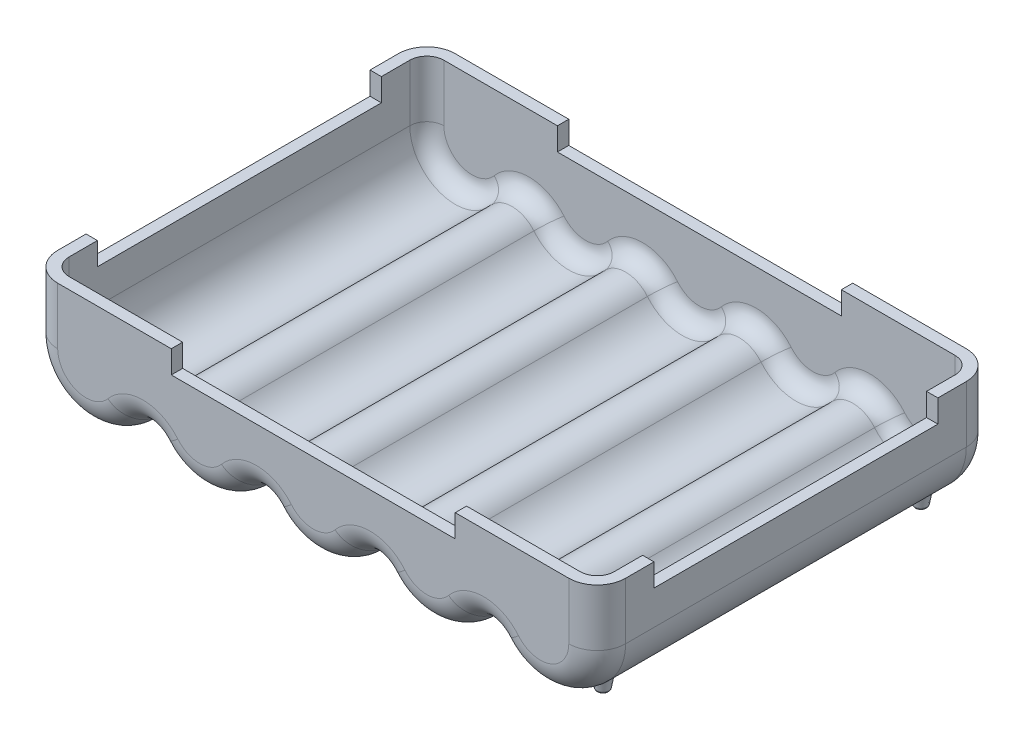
ISO-10303-21;
HEADER;
FILE_DESCRIPTION(('STEP AP214'),'2;1');
FILE_NAME('part.step','',(''),(''),'','','');
FILE_SCHEMA(('AUTOMOTIVE_DESIGN { 1 0 10303 214 1 1 1 1 }'));
ENDSEC;
DATA;
#1=APPLICATION_CONTEXT('core data for automotive mechanical design processes');
#2=APPLICATION_PROTOCOL_DEFINITION('international standard','automotive_design',2000,#1);
#3=PRODUCT_CONTEXT('',#1,'mechanical');
#4=PRODUCT('Part','Part','',(#3));
#5=PRODUCT_RELATED_PRODUCT_CATEGORY('part','',(#4));
#6=PRODUCT_DEFINITION_FORMATION('','',#4);
#7=PRODUCT_DEFINITION_CONTEXT('part definition',#1,'design');
#8=PRODUCT_DEFINITION('design','',#6,#7);
#9=PRODUCT_DEFINITION_SHAPE('','',#8);
#10=(LENGTH_UNIT() NAMED_UNIT(*) SI_UNIT(.MILLI.,.METRE.));
#11=(NAMED_UNIT(*) PLANE_ANGLE_UNIT() SI_UNIT($,.RADIAN.));
#12=(NAMED_UNIT(*) SI_UNIT($,.STERADIAN.) SOLID_ANGLE_UNIT());
#13=UNCERTAINTY_MEASURE_WITH_UNIT(LENGTH_MEASURE(1.E-05),#10,'distance_accuracy_value','');
#14=(GEOMETRIC_REPRESENTATION_CONTEXT(3) GLOBAL_UNCERTAINTY_ASSIGNED_CONTEXT((#13)) GLOBAL_UNIT_ASSIGNED_CONTEXT((#10,
#11,#12)) REPRESENTATION_CONTEXT('',''));
#15=CARTESIAN_POINT('',(0.,0.,0.));
#16=DIRECTION('',(0.,0.,1.));
#17=DIRECTION('',(1.,0.,0.));
#18=AXIS2_PLACEMENT_3D('',#15,#16,#17);
#19=CARTESIAN_POINT('',(-20.,-5.,17.5));
#20=DIRECTION('',(0.,0.,-1.));
#21=DIRECTION('',(-1.,0.,0.));
#22=AXIS2_PLACEMENT_3D('',#19,#20,#21);
#23=CYLINDRICAL_SURFACE('',#22,5.);
#24=DIRECTION('',(0.,0.,-1.));
#25=VECTOR('',#24,1.);
#26=CARTESIAN_POINT('',(-25.,-5.,17.5));
#27=LINE('',#26,#25);
#28=CARTESIAN_POINT('',(-25.,-5.,15.));
#29=VERTEX_POINT('',#28);
#30=CARTESIAN_POINT('',(-25.,-5.,-15.));
#31=VERTEX_POINT('',#30);
#32=EDGE_CURVE('E774',#29,#31,#27,.T.);
#33=ORIENTED_EDGE('',*,*,#32,.T.);
#34=CARTESIAN_POINT('',(-20.,-5.,-15.));
#35=DIRECTION('',(0.,0.,-1.));
#36=DIRECTION('',(-1.,0.,0.));
#37=AXIS2_PLACEMENT_3D('',#34,#35,#36);
#38=CIRCLE('',#37,5.);
#39=CARTESIAN_POINT('',(-16.1538461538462,-8.19485533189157,-15.));
#40=VERTEX_POINT('',#39);
#41=EDGE_CURVE('E817',#31,#40,#38,.F.);
#42=ORIENTED_EDGE('',*,*,#41,.T.);
#43=DIRECTION('',(0.,0.,-1.));
#44=VECTOR('',#43,1.);
#45=CARTESIAN_POINT('',(-16.1538461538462,-8.19485533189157,17.5));
#46=LINE('',#45,#44);
#47=CARTESIAN_POINT('',(-16.1538461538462,-8.19485533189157,15.));
#48=VERTEX_POINT('',#47);
#49=EDGE_CURVE('E771',#48,#40,#46,.T.);
#50=ORIENTED_EDGE('',*,*,#49,.F.);
#51=CARTESIAN_POINT('',(-20.,-5.,15.));
#52=DIRECTION('',(0.,0.,-1.));
#53=DIRECTION('',(-1.,0.,0.));
#54=AXIS2_PLACEMENT_3D('',#51,#52,#53);
#55=CIRCLE('',#54,5.);
#56=EDGE_CURVE('E815',#48,#29,#55,.T.);
#57=ORIENTED_EDGE('',*,*,#56,.T.);
#58=EDGE_LOOP('',(#33,#42,#50,#57));
#59=FACE_BOUND('',#58,.T.);
#60=CARTESIAN_POINT('',(-22.5245249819,-9.31587460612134,13.5232805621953));
#61=CARTESIAN_POINT('',(-22.4901331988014,-9.33599054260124,13.4907156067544));
#62=CARTESIAN_POINT('',(-22.4526455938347,-9.35735989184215,13.4620971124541));
#63=CARTESIAN_POINT('',(-22.3730543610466,-9.40121419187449,13.4132388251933));
#64=CARTESIAN_POINT('',(-22.3309385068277,-9.42370200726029,13.3930219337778));
#65=CARTESIAN_POINT('',(-22.2482383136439,-9.46624553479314,13.3631429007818));
#66=CARTESIAN_POINT('',(-22.2079786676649,-9.48630198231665,13.3525775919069));
#67=CARTESIAN_POINT('',(-22.125944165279,-9.52575177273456,13.3388266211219));
#68=CARTESIAN_POINT('',(-22.0841709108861,-9.54514577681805,13.3356333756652));
#69=CARTESIAN_POINT('',(-21.9990285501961,-9.583243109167,13.3369554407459));
#70=CARTESIAN_POINT('',(-21.9556470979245,-9.60191290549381,13.3416845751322));
#71=CARTESIAN_POINT('',(-21.8698501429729,-9.63743614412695,13.3595357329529));
#72=CARTESIAN_POINT('',(-21.827434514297,-9.65428982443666,13.3726566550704));
#73=CARTESIAN_POINT('',(-21.7482056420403,-9.68459698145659,13.4060666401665));
#74=CARTESIAN_POINT('',(-21.7112086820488,-9.69820744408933,13.4257758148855));
#75=CARTESIAN_POINT('',(-21.6410101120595,-9.72318465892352,13.472152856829));
#76=CARTESIAN_POINT('',(-21.6078059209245,-9.73455294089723,13.4988159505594));
#77=CARTESIAN_POINT('',(-21.5495619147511,-9.75391566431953,13.5556318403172));
#78=CARTESIAN_POINT('',(-21.5240494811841,-9.76212587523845,13.5852272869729));
#79=CARTESIAN_POINT('',(-21.4784451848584,-9.77648124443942,13.6487768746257));
#80=CARTESIAN_POINT('',(-21.4583509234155,-9.78262731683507,13.6827290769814));
#81=CARTESIAN_POINT('',(-21.4256288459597,-9.79247905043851,13.7514745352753));
#82=CARTESIAN_POINT('',(-21.412582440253,-9.79632352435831,13.7860492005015));
#83=CARTESIAN_POINT('',(-21.3924626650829,-9.80220354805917,13.8570406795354));
#84=CARTESIAN_POINT('',(-21.3853878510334,-9.80423953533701,13.8934570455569));
#85=CARTESIAN_POINT('',(-21.3776345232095,-9.80646841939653,13.9656971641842));
#86=CARTESIAN_POINT('',(-21.3767364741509,-9.80672457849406,14.0014955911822));
#87=CARTESIAN_POINT('',(-21.3807874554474,-9.80556244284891,14.0727303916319));
#88=CARTESIAN_POINT('',(-21.3857359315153,-9.80414430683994,14.108166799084));
#89=CARTESIAN_POINT('',(-21.4012247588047,-9.79964922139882,14.1773545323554));
#90=CARTESIAN_POINT('',(-21.4117157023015,-9.79658692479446,14.2111179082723));
#91=CARTESIAN_POINT('',(-21.437875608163,-9.78880974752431,14.2763674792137));
#92=CARTESIAN_POINT('',(-21.4535446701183,-9.78409483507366,14.3078536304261));
#93=CARTESIAN_POINT('',(-21.4897698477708,-9.77293920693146,14.3681791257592));
#94=CARTESIAN_POINT('',(-21.5103941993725,-9.7664742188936,14.3969729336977));
#95=CARTESIAN_POINT('',(-21.555682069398,-9.75188574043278,14.4506979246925));
#96=CARTESIAN_POINT('',(-21.5803461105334,-9.74376203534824,14.4756286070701));
#97=CARTESIAN_POINT('',(-21.633946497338,-9.72557395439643,14.5220211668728));
#98=CARTESIAN_POINT('',(-21.6630130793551,-9.71544561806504,14.5433072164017));
#99=CARTESIAN_POINT('',(-21.7237014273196,-9.69360135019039,14.5808069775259));
#100=CARTESIAN_POINT('',(-21.7553238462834,-9.68188501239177,14.5970193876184));
#101=CARTESIAN_POINT('',(-21.8223703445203,-9.65621486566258,14.6251140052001));
#102=CARTESIAN_POINT('',(-21.8579074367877,-9.64216415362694,14.6366372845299));
#103=CARTESIAN_POINT('',(-21.9298424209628,-9.61272379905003,14.653733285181));
#104=CARTESIAN_POINT('',(-21.9662406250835,-9.59733366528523,14.659303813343));
#105=CARTESIAN_POINT('',(-22.0421669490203,-9.56414439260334,14.6648542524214));
#106=CARTESIAN_POINT('',(-22.0816928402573,-9.54625207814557,14.6643076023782));
#107=CARTESIAN_POINT('',(-22.1597328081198,-9.50970223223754,14.6565983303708));
#108=CARTESIAN_POINT('',(-22.1982464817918,-9.49104440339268,14.6494331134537));
#109=CARTESIAN_POINT('',(-22.2763629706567,-9.45199092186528,14.6279478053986));
#110=CARTESIAN_POINT('',(-22.3158135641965,-9.43157391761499,14.6131097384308));
#111=CARTESIAN_POINT('',(-22.3915598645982,-9.39116009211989,14.5763572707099));
#112=CARTESIAN_POINT('',(-22.4278530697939,-9.37116361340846,14.5544373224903));
#113=CARTESIAN_POINT('',(-22.4966399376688,-9.33224772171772,14.5034847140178));
#114=CARTESIAN_POINT('',(-22.5290786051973,-9.31334551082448,14.4743640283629));
#115=CARTESIAN_POINT('',(-22.5882628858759,-9.2780930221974,14.4095489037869));
#116=CARTESIAN_POINT('',(-22.6150196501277,-9.26173776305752,14.3738676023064));
#117=CARTESIAN_POINT('',(-22.6547147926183,-9.23708308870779,14.307667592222));
#118=CARTESIAN_POINT('',(-22.6694193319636,-9.22781511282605,14.2785624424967));
#119=CARTESIAN_POINT('',(-22.6944946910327,-9.21187838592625,14.217873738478));
#120=CARTESIAN_POINT('',(-22.7048692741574,-9.20520737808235,14.1862923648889));
#121=CARTESIAN_POINT('',(-22.7207607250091,-9.19494375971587,14.1212433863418));
#122=CARTESIAN_POINT('',(-22.7262506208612,-9.19136824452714,14.0877663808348));
#123=CARTESIAN_POINT('',(-22.7319027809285,-9.18768668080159,14.0201770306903));
#124=CARTESIAN_POINT('',(-22.732066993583,-9.1875793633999,13.9860649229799));
#125=CARTESIAN_POINT('',(-22.7272938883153,-9.1906889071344,13.9215025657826));
#126=CARTESIAN_POINT('',(-22.722819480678,-9.19360413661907,13.8910015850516));
#127=CARTESIAN_POINT('',(-22.7097215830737,-9.20207913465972,13.831286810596));
#128=CARTESIAN_POINT('',(-22.7010968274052,-9.2076397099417,13.8020734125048));
#129=CARTESIAN_POINT('',(-22.6798306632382,-9.22121664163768,13.74482497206));
#130=CARTESIAN_POINT('',(-22.6670866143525,-9.229295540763,13.7168434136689));
#131=CARTESIAN_POINT('',(-22.6381865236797,-9.24738287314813,13.6634116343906));
#132=CARTESIAN_POINT('',(-22.6220319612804,-9.25739046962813,13.6379603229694));
#133=CARTESIAN_POINT('',(-22.5923770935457,-9.27548597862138,13.597460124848));
#134=CARTESIAN_POINT('',(-22.579645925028,-9.2831842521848,13.5816615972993));
#135=CARTESIAN_POINT('',(-22.5529682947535,-9.29913893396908,13.5514350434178));
#136=CARTESIAN_POINT('',(-22.5390216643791,-9.30739541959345,13.5370072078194));
#137=CARTESIAN_POINT('',(-22.5245249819,-9.31587460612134,13.5232805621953));
#138=B_SPLINE_CURVE_WITH_KNOTS('',3,(#60,#61,#62,#63,#64,#65,#66,#67,#68,#69,#70,#71,#72,#73,
#74,#75,#76,#77,#78,#79,#80,#81,#82,#83,#84,#85,#86,#87,#88,#89,#90,#91,#92,#93,#94,#95,#96,#97,
#98,#99,#100,#101,#102,#103,#104,#105,#106,#107,#108,#109,#110,#111,#112,#113,#114,#115,#116,
#117,#118,#119,#120,#121,#122,#123,#124,#125,#126,#127,#128,#129,#130,#131,#132,#133,#134,#135,
#136,#137),.UNSPECIFIED.,.T.,.F.,(4,2,2,2,2,2,2,2,2,2,2,2,2,2,2,2,2,2,2,2,2,2,2,2,2,2,2,2,2,2,2,
2,2,2,2,2,2,2,4),(0.,0.15427419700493,0.308966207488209,0.44697486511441,0.58484149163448,
0.726489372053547,0.868118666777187,0.99961694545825,1.13102519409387,1.25017831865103,
1.36927860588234,1.48018445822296,1.59106347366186,1.69798026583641,1.80488692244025,
1.91085626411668,2.01682764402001,2.1243515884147,2.23188945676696,2.34367333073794,
2.45548585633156,2.57472140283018,2.69400086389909,2.82362151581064,2.95329300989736,
3.09315386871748,3.23312455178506,3.37489912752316,3.51639283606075,3.61768524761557,
3.71888943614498,3.82064903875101,3.92237141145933,4.01483642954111,4.1073296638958,
4.20233267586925,4.29729456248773,4.36231455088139,4.42734357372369),.UNSPECIFIED.);
#139=CARTESIAN_POINT('',(-22.5245249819,-9.31587460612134,13.5232805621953));
#140=VERTEX_POINT('',#139);
#141=EDGE_CURVE('E951',#140,#140,#138,.T.);
#142=ORIENTED_EDGE('',*,*,#141,.F.);
#143=EDGE_LOOP('',(#142));
#144=FACE_BOUND('',#143,.T.);
#145=CARTESIAN_POINT('',(-22.522981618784,-9.31677700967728,-14.4781762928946));
#146=CARTESIAN_POINT('',(-22.4885081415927,-9.33692418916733,-14.5106134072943));
#147=CARTESIAN_POINT('',(-22.4509534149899,-9.35831249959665,-14.539102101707));
#148=CARTESIAN_POINT('',(-22.3712514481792,-9.40218636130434,-14.5876995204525));
#149=CARTESIAN_POINT('',(-22.3290921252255,-9.42467470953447,-14.6077854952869));
#150=CARTESIAN_POINT('',(-22.2462877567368,-9.46722756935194,-14.6374307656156));
#151=CARTESIAN_POINT('',(-22.2059625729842,-9.48729421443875,-14.6478857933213));
#152=CARTESIAN_POINT('',(-22.1238118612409,-9.52675334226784,-14.6613990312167));
#153=CARTESIAN_POINT('',(-22.0819879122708,-9.54614649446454,-14.6644648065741));
#154=CARTESIAN_POINT('',(-21.9968118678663,-9.58420912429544,-14.6628673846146));
#155=CARTESIAN_POINT('',(-21.9534485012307,-9.60284618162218,-14.6579989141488));
#156=CARTESIAN_POINT('',(-21.8677136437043,-9.63829659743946,-14.6398716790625));
#157=CARTESIAN_POINT('',(-21.8253420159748,-9.65511020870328,-14.6266140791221));
#158=CARTESIAN_POINT('',(-21.7462442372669,-9.68532773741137,-14.5929566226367));
#159=CARTESIAN_POINT('',(-21.7093312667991,-9.69888999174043,-14.5731397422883));
#160=CARTESIAN_POINT('',(-21.6393202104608,-9.72377063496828,-14.5265670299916));
#161=CARTESIAN_POINT('',(-21.6062195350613,-9.73509055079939,-14.4998159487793));
#162=CARTESIAN_POINT('',(-21.5481851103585,-9.75436356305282,-14.4428537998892));
#163=CARTESIAN_POINT('',(-21.5227777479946,-9.7625321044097,-14.4131974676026));
#164=CARTESIAN_POINT('',(-21.4773920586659,-9.77680650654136,-14.3495486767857));
#165=CARTESIAN_POINT('',(-21.4574113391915,-9.78291327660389,-14.315558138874));
#166=CARTESIAN_POINT('',(-21.4249064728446,-9.7926935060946,-14.2467517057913));
#167=CARTESIAN_POINT('',(-21.4119652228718,-9.79650502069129,-14.2121519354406));
#168=CARTESIAN_POINT('',(-21.3920572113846,-9.80232085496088,-14.1411302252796));
#169=CARTESIAN_POINT('',(-21.3850890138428,-9.80432560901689,-14.104708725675));
#170=CARTESIAN_POINT('',(-21.3775411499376,-9.8064950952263,-14.0324683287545));
#171=CARTESIAN_POINT('',(-21.3767436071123,-9.80672258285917,-13.9966738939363));
#172=CARTESIAN_POINT('',(-21.380992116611,-9.80550367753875,-13.9254645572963));
#173=CARTESIAN_POINT('',(-21.3860376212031,-9.80405744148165,-13.8900496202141));
#174=CARTESIAN_POINT('',(-21.4017142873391,-9.79950644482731,-13.820913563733));
#175=CARTESIAN_POINT('',(-21.4122972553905,-9.79641599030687,-13.7871805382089));
#176=CARTESIAN_POINT('',(-21.4386333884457,-9.78858241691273,-13.722006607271));
#177=CARTESIAN_POINT('',(-21.4543866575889,-9.7838392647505,-13.6905657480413));
#178=CARTESIAN_POINT('',(-21.490774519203,-9.77262585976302,-13.6303383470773));
#179=CARTESIAN_POINT('',(-21.511478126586,-9.76613100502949,-13.6015981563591));
#180=CARTESIAN_POINT('',(-21.5569131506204,-9.7514829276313,-13.5479922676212));
#181=CARTESIAN_POINT('',(-21.5816450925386,-9.74332948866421,-13.523127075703));
#182=CARTESIAN_POINT('',(-21.6353767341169,-9.72507965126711,-13.4768721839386));
#183=CARTESIAN_POINT('',(-21.6645069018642,-9.71491895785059,-13.4556596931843));
#184=CARTESIAN_POINT('',(-21.7253087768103,-9.69301118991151,-13.4183157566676));
#185=CARTESIAN_POINT('',(-21.7569811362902,-9.68126370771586,-13.4021856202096));
#186=CARTESIAN_POINT('',(-21.8241236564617,-9.65552875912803,-13.3742640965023));
#187=CARTESIAN_POINT('',(-21.8597062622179,-9.64144421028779,-13.3628332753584));
#188=CARTESIAN_POINT('',(-21.9317171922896,-9.61193939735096,-13.3459285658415));
#189=CARTESIAN_POINT('',(-21.9681458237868,-9.59651864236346,-13.3404568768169));
#190=CARTESIAN_POINT('',(-22.0441237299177,-9.56326872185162,-13.3351170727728));
#191=CARTESIAN_POINT('',(-22.0836694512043,-9.54534668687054,-13.3357764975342));
#192=CARTESIAN_POINT('',(-22.1617322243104,-9.50874435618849,-13.34371629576));
#193=CARTESIAN_POINT('',(-22.2002488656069,-9.49006376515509,-13.3509992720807));
#194=CARTESIAN_POINT('',(-22.2783432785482,-9.45097772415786,-13.3727311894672));
#195=CARTESIAN_POINT('',(-22.3177679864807,-9.43055174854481,-13.3876965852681));
#196=CARTESIAN_POINT('',(-22.3934424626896,-9.39013394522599,-13.4247056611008));
#197=CARTESIAN_POINT('',(-22.4296897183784,-9.37014247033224,-13.4467548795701));
#198=CARTESIAN_POINT('',(-22.4983303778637,-9.33127225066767,-13.4979468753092));
#199=CARTESIAN_POINT('',(-22.5306722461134,-9.31240976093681,-13.5271716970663));
#200=CARTESIAN_POINT('',(-22.5896428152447,-9.27725691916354,-13.592181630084));
#201=CARTESIAN_POINT('',(-22.6162828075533,-9.26096150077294,-13.6279535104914));
#202=CARTESIAN_POINT('',(-22.655740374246,-9.23643976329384,-13.6942595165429));
#203=CARTESIAN_POINT('',(-22.6703336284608,-9.22723723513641,-13.7233822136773));
#204=CARTESIAN_POINT('',(-22.6951860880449,-9.21143553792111,-13.7840847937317));
#205=CARTESIAN_POINT('',(-22.705449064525,-9.20483410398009,-13.8156625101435));
#206=CARTESIAN_POINT('',(-22.7211211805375,-9.19470965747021,-13.8806783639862));
#207=CARTESIAN_POINT('',(-22.7265036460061,-9.1912035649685,-13.9141256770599));
#208=CARTESIAN_POINT('',(-22.7319540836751,-9.18765311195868,-13.9816323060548));
#209=CARTESIAN_POINT('',(-22.7320239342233,-9.1876075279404,-14.0156914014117));
#210=CARTESIAN_POINT('',(-22.7270869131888,-9.19082366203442,-14.080169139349));
#211=CARTESIAN_POINT('',(-22.7225364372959,-9.19378805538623,-14.1106395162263));
#212=CARTESIAN_POINT('',(-22.709296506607,-9.2023533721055,-14.1702809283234));
#213=CARTESIAN_POINT('',(-22.7006057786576,-9.20795510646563,-14.1994515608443));
#214=CARTESIAN_POINT('',(-22.6792036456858,-9.22161490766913,-14.2566428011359));
#215=CARTESIAN_POINT('',(-22.6663848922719,-9.22973831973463,-14.2846070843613));
#216=CARTESIAN_POINT('',(-22.6373390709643,-9.24790947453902,-14.3379936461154));
#217=CARTESIAN_POINT('',(-22.6211134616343,-9.25795639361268,-14.3634170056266));
#218=CARTESIAN_POINT('',(-22.591302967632,-9.27613740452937,-14.4039163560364));
#219=CARTESIAN_POINT('',(-22.5784817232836,-9.28388558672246,-14.4197399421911));
#220=CARTESIAN_POINT('',(-22.5516183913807,-9.29994064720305,-14.4500038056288));
#221=CARTESIAN_POINT('',(-22.5375761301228,-9.30824760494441,-14.4644438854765));
#222=CARTESIAN_POINT('',(-22.522981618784,-9.31677700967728,-14.4781762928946));
#223=B_SPLINE_CURVE_WITH_KNOTS('',3,(#145,#146,#147,#148,#149,#150,#151,#152,#153,#154,#155,
#156,#157,#158,#159,#160,#161,#162,#163,#164,#165,#166,#167,#168,#169,#170,#171,#172,#173,#174,
#175,#176,#177,#178,#179,#180,#181,#182,#183,#184,#185,#186,#187,#188,#189,#190,#191,#192,#193,
#194,#195,#196,#197,#198,#199,#200,#201,#202,#203,#204,#205,#206,#207,#208,#209,#210,#211,#212,
#213,#214,#215,#216,#217,#218,#219,#220,#221,#222),.UNSPECIFIED.,.T.,.F.,(4,2,2,2,2,2,2,2,2,2,2,
2,2,2,2,2,2,2,2,2,2,2,2,2,2,2,2,2,2,2,2,2,2,2,2,2,2,2,4),(0.,0.154232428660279,
0.308879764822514,0.446996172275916,0.584971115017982,0.726572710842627,0.868154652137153,
0.999542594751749,1.13084075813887,1.24990351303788,1.36891368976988,1.47976959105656,
1.59059883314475,1.69749617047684,1.80438348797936,1.9103556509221,2.01632994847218,
2.12387799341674,2.23144007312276,2.34327320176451,2.45513511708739,2.57444805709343,
2.69380501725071,2.82352078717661,2.95328755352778,3.09321529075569,3.23325269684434,
3.37497261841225,3.51640924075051,3.61754933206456,3.71860116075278,3.82020200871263,
3.92176693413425,4.01418988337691,4.10664127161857,4.20172275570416,4.29676361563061,
4.36204934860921,4.42734438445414),.UNSPECIFIED.);
#224=CARTESIAN_POINT('',(-22.522981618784,-9.31677700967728,-14.4781762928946));
#225=VERTEX_POINT('',#224);
#226=EDGE_CURVE('E1174',#225,#225,#223,.T.);
#227=ORIENTED_EDGE('',*,*,#226,.F.);
#228=EDGE_LOOP('',(#227));
#229=FACE_BOUND('',#228,.T.);
#230=ADVANCED_FACE('F38',(#59,#144,#229),#23,.T.);
#231=CARTESIAN_POINT('',(20.,-5.,17.5));
#232=DIRECTION('',(0.,0.,-1.));
#233=DIRECTION('',(-1.,0.,0.));
#234=AXIS2_PLACEMENT_3D('',#231,#232,#233);
#235=CYLINDRICAL_SURFACE('',#234,5.);
#236=DIRECTION('',(0.,0.,-1.));
#237=VECTOR('',#236,1.);
#238=CARTESIAN_POINT('',(16.1538461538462,-8.19485533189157,17.5));
#239=LINE('',#238,#237);
#240=CARTESIAN_POINT('',(16.1538461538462,-8.19485533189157,15.));
#241=VERTEX_POINT('',#240);
#242=CARTESIAN_POINT('',(16.1538461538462,-8.19485533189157,-15.));
#243=VERTEX_POINT('',#242);
#244=EDGE_CURVE('E750',#241,#243,#239,.T.);
#245=ORIENTED_EDGE('',*,*,#244,.T.);
#246=CARTESIAN_POINT('',(20.,-5.,-15.));
#247=DIRECTION('',(0.,0.,-1.));
#248=DIRECTION('',(-1.,0.,0.));
#249=AXIS2_PLACEMENT_3D('',#246,#247,#248);
#250=CIRCLE('',#249,5.);
#251=CARTESIAN_POINT('',(25.,-4.99999999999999,-15.));
#252=VERTEX_POINT('',#251);
#253=EDGE_CURVE('E838',#243,#252,#250,.F.);
#254=ORIENTED_EDGE('',*,*,#253,.T.);
#255=DIRECTION('',(0.,0.,-1.));
#256=VECTOR('',#255,1.);
#257=CARTESIAN_POINT('',(25.,-4.99999999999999,17.5));
#258=LINE('',#257,#256);
#259=CARTESIAN_POINT('',(25.,-4.99999999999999,15.));
#260=VERTEX_POINT('',#259);
#261=EDGE_CURVE('E747',#260,#252,#258,.T.);
#262=ORIENTED_EDGE('',*,*,#261,.F.);
#263=CARTESIAN_POINT('',(20.,-5.,15.));
#264=DIRECTION('',(0.,0.,-1.));
#265=DIRECTION('',(-1.,0.,0.));
#266=AXIS2_PLACEMENT_3D('',#263,#264,#265);
#267=CIRCLE('',#266,5.);
#268=EDGE_CURVE('E836',#260,#241,#267,.T.);
#269=ORIENTED_EDGE('',*,*,#268,.T.);
#270=EDGE_LOOP('',(#245,#254,#262,#269));
#271=FACE_BOUND('',#270,.T.);
#272=CARTESIAN_POINT('',(21.5669156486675,-9.74813388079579,13.5389271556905));
#273=CARTESIAN_POINT('',(21.5983361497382,-9.73776424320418,13.5069115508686));
#274=CARTESIAN_POINT('',(21.6328165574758,-9.72603652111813,13.478255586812));
#275=CARTESIAN_POINT('',(21.7061079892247,-9.70007523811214,13.428568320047));
#276=CARTESIAN_POINT('',(21.7449278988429,-9.68583649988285,13.4075530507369));
#277=CARTESIAN_POINT('',(21.8192350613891,-9.65743811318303,13.3760284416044));
#278=CARTESIAN_POINT('',(21.8543807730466,-9.64357074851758,13.3644328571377));
#279=CARTESIAN_POINT('',(21.9255174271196,-9.61452676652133,13.347086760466));
#280=CARTESIAN_POINT('',(21.9615077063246,-9.59935115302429,13.3413318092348));
#281=CARTESIAN_POINT('',(22.0369790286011,-9.56646129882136,13.3352477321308));
#282=CARTESIAN_POINT('',(22.0764614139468,-9.54864344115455,13.3354964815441));
#283=CARTESIAN_POINT('',(22.1544682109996,-9.51221934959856,13.3426008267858));
#284=CARTESIAN_POINT('',(22.1929919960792,-9.49361262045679,13.3494606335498));
#285=CARTESIAN_POINT('',(22.2711808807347,-9.45463699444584,13.3703070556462));
#286=CARTESIAN_POINT('',(22.3106969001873,-9.43424472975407,13.3848124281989));
#287=CARTESIAN_POINT('',(22.386625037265,-9.3938449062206,13.4208935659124));
#288=CARTESIAN_POINT('',(22.4230347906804,-9.3738376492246,13.442474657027));
#289=CARTESIAN_POINT('',(22.4921974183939,-9.33480706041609,13.4927979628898));
#290=CARTESIAN_POINT('',(22.5248864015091,-9.31580327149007,13.5216438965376));
#291=CARTESIAN_POINT('',(22.5846242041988,-9.28029476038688,13.5859436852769));
#292=CARTESIAN_POINT('',(22.6116838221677,-9.26378527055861,13.6213846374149));
#293=CARTESIAN_POINT('',(22.6519992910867,-9.23878479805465,13.6873025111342));
#294=CARTESIAN_POINT('',(22.6669959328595,-9.22934548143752,13.7163610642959));
#295=CARTESIAN_POINT('',(22.6926563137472,-9.21305511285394,13.7770121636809));
#296=CARTESIAN_POINT('',(22.7033238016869,-9.20620182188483,13.8086024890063));
#297=CARTESIAN_POINT('',(22.7197908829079,-9.19557341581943,13.8737365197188));
#298=CARTESIAN_POINT('',(22.7255628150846,-9.19181579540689,13.9072901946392));
#299=CARTESIAN_POINT('',(22.7317449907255,-9.18778989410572,13.9750956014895));
#300=CARTESIAN_POINT('',(22.732157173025,-9.18752035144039,14.0093470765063));
#301=CARTESIAN_POINT('',(22.7278134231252,-9.1903505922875,14.0741353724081));
#302=CARTESIAN_POINT('',(22.7235371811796,-9.19313765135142,14.1047200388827));
#303=CARTESIAN_POINT('',(22.7108097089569,-9.20137685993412,14.1646275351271));
#304=CARTESIAN_POINT('',(22.7023580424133,-9.20682928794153,14.1939502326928));
#305=CARTESIAN_POINT('',(22.6814503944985,-9.22018719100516,14.2513349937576));
#306=CARTESIAN_POINT('',(22.6689054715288,-9.22814700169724,14.2793515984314));
#307=CARTESIAN_POINT('',(22.6403895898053,-9.24601289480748,14.3328997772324));
#308=CARTESIAN_POINT('',(22.624417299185,-9.2559197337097,14.3584303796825));
#309=CARTESIAN_POINT('',(22.5871224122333,-9.27870746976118,14.4100657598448));
#310=CARTESIAN_POINT('',(22.565364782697,-9.29181033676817,14.4357574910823));
#311=CARTESIAN_POINT('',(22.5187132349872,-9.31935396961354,14.4832802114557));
#312=CARTESIAN_POINT('',(22.4938173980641,-9.33379555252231,14.5051088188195));
#313=CARTESIAN_POINT('',(22.4370209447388,-9.36602388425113,14.5480941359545));
#314=CARTESIAN_POINT('',(22.4046476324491,-9.3839634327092,14.5685134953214));
#315=CARTESIAN_POINT('',(22.3371696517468,-9.42030648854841,14.603637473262));
#316=CARTESIAN_POINT('',(22.3020633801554,-9.43871026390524,14.6183387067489));
#317=CARTESIAN_POINT('',(22.2258222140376,-9.47747006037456,14.6431005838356));
#318=CARTESIAN_POINT('',(22.1844516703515,-9.49781484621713,14.6524606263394));
#319=CARTESIAN_POINT('',(22.1003107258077,-9.53771564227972,14.6634700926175));
#320=CARTESIAN_POINT('',(22.0575400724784,-9.55727150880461,14.6651181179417));
#321=CARTESIAN_POINT('',(21.9716472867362,-9.59508606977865,14.6603497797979));
#322=CARTESIAN_POINT('',(21.9285244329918,-9.61333929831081,14.6539013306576));
#323=CARTESIAN_POINT('',(21.8435786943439,-9.64793696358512,14.632653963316));
#324=CARTESIAN_POINT('',(21.8017551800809,-9.66428233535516,14.6178591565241));
#325=CARTESIAN_POINT('',(21.7242213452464,-9.69346845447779,14.5814370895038));
#326=CARTESIAN_POINT('',(21.6882882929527,-9.70648218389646,14.5604239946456));
#327=CARTESIAN_POINT('',(21.6204506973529,-9.7302675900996,14.5116878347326));
#328=CARTESIAN_POINT('',(21.588543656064,-9.74104065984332,14.4839689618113));
#329=CARTESIAN_POINT('',(21.5329106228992,-9.75930303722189,14.4254018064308));
#330=CARTESIAN_POINT('',(21.5087016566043,-9.76700348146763,14.395077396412));
#331=CARTESIAN_POINT('',(21.4658038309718,-9.78036878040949,14.3303482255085));
#332=CARTESIAN_POINT('',(21.4471126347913,-9.78603449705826,14.2959452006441));
#333=CARTESIAN_POINT('',(21.4170739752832,-9.79501116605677,14.2264858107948));
#334=CARTESIAN_POINT('',(21.4053269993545,-9.79845161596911,14.1916184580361));
#335=CARTESIAN_POINT('',(21.3878212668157,-9.80354415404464,14.1202882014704));
#336=CARTESIAN_POINT('',(21.3820609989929,-9.80519669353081,14.0838257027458));
#337=CARTESIAN_POINT('',(21.3768420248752,-9.80669459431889,14.011618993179));
#338=CARTESIAN_POINT('',(21.3771835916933,-9.80659723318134,13.9758902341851));
#339=CARTESIAN_POINT('',(21.3836679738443,-9.80473454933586,13.9050015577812));
#340=CARTESIAN_POINT('',(21.3898114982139,-9.80296902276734,13.8698417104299));
#341=CARTESIAN_POINT('',(21.407616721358,-9.79778070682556,13.8013029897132));
#342=CARTESIAN_POINT('',(21.41924609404,-9.79436762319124,13.7679149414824));
#343=CARTESIAN_POINT('',(21.4475813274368,-9.78588814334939,13.7036268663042));
#344=CARTESIAN_POINT('',(21.4642820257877,-9.78082342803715,13.6727243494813));
#345=CARTESIAN_POINT('',(21.4954265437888,-9.77114892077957,13.6245740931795));
#346=CARTESIAN_POINT('',(21.5085689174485,-9.76701523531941,13.6063716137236));
#347=CARTESIAN_POINT('',(21.5365287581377,-9.75807689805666,13.5714799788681));
#348=CARTESIAN_POINT('',(21.5513465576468,-9.75327211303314,13.5547911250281));
#349=CARTESIAN_POINT('',(21.5669156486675,-9.74813388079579,13.5389271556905));
#350=B_SPLINE_CURVE_WITH_KNOTS('',3,(#272,#273,#274,#275,#276,#277,#278,#279,#280,#281,#282,
#283,#284,#285,#286,#287,#288,#289,#290,#291,#292,#293,#294,#295,#296,#297,#298,#299,#300,#301,
#302,#303,#304,#305,#306,#307,#308,#309,#310,#311,#312,#313,#314,#315,#316,#317,#318,#319,#320,
#321,#322,#323,#324,#325,#326,#327,#328,#329,#330,#331,#332,#333,#334,#335,#336,#337,#338,#339,
#340,#341,#342,#343,#344,#345,#346,#347,#348,#349),.UNSPECIFIED.,.T.,.F.,(4,2,2,2,2,2,2,2,2,2,2,
2,2,2,2,2,2,2,2,2,2,2,2,2,2,2,2,2,2,2,2,2,2,2,2,2,2,2,4),(0.,0.138006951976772,
0.276301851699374,0.394394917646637,0.512398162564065,0.64180120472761,0.771286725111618,
0.910970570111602,1.05075979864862,1.19267072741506,1.334306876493,1.436003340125,
1.53761155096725,1.63979011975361,1.74193172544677,1.83452158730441,1.92712112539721,
2.02188411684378,2.11668399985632,2.22465496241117,2.33269226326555,2.45899260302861,
2.58536759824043,2.72583988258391,2.8663376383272,3.00739393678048,3.14838081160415,
3.27850631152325,3.40855067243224,3.52660956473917,3.6446183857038,3.75492922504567,
3.86521221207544,3.97189219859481,4.07858522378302,4.18465725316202,4.29062166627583,
4.35899154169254,4.42737500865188),.UNSPECIFIED.);
#351=CARTESIAN_POINT('',(21.5669156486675,-9.74813388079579,13.5389271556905));
#352=VERTEX_POINT('',#351);
#353=EDGE_CURVE('E958',#352,#352,#350,.T.);
#354=ORIENTED_EDGE('',*,*,#353,.F.);
#355=EDGE_LOOP('',(#354));
#356=FACE_BOUND('',#355,.T.);
#357=CARTESIAN_POINT('',(21.5706541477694,-9.74689851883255,-14.4648526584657));
#358=CARTESIAN_POINT('',(21.6023195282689,-9.73642039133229,-14.4966083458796));
#359=CARTESIAN_POINT('',(21.637012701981,-9.72458633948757,-14.5249810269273));
#360=CARTESIAN_POINT('',(21.7106613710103,-9.6984215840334,-14.574075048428));
#361=CARTESIAN_POINT('',(21.7496256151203,-9.68408571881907,-14.5947802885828));
#362=CARTESIAN_POINT('',(21.8241928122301,-9.65549989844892,-14.62574330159));
#363=CARTESIAN_POINT('',(21.8594657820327,-9.64153794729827,-14.6370795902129));
#364=CARTESIAN_POINT('',(21.9308149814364,-9.61231377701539,-14.6538898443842));
#365=CARTESIAN_POINT('',(21.9668905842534,-9.59705254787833,-14.6593682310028));
#366=CARTESIAN_POINT('',(22.0425088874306,-9.56399161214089,-14.6648605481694));
#367=CARTESIAN_POINT('',(22.0820488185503,-9.54608922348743,-14.6642935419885));
#368=CARTESIAN_POINT('',(22.1601230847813,-9.50951553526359,-14.6565384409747));
#369=CARTESIAN_POINT('',(22.1986567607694,-9.49084375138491,-14.649346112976));
#370=CARTESIAN_POINT('',(22.2767871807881,-9.45177398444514,-14.6278029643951));
#371=CARTESIAN_POINT('',(22.3162324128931,-9.43135495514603,-14.6129375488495));
#372=CARTESIAN_POINT('',(22.3919624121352,-9.39094074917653,-14.5761305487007));
#373=CARTESIAN_POINT('',(22.4282447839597,-9.37094590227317,-14.5541836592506));
#374=CARTESIAN_POINT('',(22.4969997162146,-9.33204018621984,-14.5031808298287));
#375=CARTESIAN_POINT('',(22.5294178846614,-9.31314636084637,-14.4740379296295));
#376=CARTESIAN_POINT('',(22.5885568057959,-9.27791498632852,-14.409181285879));
#377=CARTESIAN_POINT('',(22.6152887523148,-9.26157243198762,-14.3734807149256));
#378=CARTESIAN_POINT('',(22.6549333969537,-9.23694599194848,-14.3072581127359));
#379=CARTESIAN_POINT('',(22.6696142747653,-9.22769192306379,-14.2781491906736));
#380=CARTESIAN_POINT('',(22.694642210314,-9.21178391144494,-14.2174575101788));
#381=CARTESIAN_POINT('',(22.7049930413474,-9.2051277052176,-14.1858769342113));
#382=CARTESIAN_POINT('',(22.7208376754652,-9.19489378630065,-14.1208356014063));
#383=CARTESIAN_POINT('',(22.7263046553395,-9.19133307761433,-14.0873655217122));
#384=CARTESIAN_POINT('',(22.7319141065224,-9.18767927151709,-14.0197937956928));
#385=CARTESIAN_POINT('',(22.7320583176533,-9.18758504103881,-13.9856923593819));
#386=CARTESIAN_POINT('',(22.7272500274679,-9.19071746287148,-13.9211443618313));
#387=CARTESIAN_POINT('',(22.7227587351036,-9.19364360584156,-13.8906469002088));
#388=CARTESIAN_POINT('',(22.709630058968,-9.2021381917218,-13.8309482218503));
#389=CARTESIAN_POINT('',(22.700992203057,-9.20770693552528,-13.801747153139));
#390=CARTESIAN_POINT('',(22.6797019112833,-9.22129839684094,-13.7445247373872));
#391=CARTESIAN_POINT('',(22.6669470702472,-9.2293834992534,-13.7165567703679));
#392=CARTESIAN_POINT('',(22.6380217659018,-9.2474853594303,-13.663135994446));
#393=CARTESIAN_POINT('',(22.6218499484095,-9.25750288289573,-13.6376841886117));
#394=CARTESIAN_POINT('',(22.5841085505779,-9.2805299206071,-13.5861994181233));
#395=CARTESIAN_POINT('',(22.5620995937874,-9.29376210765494,-13.5605889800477));
#396=CARTESIAN_POINT('',(22.5149514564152,-9.32154709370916,-13.5132686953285));
#397=CARTESIAN_POINT('',(22.4898103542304,-9.33610070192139,-13.4915612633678));
#398=CARTESIAN_POINT('',(22.432501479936,-9.36854584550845,-13.4488891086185));
#399=CARTESIAN_POINT('',(22.3998637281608,-9.3865863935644,-13.4286669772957));
#400=CARTESIAN_POINT('',(22.3318747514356,-9.4231043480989,-13.3939891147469));
#401=CARTESIAN_POINT('',(22.2965219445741,-9.4415820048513,-13.3795367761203));
#402=CARTESIAN_POINT('',(22.219872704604,-9.48042440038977,-13.3553862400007));
#403=CARTESIAN_POINT('',(22.1783487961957,-9.50077487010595,-13.346379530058));
#404=CARTESIAN_POINT('',(22.093953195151,-9.54065398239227,-13.3361170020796));
#405=CARTESIAN_POINT('',(22.0510812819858,-9.56018248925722,-13.3348624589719));
#406=CARTESIAN_POINT('',(21.9651668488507,-9.59786047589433,-13.3404504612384));
#407=CARTESIAN_POINT('',(21.9221241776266,-9.61600808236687,-13.3473038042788));
#408=CARTESIAN_POINT('',(21.8374147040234,-9.65037564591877,-13.369346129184));
#409=CARTESIAN_POINT('',(21.7957472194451,-9.6665965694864,-13.3845309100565));
#410=CARTESIAN_POINT('',(21.718637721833,-9.6955137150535,-13.4216491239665));
#411=CARTESIAN_POINT('',(21.6829636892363,-9.70838639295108,-13.442961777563));
#412=CARTESIAN_POINT('',(21.6156975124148,-9.73189084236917,-13.4922363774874));
#413=CARTESIAN_POINT('',(21.5841028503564,-9.74252399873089,-13.5201941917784));
#414=CARTESIAN_POINT('',(21.5290933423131,-9.76052900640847,-13.5791567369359));
#415=CARTESIAN_POINT('',(21.5051937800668,-9.7681106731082,-13.6096459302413));
#416=CARTESIAN_POINT('',(21.4629366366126,-9.78124542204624,-13.6746391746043));
#417=CARTESIAN_POINT('',(21.4445767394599,-9.78679935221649,-13.7091415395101));
#418=CARTESIAN_POINT('',(21.4151717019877,-9.79557194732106,-13.7787568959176));
#419=CARTESIAN_POINT('',(21.4037317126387,-9.79891794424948,-13.8136875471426));
#420=CARTESIAN_POINT('',(21.3868424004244,-9.80382625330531,-13.8850867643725));
#421=CARTESIAN_POINT('',(21.3813915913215,-9.8053890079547,-13.9215549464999));
#422=CARTESIAN_POINT('',(21.3767695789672,-9.80671518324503,-13.9937444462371));
#423=CARTESIAN_POINT('',(21.3774033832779,-9.80653447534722,-14.0294524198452));
#424=CARTESIAN_POINT('',(21.3844605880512,-9.80450643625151,-14.1002490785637));
#425=CARTESIAN_POINT('',(21.3908847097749,-9.80265889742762,-14.1353376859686));
#426=CARTESIAN_POINT('',(21.4092331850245,-9.79730671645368,-14.2037086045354));
#427=CARTESIAN_POINT('',(21.4211286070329,-9.79381078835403,-14.2369994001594));
#428=CARTESIAN_POINT('',(21.4499714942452,-9.78516536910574,-14.3010502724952));
#429=CARTESIAN_POINT('',(21.4669138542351,-9.78001754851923,-14.3318128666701));
#430=CARTESIAN_POINT('',(21.4984418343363,-9.77020324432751,-14.3797219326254));
#431=CARTESIAN_POINT('',(21.5117371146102,-9.76601195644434,-14.3978322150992));
#432=CARTESIAN_POINT('',(21.5399912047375,-9.7569578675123,-14.4325234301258));
#433=CARTESIAN_POINT('',(21.5549503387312,-9.75209493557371,-14.4491040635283));
#434=CARTESIAN_POINT('',(21.5706541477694,-9.74689851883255,-14.4648526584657));
#435=B_SPLINE_CURVE_WITH_KNOTS('',3,(#357,#358,#359,#360,#361,#362,#363,#364,#365,#366,#367,
#368,#369,#370,#371,#372,#373,#374,#375,#376,#377,#378,#379,#380,#381,#382,#383,#384,#385,#386,
#387,#388,#389,#390,#391,#392,#393,#394,#395,#396,#397,#398,#399,#400,#401,#402,#403,#404,#405,
#406,#407,#408,#409,#410,#411,#412,#413,#414,#415,#416,#417,#418,#419,#420,#421,#422,#423,#424,
#425,#426,#427,#428,#429,#430,#431,#432,#433,#434),.UNSPECIFIED.,.T.,.F.,(4,2,2,2,2,2,2,2,2,2,2,
2,2,2,2,2,2,2,2,2,2,2,2,2,2,2,2,2,2,2,2,2,2,2,2,2,2,2,4),(0.,0.138044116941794,
0.276376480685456,0.394682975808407,0.512900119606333,0.64257234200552,0.772327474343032,
0.912203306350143,1.05218416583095,1.1939473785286,1.33542888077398,1.43668891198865,
1.53786051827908,1.6395844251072,1.74127508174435,1.83373991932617,1.92621528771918,
2.0211955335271,2.11621349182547,2.22460681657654,2.33306697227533,2.45981776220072,
2.58664297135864,2.7273174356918,2.86801503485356,3.00890021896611,3.14971442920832,
3.27951424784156,3.40923356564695,3.527041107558,3.64479932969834,3.75497573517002,
3.8651247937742,3.9717560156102,4.07840052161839,4.184487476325,4.29046748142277,
4.35891432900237,4.42737453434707),.UNSPECIFIED.);
#436=CARTESIAN_POINT('',(21.5706541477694,-9.74689851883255,-14.4648526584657));
#437=VERTEX_POINT('',#436);
#438=EDGE_CURVE('E1168',#437,#437,#435,.T.);
#439=ORIENTED_EDGE('',*,*,#438,.F.);
#440=EDGE_LOOP('',(#439));
#441=FACE_BOUND('',#440,.T.);
#442=ADVANCED_FACE('F1161',(#271,#356,#441),#235,.T.);
#443=CARTESIAN_POINT('',(-25.,0.,17.5));
#444=DIRECTION('',(0.,-1.,0.));
#445=DIRECTION('',(1.,0.,0.));
#446=AXIS2_PLACEMENT_3D('',#443,#444,#445);
#447=PLANE('',#446);
#448=DIRECTION('',(0.,0.,-1.));
#449=VECTOR('',#448,1.);
#450=CARTESIAN_POINT('',(24.,0.,17.5));
#451=LINE('',#450,#449);
#452=CARTESIAN_POINT('',(24.,0.,-12.5));
#453=VERTEX_POINT('',#452);
#454=CARTESIAN_POINT('',(24.,0.,-15.));
#455=VERTEX_POINT('',#454);
#456=EDGE_CURVE('E714',#453,#455,#451,.T.);
#457=ORIENTED_EDGE('',*,*,#456,.F.);
#458=DIRECTION('',(1.,0.,0.));
#459=VECTOR('',#458,1.);
#460=CARTESIAN_POINT('',(-25.,0.,-12.5));
#461=LINE('',#460,#459);
#462=CARTESIAN_POINT('',(25.,0.,-12.5));
#463=VERTEX_POINT('',#462);
#464=EDGE_CURVE('E479',#453,#463,#461,.T.);
#465=ORIENTED_EDGE('',*,*,#464,.T.);
#466=DIRECTION('',(0.,0.,-1.));
#467=VECTOR('',#466,1.);
#468=CARTESIAN_POINT('',(25.,0.,17.5));
#469=LINE('',#468,#467);
#470=CARTESIAN_POINT('',(25.,0.,-15.));
#471=VERTEX_POINT('',#470);
#472=EDGE_CURVE('E743',#463,#471,#469,.T.);
#473=ORIENTED_EDGE('',*,*,#472,.T.);
#474=CARTESIAN_POINT('',(22.5,0.,-15.));
#475=DIRECTION('',(0.,-1.,0.));
#476=DIRECTION('',(1.,0.,0.));
#477=AXIS2_PLACEMENT_3D('',#474,#475,#476);
#478=CIRCLE('',#477,2.5);
#479=CARTESIAN_POINT('',(22.5,0.,-17.5));
#480=VERTEX_POINT('',#479);
#481=EDGE_CURVE('E810',#471,#480,#478,.F.);
#482=ORIENTED_EDGE('',*,*,#481,.T.);
#483=DIRECTION('',(-1.,0.,0.));
#484=VECTOR('',#483,1.);
#485=CARTESIAN_POINT('',(-25.,0.,-17.5));
#486=LINE('',#485,#484);
#487=CARTESIAN_POINT('',(12.5,0.,-17.5));
#488=VERTEX_POINT('',#487);
#489=EDGE_CURVE('E738',#480,#488,#486,.T.);
#490=ORIENTED_EDGE('',*,*,#489,.T.);
#491=DIRECTION('',(0.,0.,1.));
#492=VECTOR('',#491,1.);
#493=CARTESIAN_POINT('',(12.5,0.,17.5));
#494=LINE('',#493,#492);
#495=CARTESIAN_POINT('',(12.5,0.,-16.5));
#496=VERTEX_POINT('',#495);
#497=EDGE_CURVE('E520',#488,#496,#494,.T.);
#498=ORIENTED_EDGE('',*,*,#497,.T.);
#499=DIRECTION('',(-1.,0.,0.));
#500=VECTOR('',#499,1.);
#501=CARTESIAN_POINT('',(-20.,0.,-16.5));
#502=LINE('',#501,#500);
#503=CARTESIAN_POINT('',(22.5,0.,-16.5));
#504=VERTEX_POINT('',#503);
#505=EDGE_CURVE('E728',#504,#496,#502,.T.);
#506=ORIENTED_EDGE('',*,*,#505,.F.);
#507=CARTESIAN_POINT('',(22.5,0.,-15.));
#508=DIRECTION('',(0.,-1.,0.));
#509=DIRECTION('',(1.,0.,0.));
#510=AXIS2_PLACEMENT_3D('',#507,#508,#509);
#511=CIRCLE('',#510,1.5);
#512=EDGE_CURVE('E719',#455,#504,#511,.F.);
#513=ORIENTED_EDGE('',*,*,#512,.F.);
#514=EDGE_LOOP('',(#457,#465,#473,#482,#490,#498,#506,#513));
#515=FACE_BOUND('',#514,.T.);
#516=ADVANCED_FACE('F1156',(#515),#447,.F.);
#517=DIRECTION('',(0.,0.,-1.));
#518=VECTOR('',#517,1.);
#519=CARTESIAN_POINT('',(-25.,0.,17.5));
#520=LINE('',#519,#518);
#521=CARTESIAN_POINT('',(-25.,0.,-12.5));
#522=VERTEX_POINT('',#521);
#523=CARTESIAN_POINT('',(-25.,0.,-15.));
#524=VERTEX_POINT('',#523);
#525=EDGE_CURVE('E736',#522,#524,#520,.T.);
#526=ORIENTED_EDGE('',*,*,#525,.F.);
#527=DIRECTION('',(1.,0.,0.));
#528=VECTOR('',#527,1.);
#529=CARTESIAN_POINT('',(-25.,0.,-12.5));
#530=LINE('',#529,#528);
#531=CARTESIAN_POINT('',(-24.,0.,-12.5));
#532=VERTEX_POINT('',#531);
#533=EDGE_CURVE('E484',#522,#532,#530,.T.);
#534=ORIENTED_EDGE('',*,*,#533,.T.);
#535=DIRECTION('',(0.,0.,-1.));
#536=VECTOR('',#535,1.);
#537=CARTESIAN_POINT('',(-24.,0.,17.5));
#538=LINE('',#537,#536);
#539=CARTESIAN_POINT('',(-24.,0.,-15.));
#540=VERTEX_POINT('',#539);
#541=EDGE_CURVE('E715',#532,#540,#538,.T.);
#542=ORIENTED_EDGE('',*,*,#541,.T.);
#543=CARTESIAN_POINT('',(-22.5,0.,-15.));
#544=DIRECTION('',(0.,-1.,0.));
#545=DIRECTION('',(1.,0.,0.));
#546=AXIS2_PLACEMENT_3D('',#543,#544,#545);
#547=CIRCLE('',#546,1.5);
#548=CARTESIAN_POINT('',(-22.5,0.,-16.5));
#549=VERTEX_POINT('',#548);
#550=EDGE_CURVE('E544',#549,#540,#547,.F.);
#551=ORIENTED_EDGE('',*,*,#550,.F.);
#552=CARTESIAN_POINT('',(-12.5,0.,-16.5));
#553=VERTEX_POINT('',#552);
#554=EDGE_CURVE('E611',#553,#549,#502,.T.);
#555=ORIENTED_EDGE('',*,*,#554,.F.);
#556=DIRECTION('',(0.,0.,-1.));
#557=VECTOR('',#556,1.);
#558=CARTESIAN_POINT('',(-12.5,0.,17.5));
#559=LINE('',#558,#557);
#560=CARTESIAN_POINT('',(-12.5,0.,-17.5));
#561=VERTEX_POINT('',#560);
#562=EDGE_CURVE('E507',#553,#561,#559,.T.);
#563=ORIENTED_EDGE('',*,*,#562,.T.);
#564=CARTESIAN_POINT('',(-22.5,0.,-17.5));
#565=VERTEX_POINT('',#564);
#566=EDGE_CURVE('E741',#561,#565,#486,.T.);
#567=ORIENTED_EDGE('',*,*,#566,.T.);
#568=CARTESIAN_POINT('',(-22.5,0.,-15.));
#569=DIRECTION('',(0.,-1.,0.));
#570=DIRECTION('',(1.,0.,0.));
#571=AXIS2_PLACEMENT_3D('',#568,#569,#570);
#572=CIRCLE('',#571,2.5);
#573=EDGE_CURVE('E812',#565,#524,#572,.F.);
#574=ORIENTED_EDGE('',*,*,#573,.T.);
#575=EDGE_LOOP('',(#526,#534,#542,#551,#555,#563,#567,#574));
#576=FACE_BOUND('',#575,.T.);
#577=ADVANCED_FACE('F1353',(#576),#447,.F.);
#578=CARTESIAN_POINT('',(25.,0.,15.));
#579=VERTEX_POINT('',#578);
#580=CARTESIAN_POINT('',(25.,0.,12.5));
#581=VERTEX_POINT('',#580);
#582=EDGE_CURVE('E744',#579,#581,#469,.T.);
#583=ORIENTED_EDGE('',*,*,#582,.T.);
#584=DIRECTION('',(-1.,0.,0.));
#585=VECTOR('',#584,1.);
#586=CARTESIAN_POINT('',(-25.,0.,12.5));
#587=LINE('',#586,#585);
#588=CARTESIAN_POINT('',(24.,0.,12.5));
#589=VERTEX_POINT('',#588);
#590=EDGE_CURVE('E471',#581,#589,#587,.T.);
#591=ORIENTED_EDGE('',*,*,#590,.T.);
#592=CARTESIAN_POINT('',(24.,0.,15.));
#593=VERTEX_POINT('',#592);
#594=EDGE_CURVE('E602',#593,#589,#451,.T.);
#595=ORIENTED_EDGE('',*,*,#594,.F.);
#596=CARTESIAN_POINT('',(22.5,0.,15.));
#597=DIRECTION('',(0.,-1.,0.));
#598=DIRECTION('',(1.,0.,0.));
#599=AXIS2_PLACEMENT_3D('',#596,#597,#598);
#600=CIRCLE('',#599,1.5);
#601=CARTESIAN_POINT('',(22.5,0.,16.5));
#602=VERTEX_POINT('',#601);
#603=EDGE_CURVE('E623',#602,#593,#600,.F.);
#604=ORIENTED_EDGE('',*,*,#603,.F.);
#605=DIRECTION('',(-1.,0.,0.));
#606=VECTOR('',#605,1.);
#607=CARTESIAN_POINT('',(-20.,0.,16.5));
#608=LINE('',#607,#606);
#609=CARTESIAN_POINT('',(12.5,0.,16.5));
#610=VERTEX_POINT('',#609);
#611=EDGE_CURVE('E720',#602,#610,#608,.T.);
#612=ORIENTED_EDGE('',*,*,#611,.T.);
#613=CARTESIAN_POINT('',(12.5,0.,17.5));
#614=VERTEX_POINT('',#613);
#615=EDGE_CURVE('E524',#610,#614,#494,.T.);
#616=ORIENTED_EDGE('',*,*,#615,.T.);
#617=DIRECTION('',(-1.,0.,0.));
#618=VECTOR('',#617,1.);
#619=CARTESIAN_POINT('',(-25.,0.,17.5));
#620=LINE('',#619,#618);
#621=CARTESIAN_POINT('',(22.5,0.,17.5));
#622=VERTEX_POINT('',#621);
#623=EDGE_CURVE('E733',#622,#614,#620,.T.);
#624=ORIENTED_EDGE('',*,*,#623,.F.);
#625=CARTESIAN_POINT('',(22.5,0.,15.));
#626=DIRECTION('',(0.,-1.,0.));
#627=DIRECTION('',(1.,0.,0.));
#628=AXIS2_PLACEMENT_3D('',#625,#626,#627);
#629=CIRCLE('',#628,2.5);
#630=EDGE_CURVE('E805',#622,#579,#629,.F.);
#631=ORIENTED_EDGE('',*,*,#630,.T.);
#632=EDGE_LOOP('',(#583,#591,#595,#604,#612,#616,#624,#631));
#633=FACE_BOUND('',#632,.T.);
#634=ADVANCED_FACE('F1157',(#633),#447,.F.);
#635=CARTESIAN_POINT('',(-25.,0.,17.5));
#636=DIRECTION('',(1.,0.,0.));
#637=DIRECTION('',(0.,0.,-1.));
#638=AXIS2_PLACEMENT_3D('',#635,#636,#637);
#639=PLANE('',#638);
#640=DIRECTION('',(0.,0.,-1.));
#641=VECTOR('',#640,1.);
#642=CARTESIAN_POINT('',(-25.,-1.99999999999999,12.5));
#643=LINE('',#642,#641);
#644=CARTESIAN_POINT('',(-25.,-1.99999999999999,12.5));
#645=VERTEX_POINT('',#644);
#646=CARTESIAN_POINT('',(-25.,-1.99999999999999,-12.5));
#647=VERTEX_POINT('',#646);
#648=EDGE_CURVE('E448',#645,#647,#643,.T.);
#649=ORIENTED_EDGE('',*,*,#648,.T.);
#650=DIRECTION('',(0.,1.,0.));
#651=VECTOR('',#650,1.);
#652=CARTESIAN_POINT('',(-25.,2.00000000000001,-12.5));
#653=LINE('',#652,#651);
#654=EDGE_CURVE('E460',#647,#522,#653,.T.);
#655=ORIENTED_EDGE('',*,*,#654,.T.);
#656=ORIENTED_EDGE('',*,*,#525,.T.);
#657=DIRECTION('',(0.,-1.,0.));
#658=VECTOR('',#657,1.);
#659=CARTESIAN_POINT('',(-25.,-5.,-15.));
#660=LINE('',#659,#658);
#661=EDGE_CURVE('E779',#524,#31,#660,.T.);
#662=ORIENTED_EDGE('',*,*,#661,.T.);
#663=ORIENTED_EDGE('',*,*,#32,.F.);
#664=DIRECTION('',(0.,-1.,0.));
#665=VECTOR('',#664,1.);
#666=CARTESIAN_POINT('',(-25.,0.,15.));
#667=LINE('',#666,#665);
#668=CARTESIAN_POINT('',(-25.,0.,15.));
#669=VERTEX_POINT('',#668);
#670=EDGE_CURVE('E777',#29,#669,#667,.F.);
#671=ORIENTED_EDGE('',*,*,#670,.T.);
#672=CARTESIAN_POINT('',(-25.,0.,12.5));
#673=VERTEX_POINT('',#672);
#674=EDGE_CURVE('E459',#669,#673,#520,.T.);
#675=ORIENTED_EDGE('',*,*,#674,.T.);
#676=DIRECTION('',(0.,-1.,0.));
#677=VECTOR('',#676,1.);
#678=CARTESIAN_POINT('',(-25.,2.00000000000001,12.5));
#679=LINE('',#678,#677);
#680=EDGE_CURVE('E441',#673,#645,#679,.T.);
#681=ORIENTED_EDGE('',*,*,#680,.T.);
#682=EDGE_LOOP('',(#649,#655,#656,#662,#663,#671,#675,#681));
#683=FACE_BOUND('',#682,.T.);
#684=ADVANCED_FACE('F457',(#683),#639,.F.);
#685=CARTESIAN_POINT('',(-15.,-9.15331193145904,17.5));
#686=DIRECTION('',(0.,0.,-1.));
#687=DIRECTION('',(-1.,0.,0.));
#688=AXIS2_PLACEMENT_3D('',#685,#686,#687);
#689=CYLINDRICAL_SURFACE('',#688,1.5);
#690=ORIENTED_EDGE('',*,*,#49,.T.);
#691=CARTESIAN_POINT('',(-15.,-9.15331193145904,-15.));
#692=DIRECTION('',(0.,0.,-1.));
#693=DIRECTION('',(-1.,0.,0.));
#694=AXIS2_PLACEMENT_3D('',#691,#692,#693);
#695=CIRCLE('',#694,1.5);
#696=CARTESIAN_POINT('',(-13.8461538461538,-8.19485533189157,-15.));
#697=VERTEX_POINT('',#696);
#698=EDGE_CURVE('E821',#40,#697,#695,.T.);
#699=ORIENTED_EDGE('',*,*,#698,.T.);
#700=DIRECTION('',(0.,0.,-1.));
#701=VECTOR('',#700,1.);
#702=CARTESIAN_POINT('',(-13.8461538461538,-8.19485533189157,17.5));
#703=LINE('',#702,#701);
#704=CARTESIAN_POINT('',(-13.8461538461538,-8.19485533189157,15.));
#705=VERTEX_POINT('',#704);
#706=EDGE_CURVE('E768',#705,#697,#703,.T.);
#707=ORIENTED_EDGE('',*,*,#706,.F.);
#708=CARTESIAN_POINT('',(-15.,-9.15331193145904,15.));
#709=DIRECTION('',(0.,0.,-1.));
#710=DIRECTION('',(-1.,0.,0.));
#711=AXIS2_PLACEMENT_3D('',#708,#709,#710);
#712=CIRCLE('',#711,1.5);
#713=EDGE_CURVE('E819',#705,#48,#712,.F.);
#714=ORIENTED_EDGE('',*,*,#713,.T.);
#715=EDGE_LOOP('',(#690,#699,#707,#714));
#716=FACE_BOUND('',#715,.T.);
#717=ADVANCED_FACE('F1347',(#716),#689,.F.);
#718=CARTESIAN_POINT('',(-10.,-5.,17.5));
#719=DIRECTION('',(0.,0.,-1.));
#720=DIRECTION('',(-1.,0.,0.));
#721=AXIS2_PLACEMENT_3D('',#718,#719,#720);
#722=CYLINDRICAL_SURFACE('',#721,5.);
#723=ORIENTED_EDGE('',*,*,#706,.T.);
#724=CARTESIAN_POINT('',(-10.,-5.,-15.));
#725=DIRECTION('',(0.,0.,-1.));
#726=DIRECTION('',(-1.,0.,0.));
#727=AXIS2_PLACEMENT_3D('',#724,#725,#726);
#728=CIRCLE('',#727,5.);
#729=CARTESIAN_POINT('',(-6.15384615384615,-8.19485533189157,-15.));
#730=VERTEX_POINT('',#729);
#731=EDGE_CURVE('E825',#697,#730,#728,.F.);
#732=ORIENTED_EDGE('',*,*,#731,.T.);
#733=DIRECTION('',(0.,0.,-1.));
#734=VECTOR('',#733,1.);
#735=CARTESIAN_POINT('',(-6.15384615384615,-8.19485533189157,17.5));
#736=LINE('',#735,#734);
#737=CARTESIAN_POINT('',(-6.15384615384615,-8.19485533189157,15.));
#738=VERTEX_POINT('',#737);
#739=EDGE_CURVE('E765',#738,#730,#736,.T.);
#740=ORIENTED_EDGE('',*,*,#739,.F.);
#741=CARTESIAN_POINT('',(-10.,-5.,15.));
#742=DIRECTION('',(0.,0.,-1.));
#743=DIRECTION('',(-1.,0.,0.));
#744=AXIS2_PLACEMENT_3D('',#741,#742,#743);
#745=CIRCLE('',#744,5.);
#746=EDGE_CURVE('E823',#738,#705,#745,.T.);
#747=ORIENTED_EDGE('',*,*,#746,.T.);
#748=EDGE_LOOP('',(#723,#732,#740,#747));
#749=FACE_BOUND('',#748,.T.);
#750=ADVANCED_FACE('F1351',(#749),#722,.T.);
#751=CARTESIAN_POINT('',(-5.,-9.15331193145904,17.5));
#752=DIRECTION('',(0.,0.,-1.));
#753=DIRECTION('',(-1.,0.,0.));
#754=AXIS2_PLACEMENT_3D('',#751,#752,#753);
#755=CYLINDRICAL_SURFACE('',#754,1.5);
#756=ORIENTED_EDGE('',*,*,#739,.T.);
#757=CARTESIAN_POINT('',(-5.,-9.15331193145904,-15.));
#758=DIRECTION('',(0.,0.,-1.));
#759=DIRECTION('',(-1.,0.,0.));
#760=AXIS2_PLACEMENT_3D('',#757,#758,#759);
#761=CIRCLE('',#760,1.5);
#762=CARTESIAN_POINT('',(-3.84615384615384,-8.19485533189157,-15.));
#763=VERTEX_POINT('',#762);
#764=EDGE_CURVE('E829',#730,#763,#761,.T.);
#765=ORIENTED_EDGE('',*,*,#764,.T.);
#766=DIRECTION('',(0.,0.,-1.));
#767=VECTOR('',#766,1.);
#768=CARTESIAN_POINT('',(-3.84615384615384,-8.19485533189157,17.5));
#769=LINE('',#768,#767);
#770=CARTESIAN_POINT('',(-3.84615384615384,-8.19485533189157,15.));
#771=VERTEX_POINT('',#770);
#772=EDGE_CURVE('E762',#771,#763,#769,.T.);
#773=ORIENTED_EDGE('',*,*,#772,.F.);
#774=CARTESIAN_POINT('',(-5.,-9.15331193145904,15.));
#775=DIRECTION('',(0.,0.,-1.));
#776=DIRECTION('',(-1.,0.,0.));
#777=AXIS2_PLACEMENT_3D('',#774,#775,#776);
#778=CIRCLE('',#777,1.5);
#779=EDGE_CURVE('E827',#771,#738,#778,.F.);
#780=ORIENTED_EDGE('',*,*,#779,.T.);
#781=EDGE_LOOP('',(#756,#765,#773,#780));
#782=FACE_BOUND('',#781,.T.);
#783=ADVANCED_FACE('F1562',(#782),#755,.F.);
#784=CARTESIAN_POINT('',(0.,-5.,17.5));
#785=DIRECTION('',(0.,0.,-1.));
#786=DIRECTION('',(-1.,0.,0.));
#787=AXIS2_PLACEMENT_3D('',#784,#785,#786);
#788=CYLINDRICAL_SURFACE('',#787,5.);
#789=ORIENTED_EDGE('',*,*,#772,.T.);
#790=CARTESIAN_POINT('',(0.,-5.,-15.));
#791=DIRECTION('',(0.,0.,-1.));
#792=DIRECTION('',(-1.,0.,0.));
#793=AXIS2_PLACEMENT_3D('',#790,#791,#792);
#794=CIRCLE('',#793,5.);
#795=CARTESIAN_POINT('',(3.84615384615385,-8.19485533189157,-15.));
#796=VERTEX_POINT('',#795);
#797=EDGE_CURVE('E877',#763,#796,#794,.F.);
#798=ORIENTED_EDGE('',*,*,#797,.T.);
#799=DIRECTION('',(0.,0.,-1.));
#800=VECTOR('',#799,1.);
#801=CARTESIAN_POINT('',(3.84615384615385,-8.19485533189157,17.5));
#802=LINE('',#801,#800);
#803=CARTESIAN_POINT('',(3.84615384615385,-8.19485533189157,15.));
#804=VERTEX_POINT('',#803);
#805=EDGE_CURVE('E759',#804,#796,#802,.T.);
#806=ORIENTED_EDGE('',*,*,#805,.F.);
#807=CARTESIAN_POINT('',(0.,-5.,15.));
#808=DIRECTION('',(0.,0.,-1.));
#809=DIRECTION('',(-1.,0.,0.));
#810=AXIS2_PLACEMENT_3D('',#807,#808,#809);
#811=CIRCLE('',#810,5.);
#812=EDGE_CURVE('E875',#804,#771,#811,.T.);
#813=ORIENTED_EDGE('',*,*,#812,.T.);
#814=EDGE_LOOP('',(#789,#798,#806,#813));
#815=FACE_BOUND('',#814,.T.);
#816=ADVANCED_FACE('F1560',(#815),#788,.T.);
#817=CARTESIAN_POINT('',(5.,-9.15331193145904,17.5));
#818=DIRECTION('',(0.,0.,-1.));
#819=DIRECTION('',(-1.,0.,0.));
#820=AXIS2_PLACEMENT_3D('',#817,#818,#819);
#821=CYLINDRICAL_SURFACE('',#820,1.5);
#822=ORIENTED_EDGE('',*,*,#805,.T.);
#823=CARTESIAN_POINT('',(5.,-9.15331193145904,-15.));
#824=DIRECTION('',(0.,0.,-1.));
#825=DIRECTION('',(-1.,0.,0.));
#826=AXIS2_PLACEMENT_3D('',#823,#824,#825);
#827=CIRCLE('',#826,1.5);
#828=CARTESIAN_POINT('',(6.15384615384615,-8.19485533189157,-15.));
#829=VERTEX_POINT('',#828);
#830=EDGE_CURVE('E850',#796,#829,#827,.T.);
#831=ORIENTED_EDGE('',*,*,#830,.T.);
#832=DIRECTION('',(0.,0.,-1.));
#833=VECTOR('',#832,1.);
#834=CARTESIAN_POINT('',(6.15384615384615,-8.19485533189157,17.5));
#835=LINE('',#834,#833);
#836=CARTESIAN_POINT('',(6.15384615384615,-8.19485533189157,15.));
#837=VERTEX_POINT('',#836);
#838=EDGE_CURVE('E756',#837,#829,#835,.T.);
#839=ORIENTED_EDGE('',*,*,#838,.F.);
#840=CARTESIAN_POINT('',(5.,-9.15331193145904,15.));
#841=DIRECTION('',(0.,0.,-1.));
#842=DIRECTION('',(-1.,0.,0.));
#843=AXIS2_PLACEMENT_3D('',#840,#841,#842);
#844=CIRCLE('',#843,1.5);
#845=EDGE_CURVE('E848',#837,#804,#844,.F.);
#846=ORIENTED_EDGE('',*,*,#845,.T.);
#847=EDGE_LOOP('',(#822,#831,#839,#846));
#848=FACE_BOUND('',#847,.T.);
#849=ADVANCED_FACE('F1441',(#848),#821,.F.);
#850=CARTESIAN_POINT('',(10.,-5.,17.5));
#851=DIRECTION('',(0.,0.,-1.));
#852=DIRECTION('',(-1.,0.,0.));
#853=AXIS2_PLACEMENT_3D('',#850,#851,#852);
#854=CYLINDRICAL_SURFACE('',#853,5.);
#855=ORIENTED_EDGE('',*,*,#838,.T.);
#856=CARTESIAN_POINT('',(10.,-5.,-15.));
#857=DIRECTION('',(0.,0.,-1.));
#858=DIRECTION('',(-1.,0.,0.));
#859=AXIS2_PLACEMENT_3D('',#856,#857,#858);
#860=CIRCLE('',#859,5.);
#861=CARTESIAN_POINT('',(13.8461538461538,-8.19485533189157,-15.));
#862=VERTEX_POINT('',#861);
#863=EDGE_CURVE('E846',#829,#862,#860,.F.);
#864=ORIENTED_EDGE('',*,*,#863,.T.);
#865=DIRECTION('',(0.,0.,-1.));
#866=VECTOR('',#865,1.);
#867=CARTESIAN_POINT('',(13.8461538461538,-8.19485533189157,17.5));
#868=LINE('',#867,#866);
#869=CARTESIAN_POINT('',(13.8461538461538,-8.19485533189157,15.));
#870=VERTEX_POINT('',#869);
#871=EDGE_CURVE('E753',#870,#862,#868,.T.);
#872=ORIENTED_EDGE('',*,*,#871,.F.);
#873=CARTESIAN_POINT('',(10.,-5.,15.));
#874=DIRECTION('',(0.,0.,-1.));
#875=DIRECTION('',(-1.,0.,0.));
#876=AXIS2_PLACEMENT_3D('',#873,#874,#875);
#877=CIRCLE('',#876,5.);
#878=EDGE_CURVE('E844',#870,#837,#877,.T.);
#879=ORIENTED_EDGE('',*,*,#878,.T.);
#880=EDGE_LOOP('',(#855,#864,#872,#879));
#881=FACE_BOUND('',#880,.T.);
#882=ADVANCED_FACE('F1439',(#881),#854,.T.);
#883=CARTESIAN_POINT('',(15.,-9.15331193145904,17.5));
#884=DIRECTION('',(0.,0.,-1.));
#885=DIRECTION('',(-1.,0.,0.));
#886=AXIS2_PLACEMENT_3D('',#883,#884,#885);
#887=CYLINDRICAL_SURFACE('',#886,1.5);
#888=ORIENTED_EDGE('',*,*,#871,.T.);
#889=CARTESIAN_POINT('',(15.,-9.15331193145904,-15.));
#890=DIRECTION('',(0.,0.,-1.));
#891=DIRECTION('',(-1.,0.,0.));
#892=AXIS2_PLACEMENT_3D('',#889,#890,#891);
#893=CIRCLE('',#892,1.5);
#894=EDGE_CURVE('E842',#862,#243,#893,.T.);
#895=ORIENTED_EDGE('',*,*,#894,.T.);
#896=ORIENTED_EDGE('',*,*,#244,.F.);
#897=CARTESIAN_POINT('',(15.,-9.15331193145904,15.));
#898=DIRECTION('',(0.,0.,-1.));
#899=DIRECTION('',(-1.,0.,0.));
#900=AXIS2_PLACEMENT_3D('',#897,#898,#899);
#901=CIRCLE('',#900,1.5);
#902=EDGE_CURVE('E840',#241,#870,#901,.F.);
#903=ORIENTED_EDGE('',*,*,#902,.T.);
#904=EDGE_LOOP('',(#888,#895,#896,#903));
#905=FACE_BOUND('',#904,.T.);
#906=ADVANCED_FACE('F1159',(#905),#887,.F.);
#907=CARTESIAN_POINT('',(25.,0.,17.5));
#908=DIRECTION('',(-1.,0.,0.));
#909=DIRECTION('',(0.,0.,1.));
#910=AXIS2_PLACEMENT_3D('',#907,#908,#909);
#911=PLANE('',#910);
#912=ORIENTED_EDGE('',*,*,#472,.F.);
#913=DIRECTION('',(0.,1.,0.));
#914=VECTOR('',#913,1.);
#915=CARTESIAN_POINT('',(25.,2.00000000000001,-12.5));
#916=LINE('',#915,#914);
#917=CARTESIAN_POINT('',(25.,-1.99999999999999,-12.5));
#918=VERTEX_POINT('',#917);
#919=EDGE_CURVE('E465',#918,#463,#916,.T.);
#920=ORIENTED_EDGE('',*,*,#919,.F.);
#921=DIRECTION('',(0.,0.,-1.));
#922=VECTOR('',#921,1.);
#923=CARTESIAN_POINT('',(25.,-1.99999999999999,12.5));
#924=LINE('',#923,#922);
#925=CARTESIAN_POINT('',(25.,-1.99999999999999,12.5));
#926=VERTEX_POINT('',#925);
#927=EDGE_CURVE('E462',#926,#918,#924,.T.);
#928=ORIENTED_EDGE('',*,*,#927,.F.);
#929=DIRECTION('',(0.,-1.,0.));
#930=VECTOR('',#929,1.);
#931=CARTESIAN_POINT('',(25.,2.00000000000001,12.5));
#932=LINE('',#931,#930);
#933=EDGE_CURVE('E467',#581,#926,#932,.T.);
#934=ORIENTED_EDGE('',*,*,#933,.F.);
#935=ORIENTED_EDGE('',*,*,#582,.F.);
#936=DIRECTION('',(0.,1.,0.));
#937=VECTOR('',#936,1.);
#938=CARTESIAN_POINT('',(25.,0.,15.));
#939=LINE('',#938,#937);
#940=EDGE_CURVE('E831',#579,#260,#939,.F.);
#941=ORIENTED_EDGE('',*,*,#940,.T.);
#942=ORIENTED_EDGE('',*,*,#261,.T.);
#943=DIRECTION('',(0.,1.,0.));
#944=VECTOR('',#943,1.);
#945=CARTESIAN_POINT('',(25.,0.,-15.));
#946=LINE('',#945,#944);
#947=EDGE_CURVE('E833',#252,#471,#946,.T.);
#948=ORIENTED_EDGE('',*,*,#947,.T.);
#949=EDGE_LOOP('',(#912,#920,#928,#934,#935,#941,#942,#948));
#950=FACE_BOUND('',#949,.T.);
#951=ADVANCED_FACE('F1154',(#950),#911,.F.);
#952=CARTESIAN_POINT('',(-24.,0.,15.));
#953=VERTEX_POINT('',#952);
#954=CARTESIAN_POINT('',(-24.,0.,12.5));
#955=VERTEX_POINT('',#954);
#956=EDGE_CURVE('E711',#953,#955,#538,.T.);
#957=ORIENTED_EDGE('',*,*,#956,.T.);
#958=DIRECTION('',(-1.,0.,0.));
#959=VECTOR('',#958,1.);
#960=CARTESIAN_POINT('',(-25.,0.,12.5));
#961=LINE('',#960,#959);
#962=EDGE_CURVE('E53',#955,#673,#961,.T.);
#963=ORIENTED_EDGE('',*,*,#962,.T.);
#964=ORIENTED_EDGE('',*,*,#674,.F.);
#965=CARTESIAN_POINT('',(-22.5,0.,15.));
#966=DIRECTION('',(0.,-1.,0.));
#967=DIRECTION('',(1.,0.,0.));
#968=AXIS2_PLACEMENT_3D('',#965,#966,#967);
#969=CIRCLE('',#968,2.5);
#970=CARTESIAN_POINT('',(-22.5,0.,17.5));
#971=VERTEX_POINT('',#970);
#972=EDGE_CURVE('E807',#669,#971,#969,.F.);
#973=ORIENTED_EDGE('',*,*,#972,.T.);
#974=CARTESIAN_POINT('',(-12.5,0.,17.5));
#975=VERTEX_POINT('',#974);
#976=EDGE_CURVE('E737',#975,#971,#620,.T.);
#977=ORIENTED_EDGE('',*,*,#976,.F.);
#978=CARTESIAN_POINT('',(-12.5,0.,16.5));
#979=VERTEX_POINT('',#978);
#980=EDGE_CURVE('E515',#975,#979,#559,.T.);
#981=ORIENTED_EDGE('',*,*,#980,.T.);
#982=CARTESIAN_POINT('',(-22.5,0.,16.5));
#983=VERTEX_POINT('',#982);
#984=EDGE_CURVE('E723',#979,#983,#608,.T.);
#985=ORIENTED_EDGE('',*,*,#984,.T.);
#986=CARTESIAN_POINT('',(-22.5,0.,15.));
#987=DIRECTION('',(0.,-1.,0.));
#988=DIRECTION('',(1.,0.,0.));
#989=AXIS2_PLACEMENT_3D('',#986,#987,#988);
#990=CIRCLE('',#989,1.5);
#991=EDGE_CURVE('E716',#953,#983,#990,.F.);
#992=ORIENTED_EDGE('',*,*,#991,.F.);
#993=EDGE_LOOP('',(#957,#963,#964,#973,#977,#981,#985,#992));
#994=FACE_BOUND('',#993,.T.);
#995=ADVANCED_FACE('F1146',(#994),#447,.F.);
#996=CARTESIAN_POINT('',(-20.,-5.,17.5));
#997=DIRECTION('',(0.,0.,-1.));
#998=DIRECTION('',(-1.,0.,0.));
#999=AXIS2_PLACEMENT_3D('',#996,#997,#998);
#1000=PLANE('',#999);
#1001=ORIENTED_EDGE('',*,*,#623,.T.);
#1002=DIRECTION('',(0.,1.,0.));
#1003=VECTOR('',#1002,1.);
#1004=CARTESIAN_POINT('',(12.5,2.,17.5));
#1005=LINE('',#1004,#1003);
#1006=CARTESIAN_POINT('',(12.5,-2.,17.5));
#1007=VERTEX_POINT('',#1006);
#1008=EDGE_CURVE('E487',#1007,#614,#1005,.T.);
#1009=ORIENTED_EDGE('',*,*,#1008,.F.);
#1010=DIRECTION('',(1.,0.,0.));
#1011=VECTOR('',#1010,1.);
#1012=CARTESIAN_POINT('',(-12.5,-2.,17.5));
#1013=LINE('',#1012,#1011);
#1014=CARTESIAN_POINT('',(-12.5,-2.,17.5));
#1015=VERTEX_POINT('',#1014);
#1016=EDGE_CURVE('E491',#1015,#1007,#1013,.T.);
#1017=ORIENTED_EDGE('',*,*,#1016,.F.);
#1018=DIRECTION('',(0.,-1.,0.));
#1019=VECTOR('',#1018,1.);
#1020=CARTESIAN_POINT('',(-12.5,2.,17.5));
#1021=LINE('',#1020,#1019);
#1022=EDGE_CURVE('E489',#975,#1015,#1021,.T.);
#1023=ORIENTED_EDGE('',*,*,#1022,.F.);
#1024=ORIENTED_EDGE('',*,*,#976,.T.);
#1025=DIRECTION('',(0.,-1.,0.));
#1026=VECTOR('',#1025,1.);
#1027=CARTESIAN_POINT('',(-22.5,-5.,17.5));
#1028=LINE('',#1027,#1026);
#1029=CARTESIAN_POINT('',(-22.5,-5.,17.5));
#1030=VERTEX_POINT('',#1029);
#1031=EDGE_CURVE('E872',#971,#1030,#1028,.T.);
#1032=ORIENTED_EDGE('',*,*,#1031,.T.);
#1033=CARTESIAN_POINT('',(-20.,-5.,17.5));
#1034=DIRECTION('',(0.,0.,-1.));
#1035=DIRECTION('',(-1.,0.,0.));
#1036=AXIS2_PLACEMENT_3D('',#1033,#1034,#1035);
#1037=CIRCLE('',#1036,2.5);
#1038=CARTESIAN_POINT('',(-18.0769230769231,-6.59742766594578,17.5));
#1039=VERTEX_POINT('',#1038);
#1040=EDGE_CURVE('E870',#1030,#1039,#1037,.F.);
#1041=ORIENTED_EDGE('',*,*,#1040,.T.);
#1042=CARTESIAN_POINT('',(-15.,-9.15331193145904,17.5));
#1043=DIRECTION('',(0.,0.,-1.));
#1044=DIRECTION('',(-1.,0.,0.));
#1045=AXIS2_PLACEMENT_3D('',#1042,#1043,#1044);
#1046=CIRCLE('',#1045,4.);
#1047=CARTESIAN_POINT('',(-11.9230769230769,-6.59742766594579,17.5));
#1048=VERTEX_POINT('',#1047);
#1049=EDGE_CURVE('E868',#1039,#1048,#1046,.T.);
#1050=ORIENTED_EDGE('',*,*,#1049,.T.);
#1051=CARTESIAN_POINT('',(-10.,-5.,17.5));
#1052=DIRECTION('',(0.,0.,-1.));
#1053=DIRECTION('',(-1.,0.,0.));
#1054=AXIS2_PLACEMENT_3D('',#1051,#1052,#1053);
#1055=CIRCLE('',#1054,2.5);
#1056=CARTESIAN_POINT('',(-8.07692307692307,-6.59742766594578,17.5));
#1057=VERTEX_POINT('',#1056);
#1058=EDGE_CURVE('E866',#1048,#1057,#1055,.F.);
#1059=ORIENTED_EDGE('',*,*,#1058,.T.);
#1060=CARTESIAN_POINT('',(-5.,-9.15331193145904,17.5));
#1061=DIRECTION('',(0.,0.,-1.));
#1062=DIRECTION('',(-1.,0.,0.));
#1063=AXIS2_PLACEMENT_3D('',#1060,#1061,#1062);
#1064=CIRCLE('',#1063,4.);
#1065=CARTESIAN_POINT('',(-1.92307692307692,-6.59742766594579,17.5));
#1066=VERTEX_POINT('',#1065);
#1067=EDGE_CURVE('E864',#1057,#1066,#1064,.T.);
#1068=ORIENTED_EDGE('',*,*,#1067,.T.);
#1069=CARTESIAN_POINT('',(0.,-5.,17.5));
#1070=DIRECTION('',(0.,0.,-1.));
#1071=DIRECTION('',(-1.,0.,0.));
#1072=AXIS2_PLACEMENT_3D('',#1069,#1070,#1071);
#1073=CIRCLE('',#1072,2.5);
#1074=CARTESIAN_POINT('',(1.92307692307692,-6.59742766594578,17.5));
#1075=VERTEX_POINT('',#1074);
#1076=EDGE_CURVE('E852',#1066,#1075,#1073,.F.);
#1077=ORIENTED_EDGE('',*,*,#1076,.T.);
#1078=CARTESIAN_POINT('',(5.,-9.15331193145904,17.5));
#1079=DIRECTION('',(0.,0.,-1.));
#1080=DIRECTION('',(-1.,0.,0.));
#1081=AXIS2_PLACEMENT_3D('',#1078,#1079,#1080);
#1082=CIRCLE('',#1081,4.);
#1083=CARTESIAN_POINT('',(8.07692307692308,-6.59742766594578,17.5));
#1084=VERTEX_POINT('',#1083);
#1085=EDGE_CURVE('E854',#1075,#1084,#1082,.T.);
#1086=ORIENTED_EDGE('',*,*,#1085,.T.);
#1087=CARTESIAN_POINT('',(10.,-5.,17.5));
#1088=DIRECTION('',(0.,0.,-1.));
#1089=DIRECTION('',(-1.,0.,0.));
#1090=AXIS2_PLACEMENT_3D('',#1087,#1088,#1089);
#1091=CIRCLE('',#1090,2.5);
#1092=CARTESIAN_POINT('',(11.9230769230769,-6.59742766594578,17.5));
#1093=VERTEX_POINT('',#1092);
#1094=EDGE_CURVE('E856',#1084,#1093,#1091,.F.);
#1095=ORIENTED_EDGE('',*,*,#1094,.T.);
#1096=CARTESIAN_POINT('',(15.,-9.15331193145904,17.5));
#1097=DIRECTION('',(0.,0.,-1.));
#1098=DIRECTION('',(-1.,0.,0.));
#1099=AXIS2_PLACEMENT_3D('',#1096,#1097,#1098);
#1100=CIRCLE('',#1099,4.);
#1101=CARTESIAN_POINT('',(18.0769230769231,-6.59742766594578,17.5));
#1102=VERTEX_POINT('',#1101);
#1103=EDGE_CURVE('E858',#1093,#1102,#1100,.T.);
#1104=ORIENTED_EDGE('',*,*,#1103,.T.);
#1105=CARTESIAN_POINT('',(20.,-5.,17.5));
#1106=DIRECTION('',(0.,0.,-1.));
#1107=DIRECTION('',(-1.,0.,0.));
#1108=AXIS2_PLACEMENT_3D('',#1105,#1106,#1107);
#1109=CIRCLE('',#1108,2.5);
#1110=CARTESIAN_POINT('',(22.5,-4.99999999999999,17.5));
#1111=VERTEX_POINT('',#1110);
#1112=EDGE_CURVE('E860',#1102,#1111,#1109,.F.);
#1113=ORIENTED_EDGE('',*,*,#1112,.T.);
#1114=DIRECTION('',(0.,1.,0.));
#1115=VECTOR('',#1114,1.);
#1116=CARTESIAN_POINT('',(22.5,-5.,17.5));
#1117=LINE('',#1116,#1115);
#1118=EDGE_CURVE('E862',#1111,#622,#1117,.T.);
#1119=ORIENTED_EDGE('',*,*,#1118,.T.);
#1120=EDGE_LOOP('',(#1001,#1009,#1017,#1023,#1024,#1032,#1041,#1050,#1059,#1068,#1077,#1086,
#1095,#1104,#1113,#1119));
#1121=FACE_BOUND('',#1120,.T.);
#1122=ADVANCED_FACE('F1142',(#1121),#1000,.F.);
#1123=CARTESIAN_POINT('',(-20.,-5.,-17.5));
#1124=DIRECTION('',(0.,0.,-1.));
#1125=DIRECTION('',(-1.,0.,0.));
#1126=AXIS2_PLACEMENT_3D('',#1123,#1124,#1125);
#1127=PLANE('',#1126);
#1128=DIRECTION('',(0.,1.,0.));
#1129=VECTOR('',#1128,1.);
#1130=CARTESIAN_POINT('',(12.5,2.,-17.5));
#1131=LINE('',#1130,#1129);
#1132=CARTESIAN_POINT('',(12.5,-2.,-17.5));
#1133=VERTEX_POINT('',#1132);
#1134=EDGE_CURVE('E494',#1133,#488,#1131,.T.);
#1135=ORIENTED_EDGE('',*,*,#1134,.T.);
#1136=ORIENTED_EDGE('',*,*,#489,.F.);
#1137=DIRECTION('',(0.,1.,0.));
#1138=VECTOR('',#1137,1.);
#1139=CARTESIAN_POINT('',(22.5,-4.99999999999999,-17.5));
#1140=LINE('',#1139,#1138);
#1141=CARTESIAN_POINT('',(22.5,-4.99999999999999,-17.5));
#1142=VERTEX_POINT('',#1141);
#1143=EDGE_CURVE('E792',#480,#1142,#1140,.F.);
#1144=ORIENTED_EDGE('',*,*,#1143,.T.);
#1145=CARTESIAN_POINT('',(20.,-5.,-17.5));
#1146=DIRECTION('',(0.,0.,-1.));
#1147=DIRECTION('',(-1.,0.,0.));
#1148=AXIS2_PLACEMENT_3D('',#1145,#1146,#1147);
#1149=CIRCLE('',#1148,2.5);
#1150=CARTESIAN_POINT('',(18.0769230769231,-6.59742766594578,-17.5));
#1151=VERTEX_POINT('',#1150);
#1152=EDGE_CURVE('E790',#1142,#1151,#1149,.T.);
#1153=ORIENTED_EDGE('',*,*,#1152,.T.);
#1154=CARTESIAN_POINT('',(15.,-9.15331193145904,-17.5));
#1155=DIRECTION('',(0.,0.,-1.));
#1156=DIRECTION('',(-1.,0.,0.));
#1157=AXIS2_PLACEMENT_3D('',#1154,#1155,#1156);
#1158=CIRCLE('',#1157,4.);
#1159=CARTESIAN_POINT('',(11.9230769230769,-6.59742766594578,-17.5));
#1160=VERTEX_POINT('',#1159);
#1161=EDGE_CURVE('E788',#1151,#1160,#1158,.F.);
#1162=ORIENTED_EDGE('',*,*,#1161,.T.);
#1163=CARTESIAN_POINT('',(10.,-5.,-17.5));
#1164=DIRECTION('',(0.,0.,-1.));
#1165=DIRECTION('',(-1.,0.,0.));
#1166=AXIS2_PLACEMENT_3D('',#1163,#1164,#1165);
#1167=CIRCLE('',#1166,2.5);
#1168=CARTESIAN_POINT('',(8.07692307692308,-6.59742766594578,-17.5));
#1169=VERTEX_POINT('',#1168);
#1170=EDGE_CURVE('E786',#1160,#1169,#1167,.T.);
#1171=ORIENTED_EDGE('',*,*,#1170,.T.);
#1172=CARTESIAN_POINT('',(5.,-9.15331193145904,-17.5));
#1173=DIRECTION('',(0.,0.,-1.));
#1174=DIRECTION('',(-1.,0.,0.));
#1175=AXIS2_PLACEMENT_3D('',#1172,#1173,#1174);
#1176=CIRCLE('',#1175,4.);
#1177=CARTESIAN_POINT('',(1.92307692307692,-6.59742766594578,-17.5));
#1178=VERTEX_POINT('',#1177);
#1179=EDGE_CURVE('E784',#1169,#1178,#1176,.F.);
#1180=ORIENTED_EDGE('',*,*,#1179,.T.);
#1181=CARTESIAN_POINT('',(0.,-5.,-17.5));
#1182=DIRECTION('',(0.,0.,-1.));
#1183=DIRECTION('',(-1.,0.,0.));
#1184=AXIS2_PLACEMENT_3D('',#1181,#1182,#1183);
#1185=CIRCLE('',#1184,2.5);
#1186=CARTESIAN_POINT('',(-1.92307692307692,-6.59742766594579,-17.5));
#1187=VERTEX_POINT('',#1186);
#1188=EDGE_CURVE('E782',#1178,#1187,#1185,.T.);
#1189=ORIENTED_EDGE('',*,*,#1188,.T.);
#1190=CARTESIAN_POINT('',(-5.,-9.15331193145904,-17.5));
#1191=DIRECTION('',(0.,0.,-1.));
#1192=DIRECTION('',(-1.,0.,0.));
#1193=AXIS2_PLACEMENT_3D('',#1190,#1191,#1192);
#1194=CIRCLE('',#1193,4.);
#1195=CARTESIAN_POINT('',(-8.07692307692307,-6.59742766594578,-17.5));
#1196=VERTEX_POINT('',#1195);
#1197=EDGE_CURVE('E794',#1187,#1196,#1194,.F.);
#1198=ORIENTED_EDGE('',*,*,#1197,.T.);
#1199=CARTESIAN_POINT('',(-10.,-5.,-17.5));
#1200=DIRECTION('',(0.,0.,-1.));
#1201=DIRECTION('',(-1.,0.,0.));
#1202=AXIS2_PLACEMENT_3D('',#1199,#1200,#1201);
#1203=CIRCLE('',#1202,2.5);
#1204=CARTESIAN_POINT('',(-11.9230769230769,-6.59742766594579,-17.5));
#1205=VERTEX_POINT('',#1204);
#1206=EDGE_CURVE('E796',#1196,#1205,#1203,.T.);
#1207=ORIENTED_EDGE('',*,*,#1206,.T.);
#1208=CARTESIAN_POINT('',(-15.,-9.15331193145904,-17.5));
#1209=DIRECTION('',(0.,0.,-1.));
#1210=DIRECTION('',(-1.,0.,0.));
#1211=AXIS2_PLACEMENT_3D('',#1208,#1209,#1210);
#1212=CIRCLE('',#1211,4.);
#1213=CARTESIAN_POINT('',(-18.0769230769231,-6.59742766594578,-17.5));
#1214=VERTEX_POINT('',#1213);
#1215=EDGE_CURVE('E798',#1205,#1214,#1212,.F.);
#1216=ORIENTED_EDGE('',*,*,#1215,.T.);
#1217=CARTESIAN_POINT('',(-20.,-5.,-17.5));
#1218=DIRECTION('',(0.,0.,-1.));
#1219=DIRECTION('',(-1.,0.,0.));
#1220=AXIS2_PLACEMENT_3D('',#1217,#1218,#1219);
#1221=CIRCLE('',#1220,2.5);
#1222=CARTESIAN_POINT('',(-22.5,-5.,-17.5));
#1223=VERTEX_POINT('',#1222);
#1224=EDGE_CURVE('E800',#1214,#1223,#1221,.T.);
#1225=ORIENTED_EDGE('',*,*,#1224,.T.);
#1226=DIRECTION('',(0.,-1.,0.));
#1227=VECTOR('',#1226,1.);
#1228=CARTESIAN_POINT('',(-22.5,0.,-17.5));
#1229=LINE('',#1228,#1227);
#1230=EDGE_CURVE('E802',#1223,#565,#1229,.F.);
#1231=ORIENTED_EDGE('',*,*,#1230,.T.);
#1232=ORIENTED_EDGE('',*,*,#566,.F.);
#1233=DIRECTION('',(0.,-1.,0.));
#1234=VECTOR('',#1233,1.);
#1235=CARTESIAN_POINT('',(-12.5,2.,-17.5));
#1236=LINE('',#1235,#1234);
#1237=CARTESIAN_POINT('',(-12.5,-2.,-17.5));
#1238=VERTEX_POINT('',#1237);
#1239=EDGE_CURVE('E497',#561,#1238,#1236,.T.);
#1240=ORIENTED_EDGE('',*,*,#1239,.T.);
#1241=DIRECTION('',(1.,0.,0.));
#1242=VECTOR('',#1241,1.);
#1243=CARTESIAN_POINT('',(-12.5,-2.,-17.5));
#1244=LINE('',#1243,#1242);
#1245=EDGE_CURVE('E500',#1238,#1133,#1244,.T.);
#1246=ORIENTED_EDGE('',*,*,#1245,.T.);
#1247=EDGE_LOOP('',(#1135,#1136,#1144,#1153,#1162,#1171,#1180,#1189,#1198,#1207,#1216,#1225,
#1231,#1232,#1240,#1246));
#1248=FACE_BOUND('',#1247,.T.);
#1249=ADVANCED_FACE('F1145',(#1248),#1127,.T.);
#1250=CARTESIAN_POINT('',(22.5,0.,-15.));
#1251=DIRECTION('',(0.,-1.,0.));
#1252=DIRECTION('',(0.,0.,-1.));
#1253=AXIS2_PLACEMENT_3D('',#1250,#1251,#1252);
#1254=CYLINDRICAL_SURFACE('',#1253,2.5);
#1255=ORIENTED_EDGE('',*,*,#481,.F.);
#1256=ORIENTED_EDGE('',*,*,#947,.F.);
#1257=CARTESIAN_POINT('',(22.5,-4.99999999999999,-15.));
#1258=DIRECTION('',(0.,-1.,0.));
#1259=DIRECTION('',(0.,0.,-1.));
#1260=AXIS2_PLACEMENT_3D('',#1257,#1258,#1259);
#1261=CIRCLE('',#1260,2.5);
#1262=EDGE_CURVE('E907',#1142,#252,#1261,.T.);
#1263=ORIENTED_EDGE('',*,*,#1262,.F.);
#1264=ORIENTED_EDGE('',*,*,#1143,.F.);
#1265=EDGE_LOOP('',(#1255,#1256,#1263,#1264));
#1266=FACE_BOUND('',#1265,.T.);
#1267=ADVANCED_FACE('F1150',(#1266),#1254,.T.);
#1268=CARTESIAN_POINT('',(20.,-5.,-15.));
#1269=DIRECTION('',(0.,0.,-1.));
#1270=DIRECTION('',(-1.,0.,0.));
#1271=AXIS2_PLACEMENT_3D('',#1268,#1269,#1270);
#1272=DEGENERATE_TOROIDAL_SURFACE('',#1271,2.5,2.5,.T.);
#1273=ORIENTED_EDGE('',*,*,#1262,.T.);
#1274=ORIENTED_EDGE('',*,*,#253,.F.);
#1275=CARTESIAN_POINT('',(18.0769230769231,-6.59742766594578,-15.));
#1276=DIRECTION('',(-0.638971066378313,0.769230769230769,0.));
#1277=DIRECTION('',(-0.769230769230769,-0.638971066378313,0.));
#1278=AXIS2_PLACEMENT_3D('',#1275,#1276,#1277);
#1279=CIRCLE('',#1278,2.5);
#1280=EDGE_CURVE('E904',#1151,#243,#1279,.T.);
#1281=ORIENTED_EDGE('',*,*,#1280,.F.);
#1282=ORIENTED_EDGE('',*,*,#1152,.F.);
#1283=EDGE_LOOP('',(#1273,#1274,#1281,#1282));
#1284=FACE_BOUND('',#1283,.T.);
#1285=ADVANCED_FACE('F1307',(#1284),#1272,.T.);
#1286=CARTESIAN_POINT('',(15.,-9.15331193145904,-15.));
#1287=DIRECTION('',(0.,0.,-1.));
#1288=DIRECTION('',(-1.,0.,0.));
#1289=AXIS2_PLACEMENT_3D('',#1286,#1287,#1288);
#1290=TOROIDAL_SURFACE('',#1289,4.,2.5);
#1291=ORIENTED_EDGE('',*,*,#1280,.T.);
#1292=ORIENTED_EDGE('',*,*,#894,.F.);
#1293=CARTESIAN_POINT('',(11.9230769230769,-6.59742766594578,-15.));
#1294=DIRECTION('',(-0.638971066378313,-0.769230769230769,0.));
#1295=DIRECTION('',(0.769230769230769,-0.638971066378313,0.));
#1296=AXIS2_PLACEMENT_3D('',#1293,#1294,#1295);
#1297=CIRCLE('',#1296,2.5);
#1298=EDGE_CURVE('E901',#1160,#862,#1297,.T.);
#1299=ORIENTED_EDGE('',*,*,#1298,.F.);
#1300=ORIENTED_EDGE('',*,*,#1161,.F.);
#1301=EDGE_LOOP('',(#1291,#1292,#1299,#1300));
#1302=FACE_BOUND('',#1301,.T.);
#1303=ADVANCED_FACE('F1311',(#1302),#1290,.T.);
#1304=CARTESIAN_POINT('',(10.,-5.,-15.));
#1305=DIRECTION('',(0.,0.,-1.));
#1306=DIRECTION('',(-1.,0.,0.));
#1307=AXIS2_PLACEMENT_3D('',#1304,#1305,#1306);
#1308=DEGENERATE_TOROIDAL_SURFACE('',#1307,2.5,2.5,.T.);
#1309=ORIENTED_EDGE('',*,*,#1298,.T.);
#1310=ORIENTED_EDGE('',*,*,#863,.F.);
#1311=CARTESIAN_POINT('',(8.07692307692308,-6.59742766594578,-15.));
#1312=DIRECTION('',(-0.638971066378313,0.769230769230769,0.));
#1313=DIRECTION('',(-0.769230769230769,-0.638971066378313,0.));
#1314=AXIS2_PLACEMENT_3D('',#1311,#1312,#1313);
#1315=CIRCLE('',#1314,2.5);
#1316=EDGE_CURVE('E898',#1169,#829,#1315,.T.);
#1317=ORIENTED_EDGE('',*,*,#1316,.F.);
#1318=ORIENTED_EDGE('',*,*,#1170,.F.);
#1319=EDGE_LOOP('',(#1309,#1310,#1317,#1318));
#1320=FACE_BOUND('',#1319,.T.);
#1321=ADVANCED_FACE('F1315',(#1320),#1308,.T.);
#1322=CARTESIAN_POINT('',(5.,-9.15331193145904,-15.));
#1323=DIRECTION('',(0.,0.,-1.));
#1324=DIRECTION('',(-1.,0.,0.));
#1325=AXIS2_PLACEMENT_3D('',#1322,#1323,#1324);
#1326=TOROIDAL_SURFACE('',#1325,4.,2.5);
#1327=ORIENTED_EDGE('',*,*,#1316,.T.);
#1328=ORIENTED_EDGE('',*,*,#830,.F.);
#1329=CARTESIAN_POINT('',(1.92307692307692,-6.59742766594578,-15.));
#1330=DIRECTION('',(-0.638971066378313,-0.769230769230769,0.));
#1331=DIRECTION('',(0.769230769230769,-0.638971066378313,0.));
#1332=AXIS2_PLACEMENT_3D('',#1329,#1330,#1331);
#1333=CIRCLE('',#1332,2.5);
#1334=EDGE_CURVE('E895',#1178,#796,#1333,.T.);
#1335=ORIENTED_EDGE('',*,*,#1334,.F.);
#1336=ORIENTED_EDGE('',*,*,#1179,.F.);
#1337=EDGE_LOOP('',(#1327,#1328,#1335,#1336));
#1338=FACE_BOUND('',#1337,.T.);
#1339=ADVANCED_FACE('F1319',(#1338),#1326,.T.);
#1340=CARTESIAN_POINT('',(0.,-5.,-15.));
#1341=DIRECTION('',(0.,0.,-1.));
#1342=DIRECTION('',(-1.,0.,0.));
#1343=AXIS2_PLACEMENT_3D('',#1340,#1341,#1342);
#1344=DEGENERATE_TOROIDAL_SURFACE('',#1343,2.5,2.5,.T.);
#1345=ORIENTED_EDGE('',*,*,#1334,.T.);
#1346=ORIENTED_EDGE('',*,*,#797,.F.);
#1347=CARTESIAN_POINT('',(-1.92307692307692,-6.59742766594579,-15.));
#1348=DIRECTION('',(-0.638971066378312,0.76923076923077,0.));
#1349=DIRECTION('',(-0.76923076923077,-0.638971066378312,0.));
#1350=AXIS2_PLACEMENT_3D('',#1347,#1348,#1349);
#1351=CIRCLE('',#1350,2.5);
#1352=EDGE_CURVE('E892',#1187,#763,#1351,.T.);
#1353=ORIENTED_EDGE('',*,*,#1352,.F.);
#1354=ORIENTED_EDGE('',*,*,#1188,.F.);
#1355=EDGE_LOOP('',(#1345,#1346,#1353,#1354));
#1356=FACE_BOUND('',#1355,.T.);
#1357=ADVANCED_FACE('F1323',(#1356),#1344,.T.);
#1358=CARTESIAN_POINT('',(-5.,-9.15331193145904,-15.));
#1359=DIRECTION('',(0.,0.,-1.));
#1360=DIRECTION('',(-1.,0.,0.));
#1361=AXIS2_PLACEMENT_3D('',#1358,#1359,#1360);
#1362=TOROIDAL_SURFACE('',#1361,4.,2.5);
#1363=ORIENTED_EDGE('',*,*,#1352,.T.);
#1364=ORIENTED_EDGE('',*,*,#764,.F.);
#1365=CARTESIAN_POINT('',(-8.07692307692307,-6.59742766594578,-15.));
#1366=DIRECTION('',(-0.638971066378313,-0.769230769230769,0.));
#1367=DIRECTION('',(0.769230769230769,-0.638971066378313,0.));
#1368=AXIS2_PLACEMENT_3D('',#1365,#1366,#1367);
#1369=CIRCLE('',#1368,2.5);
#1370=EDGE_CURVE('E889',#1196,#730,#1369,.T.);
#1371=ORIENTED_EDGE('',*,*,#1370,.F.);
#1372=ORIENTED_EDGE('',*,*,#1197,.F.);
#1373=EDGE_LOOP('',(#1363,#1364,#1371,#1372));
#1374=FACE_BOUND('',#1373,.T.);
#1375=ADVANCED_FACE('F1327',(#1374),#1362,.T.);
#1376=CARTESIAN_POINT('',(-10.,-5.,-15.));
#1377=DIRECTION('',(0.,0.,-1.));
#1378=DIRECTION('',(-1.,0.,0.));
#1379=AXIS2_PLACEMENT_3D('',#1376,#1377,#1378);
#1380=DEGENERATE_TOROIDAL_SURFACE('',#1379,2.5,2.5,.T.);
#1381=ORIENTED_EDGE('',*,*,#1370,.T.);
#1382=ORIENTED_EDGE('',*,*,#731,.F.);
#1383=CARTESIAN_POINT('',(-11.9230769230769,-6.59742766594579,-15.));
#1384=DIRECTION('',(-0.638971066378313,0.76923076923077,0.));
#1385=DIRECTION('',(-0.76923076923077,-0.638971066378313,0.));
#1386=AXIS2_PLACEMENT_3D('',#1383,#1384,#1385);
#1387=CIRCLE('',#1386,2.5);
#1388=EDGE_CURVE('E886',#1205,#697,#1387,.T.);
#1389=ORIENTED_EDGE('',*,*,#1388,.F.);
#1390=ORIENTED_EDGE('',*,*,#1206,.F.);
#1391=EDGE_LOOP('',(#1381,#1382,#1389,#1390));
#1392=FACE_BOUND('',#1391,.T.);
#1393=ADVANCED_FACE('F1331',(#1392),#1380,.T.);
#1394=CARTESIAN_POINT('',(-15.,-9.15331193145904,-15.));
#1395=DIRECTION('',(0.,0.,-1.));
#1396=DIRECTION('',(-1.,0.,0.));
#1397=AXIS2_PLACEMENT_3D('',#1394,#1395,#1396);
#1398=TOROIDAL_SURFACE('',#1397,4.,2.5);
#1399=ORIENTED_EDGE('',*,*,#1388,.T.);
#1400=ORIENTED_EDGE('',*,*,#698,.F.);
#1401=CARTESIAN_POINT('',(-18.0769230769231,-6.59742766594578,-15.));
#1402=DIRECTION('',(-0.638971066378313,-0.769230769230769,0.));
#1403=DIRECTION('',(0.769230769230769,-0.638971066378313,0.));
#1404=AXIS2_PLACEMENT_3D('',#1401,#1402,#1403);
#1405=CIRCLE('',#1404,2.5);
#1406=EDGE_CURVE('E882',#1214,#40,#1405,.T.);
#1407=ORIENTED_EDGE('',*,*,#1406,.F.);
#1408=ORIENTED_EDGE('',*,*,#1215,.F.);
#1409=EDGE_LOOP('',(#1399,#1400,#1407,#1408));
#1410=FACE_BOUND('',#1409,.T.);
#1411=ADVANCED_FACE('F1335',(#1410),#1398,.T.);
#1412=CARTESIAN_POINT('',(-20.,-5.,-15.));
#1413=DIRECTION('',(0.,0.,-1.));
#1414=DIRECTION('',(-1.,0.,0.));
#1415=AXIS2_PLACEMENT_3D('',#1412,#1413,#1414);
#1416=DEGENERATE_TOROIDAL_SURFACE('',#1415,2.5,2.5,.T.);
#1417=ORIENTED_EDGE('',*,*,#1406,.T.);
#1418=ORIENTED_EDGE('',*,*,#41,.F.);
#1419=CARTESIAN_POINT('',(-22.5,-5.,-15.));
#1420=DIRECTION('',(0.,1.,0.));
#1421=DIRECTION('',(0.,0.,1.));
#1422=AXIS2_PLACEMENT_3D('',#1419,#1420,#1421);
#1423=CIRCLE('',#1422,2.5);
#1424=EDGE_CURVE('E880',#1223,#31,#1423,.T.);
#1425=ORIENTED_EDGE('',*,*,#1424,.F.);
#1426=ORIENTED_EDGE('',*,*,#1224,.F.);
#1427=EDGE_LOOP('',(#1417,#1418,#1425,#1426));
#1428=FACE_BOUND('',#1427,.T.);
#1429=ADVANCED_FACE('F1339',(#1428),#1416,.T.);
#1430=CARTESIAN_POINT('',(-22.5,0.,-15.));
#1431=DIRECTION('',(0.,1.,0.));
#1432=DIRECTION('',(0.,0.,1.));
#1433=AXIS2_PLACEMENT_3D('',#1430,#1431,#1432);
#1434=CYLINDRICAL_SURFACE('',#1433,2.5);
#1435=ORIENTED_EDGE('',*,*,#573,.F.);
#1436=ORIENTED_EDGE('',*,*,#1230,.F.);
#1437=ORIENTED_EDGE('',*,*,#1424,.T.);
#1438=ORIENTED_EDGE('',*,*,#661,.F.);
#1439=EDGE_LOOP('',(#1435,#1436,#1437,#1438));
#1440=FACE_BOUND('',#1439,.T.);
#1441=ADVANCED_FACE('F1265',(#1440),#1434,.T.);
#1442=CARTESIAN_POINT('',(22.5,-5.,15.));
#1443=DIRECTION('',(0.,1.,0.));
#1444=DIRECTION('',(0.,0.,1.));
#1445=AXIS2_PLACEMENT_3D('',#1442,#1443,#1444);
#1446=CYLINDRICAL_SURFACE('',#1445,2.5);
#1447=ORIENTED_EDGE('',*,*,#630,.F.);
#1448=ORIENTED_EDGE('',*,*,#1118,.F.);
#1449=CARTESIAN_POINT('',(22.5,-4.99999999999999,15.));
#1450=DIRECTION('',(0.,-1.,0.));
#1451=DIRECTION('',(0.,0.,-1.));
#1452=AXIS2_PLACEMENT_3D('',#1449,#1450,#1451);
#1453=CIRCLE('',#1452,2.5);
#1454=EDGE_CURVE('E883',#260,#1111,#1453,.T.);
#1455=ORIENTED_EDGE('',*,*,#1454,.F.);
#1456=ORIENTED_EDGE('',*,*,#940,.F.);
#1457=EDGE_LOOP('',(#1447,#1448,#1455,#1456));
#1458=FACE_BOUND('',#1457,.T.);
#1459=ADVANCED_FACE('F1261',(#1458),#1446,.T.);
#1460=CARTESIAN_POINT('',(20.,-5.,15.));
#1461=DIRECTION('',(0.,0.,-1.));
#1462=DIRECTION('',(-1.,0.,0.));
#1463=AXIS2_PLACEMENT_3D('',#1460,#1461,#1462);
#1464=DEGENERATE_TOROIDAL_SURFACE('',#1463,2.5,2.5,.T.);
#1465=ORIENTED_EDGE('',*,*,#1454,.T.);
#1466=ORIENTED_EDGE('',*,*,#1112,.F.);
#1467=CARTESIAN_POINT('',(18.0769230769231,-6.59742766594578,15.));
#1468=DIRECTION('',(-0.638971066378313,0.769230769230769,0.));
#1469=DIRECTION('',(-0.769230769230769,-0.638971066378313,0.));
#1470=AXIS2_PLACEMENT_3D('',#1467,#1468,#1469);
#1471=CIRCLE('',#1470,2.5);
#1472=EDGE_CURVE('E932',#241,#1102,#1471,.T.);
#1473=ORIENTED_EDGE('',*,*,#1472,.F.);
#1474=ORIENTED_EDGE('',*,*,#268,.F.);
#1475=EDGE_LOOP('',(#1465,#1466,#1473,#1474));
#1476=FACE_BOUND('',#1475,.T.);
#1477=ADVANCED_FACE('F1264',(#1476),#1464,.T.);
#1478=CARTESIAN_POINT('',(15.,-9.15331193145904,15.));
#1479=DIRECTION('',(0.,0.,-1.));
#1480=DIRECTION('',(-1.,0.,0.));
#1481=AXIS2_PLACEMENT_3D('',#1478,#1479,#1480);
#1482=TOROIDAL_SURFACE('',#1481,4.,2.5);
#1483=ORIENTED_EDGE('',*,*,#1472,.T.);
#1484=ORIENTED_EDGE('',*,*,#1103,.F.);
#1485=CARTESIAN_POINT('',(11.9230769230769,-6.59742766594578,15.));
#1486=DIRECTION('',(-0.638971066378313,-0.769230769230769,0.));
#1487=DIRECTION('',(0.769230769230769,-0.638971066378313,0.));
#1488=AXIS2_PLACEMENT_3D('',#1485,#1486,#1487);
#1489=CIRCLE('',#1488,2.5);
#1490=EDGE_CURVE('E929',#870,#1093,#1489,.T.);
#1491=ORIENTED_EDGE('',*,*,#1490,.F.);
#1492=ORIENTED_EDGE('',*,*,#902,.F.);
#1493=EDGE_LOOP('',(#1483,#1484,#1491,#1492));
#1494=FACE_BOUND('',#1493,.T.);
#1495=ADVANCED_FACE('F1269',(#1494),#1482,.T.);
#1496=CARTESIAN_POINT('',(10.,-5.,15.));
#1497=DIRECTION('',(0.,0.,-1.));
#1498=DIRECTION('',(-1.,0.,0.));
#1499=AXIS2_PLACEMENT_3D('',#1496,#1497,#1498);
#1500=DEGENERATE_TOROIDAL_SURFACE('',#1499,2.5,2.5,.T.);
#1501=ORIENTED_EDGE('',*,*,#1490,.T.);
#1502=ORIENTED_EDGE('',*,*,#1094,.F.);
#1503=CARTESIAN_POINT('',(8.07692307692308,-6.59742766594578,15.));
#1504=DIRECTION('',(-0.638971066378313,0.769230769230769,0.));
#1505=DIRECTION('',(-0.769230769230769,-0.638971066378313,0.));
#1506=AXIS2_PLACEMENT_3D('',#1503,#1504,#1505);
#1507=CIRCLE('',#1506,2.5);
#1508=EDGE_CURVE('E926',#837,#1084,#1507,.T.);
#1509=ORIENTED_EDGE('',*,*,#1508,.F.);
#1510=ORIENTED_EDGE('',*,*,#878,.F.);
#1511=EDGE_LOOP('',(#1501,#1502,#1509,#1510));
#1512=FACE_BOUND('',#1511,.T.);
#1513=ADVANCED_FACE('F1273',(#1512),#1500,.T.);
#1514=CARTESIAN_POINT('',(5.,-9.15331193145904,15.));
#1515=DIRECTION('',(0.,0.,-1.));
#1516=DIRECTION('',(-1.,0.,0.));
#1517=AXIS2_PLACEMENT_3D('',#1514,#1515,#1516);
#1518=TOROIDAL_SURFACE('',#1517,4.,2.5);
#1519=ORIENTED_EDGE('',*,*,#1508,.T.);
#1520=ORIENTED_EDGE('',*,*,#1085,.F.);
#1521=CARTESIAN_POINT('',(1.92307692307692,-6.59742766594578,15.));
#1522=DIRECTION('',(-0.638971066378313,-0.769230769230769,0.));
#1523=DIRECTION('',(0.769230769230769,-0.638971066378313,0.));
#1524=AXIS2_PLACEMENT_3D('',#1521,#1522,#1523);
#1525=CIRCLE('',#1524,2.5);
#1526=EDGE_CURVE('E923',#804,#1075,#1525,.T.);
#1527=ORIENTED_EDGE('',*,*,#1526,.F.);
#1528=ORIENTED_EDGE('',*,*,#845,.F.);
#1529=EDGE_LOOP('',(#1519,#1520,#1527,#1528));
#1530=FACE_BOUND('',#1529,.T.);
#1531=ADVANCED_FACE('F1277',(#1530),#1518,.T.);
#1532=CARTESIAN_POINT('',(0.,-5.,15.));
#1533=DIRECTION('',(0.,0.,-1.));
#1534=DIRECTION('',(-1.,0.,0.));
#1535=AXIS2_PLACEMENT_3D('',#1532,#1533,#1534);
#1536=DEGENERATE_TOROIDAL_SURFACE('',#1535,2.5,2.5,.T.);
#1537=ORIENTED_EDGE('',*,*,#1526,.T.);
#1538=ORIENTED_EDGE('',*,*,#1076,.F.);
#1539=CARTESIAN_POINT('',(-1.92307692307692,-6.59742766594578,15.));
#1540=DIRECTION('',(-0.638971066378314,0.769230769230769,0.));
#1541=DIRECTION('',(-0.769230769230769,-0.638971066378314,0.));
#1542=AXIS2_PLACEMENT_3D('',#1539,#1540,#1541);
#1543=CIRCLE('',#1542,2.5);
#1544=EDGE_CURVE('E920',#771,#1066,#1543,.T.);
#1545=ORIENTED_EDGE('',*,*,#1544,.F.);
#1546=ORIENTED_EDGE('',*,*,#812,.F.);
#1547=EDGE_LOOP('',(#1537,#1538,#1545,#1546));
#1548=FACE_BOUND('',#1547,.T.);
#1549=ADVANCED_FACE('F1281',(#1548),#1536,.T.);
#1550=CARTESIAN_POINT('',(-5.,-9.15331193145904,15.));
#1551=DIRECTION('',(0.,0.,-1.));
#1552=DIRECTION('',(-1.,0.,0.));
#1553=AXIS2_PLACEMENT_3D('',#1550,#1551,#1552);
#1554=TOROIDAL_SURFACE('',#1553,4.,2.5);
#1555=ORIENTED_EDGE('',*,*,#1544,.T.);
#1556=ORIENTED_EDGE('',*,*,#1067,.F.);
#1557=CARTESIAN_POINT('',(-8.07692307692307,-6.59742766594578,15.));
#1558=DIRECTION('',(-0.638971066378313,-0.769230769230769,0.));
#1559=DIRECTION('',(0.769230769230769,-0.638971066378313,0.));
#1560=AXIS2_PLACEMENT_3D('',#1557,#1558,#1559);
#1561=CIRCLE('',#1560,2.5);
#1562=EDGE_CURVE('E917',#738,#1057,#1561,.T.);
#1563=ORIENTED_EDGE('',*,*,#1562,.F.);
#1564=ORIENTED_EDGE('',*,*,#779,.F.);
#1565=EDGE_LOOP('',(#1555,#1556,#1563,#1564));
#1566=FACE_BOUND('',#1565,.T.);
#1567=ADVANCED_FACE('F1285',(#1566),#1554,.T.);
#1568=CARTESIAN_POINT('',(-10.,-5.,15.));
#1569=DIRECTION('',(0.,0.,-1.));
#1570=DIRECTION('',(-1.,0.,0.));
#1571=AXIS2_PLACEMENT_3D('',#1568,#1569,#1570);
#1572=DEGENERATE_TOROIDAL_SURFACE('',#1571,2.5,2.5,.T.);
#1573=ORIENTED_EDGE('',*,*,#1562,.T.);
#1574=ORIENTED_EDGE('',*,*,#1058,.F.);
#1575=CARTESIAN_POINT('',(-11.9230769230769,-6.59742766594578,15.));
#1576=DIRECTION('',(-0.638971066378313,0.769230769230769,0.));
#1577=DIRECTION('',(-0.769230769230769,-0.638971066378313,0.));
#1578=AXIS2_PLACEMENT_3D('',#1575,#1576,#1577);
#1579=CIRCLE('',#1578,2.5);
#1580=EDGE_CURVE('E914',#705,#1048,#1579,.T.);
#1581=ORIENTED_EDGE('',*,*,#1580,.F.);
#1582=ORIENTED_EDGE('',*,*,#746,.F.);
#1583=EDGE_LOOP('',(#1573,#1574,#1581,#1582));
#1584=FACE_BOUND('',#1583,.T.);
#1585=ADVANCED_FACE('F1289',(#1584),#1572,.T.);
#1586=CARTESIAN_POINT('',(-15.,-9.15331193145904,15.));
#1587=DIRECTION('',(0.,0.,-1.));
#1588=DIRECTION('',(-1.,0.,0.));
#1589=AXIS2_PLACEMENT_3D('',#1586,#1587,#1588);
#1590=TOROIDAL_SURFACE('',#1589,4.,2.5);
#1591=ORIENTED_EDGE('',*,*,#1580,.T.);
#1592=ORIENTED_EDGE('',*,*,#1049,.F.);
#1593=CARTESIAN_POINT('',(-18.0769230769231,-6.59742766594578,15.));
#1594=DIRECTION('',(-0.638971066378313,-0.769230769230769,0.));
#1595=DIRECTION('',(0.769230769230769,-0.638971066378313,0.));
#1596=AXIS2_PLACEMENT_3D('',#1593,#1594,#1595);
#1597=CIRCLE('',#1596,2.5);
#1598=EDGE_CURVE('E911',#48,#1039,#1597,.T.);
#1599=ORIENTED_EDGE('',*,*,#1598,.F.);
#1600=ORIENTED_EDGE('',*,*,#713,.F.);
#1601=EDGE_LOOP('',(#1591,#1592,#1599,#1600));
#1602=FACE_BOUND('',#1601,.T.);
#1603=ADVANCED_FACE('F1293',(#1602),#1590,.T.);
#1604=CARTESIAN_POINT('',(-20.,-5.,15.));
#1605=DIRECTION('',(0.,0.,-1.));
#1606=DIRECTION('',(-1.,0.,0.));
#1607=AXIS2_PLACEMENT_3D('',#1604,#1605,#1606);
#1608=DEGENERATE_TOROIDAL_SURFACE('',#1607,2.5,2.5,.T.);
#1609=ORIENTED_EDGE('',*,*,#1598,.T.);
#1610=ORIENTED_EDGE('',*,*,#1040,.F.);
#1611=CARTESIAN_POINT('',(-22.5,-5.,15.));
#1612=DIRECTION('',(0.,1.,0.));
#1613=DIRECTION('',(0.,0.,1.));
#1614=AXIS2_PLACEMENT_3D('',#1611,#1612,#1613);
#1615=CIRCLE('',#1614,2.5);
#1616=EDGE_CURVE('E568',#29,#1030,#1615,.T.);
#1617=ORIENTED_EDGE('',*,*,#1616,.F.);
#1618=ORIENTED_EDGE('',*,*,#56,.F.);
#1619=EDGE_LOOP('',(#1609,#1610,#1617,#1618));
#1620=FACE_BOUND('',#1619,.T.);
#1621=ADVANCED_FACE('F1297',(#1620),#1608,.T.);
#1622=CARTESIAN_POINT('',(-22.5,-5.,15.));
#1623=DIRECTION('',(0.,-1.,0.));
#1624=DIRECTION('',(0.,0.,-1.));
#1625=AXIS2_PLACEMENT_3D('',#1622,#1623,#1624);
#1626=CYLINDRICAL_SURFACE('',#1625,2.5);
#1627=ORIENTED_EDGE('',*,*,#972,.F.);
#1628=ORIENTED_EDGE('',*,*,#670,.F.);
#1629=ORIENTED_EDGE('',*,*,#1616,.T.);
#1630=ORIENTED_EDGE('',*,*,#1031,.F.);
#1631=EDGE_LOOP('',(#1627,#1628,#1629,#1630));
#1632=FACE_BOUND('',#1631,.T.);
#1633=ADVANCED_FACE('F1005',(#1632),#1626,.T.);
#1634=CARTESIAN_POINT('',(-24.,0.,17.5));
#1635=DIRECTION('',(1.,0.,0.));
#1636=DIRECTION('',(0.,0.,-1.));
#1637=AXIS2_PLACEMENT_3D('',#1634,#1635,#1636);
#1638=PLANE('',#1637);
#1639=DIRECTION('',(0.,1.,0.));
#1640=VECTOR('',#1639,1.);
#1641=CARTESIAN_POINT('',(-24.,0.,-12.5));
#1642=LINE('',#1641,#1640);
#1643=CARTESIAN_POINT('',(-24.,-1.99999999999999,-12.5));
#1644=VERTEX_POINT('',#1643);
#1645=EDGE_CURVE('E482',#1644,#532,#1642,.T.);
#1646=ORIENTED_EDGE('',*,*,#1645,.F.);
#1647=DIRECTION('',(0.,0.,-1.));
#1648=VECTOR('',#1647,1.);
#1649=CARTESIAN_POINT('',(-24.,-1.99999999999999,17.5));
#1650=LINE('',#1649,#1648);
#1651=CARTESIAN_POINT('',(-24.,-1.99999999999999,12.5));
#1652=VERTEX_POINT('',#1651);
#1653=EDGE_CURVE('E477',#1652,#1644,#1650,.T.);
#1654=ORIENTED_EDGE('',*,*,#1653,.F.);
#1655=DIRECTION('',(0.,-1.,0.));
#1656=VECTOR('',#1655,1.);
#1657=CARTESIAN_POINT('',(-24.,0.,12.5));
#1658=LINE('',#1657,#1656);
#1659=EDGE_CURVE('E442',#955,#1652,#1658,.T.);
#1660=ORIENTED_EDGE('',*,*,#1659,.F.);
#1661=ORIENTED_EDGE('',*,*,#956,.F.);
#1662=DIRECTION('',(0.,1.,0.));
#1663=VECTOR('',#1662,1.);
#1664=CARTESIAN_POINT('',(-24.,0.,15.));
#1665=LINE('',#1664,#1663);
#1666=CARTESIAN_POINT('',(-24.,-5.,15.));
#1667=VERTEX_POINT('',#1666);
#1668=EDGE_CURVE('E530',#1667,#953,#1665,.T.);
#1669=ORIENTED_EDGE('',*,*,#1668,.F.);
#1670=DIRECTION('',(0.,0.,-1.));
#1671=VECTOR('',#1670,1.);
#1672=CARTESIAN_POINT('',(-24.,-5.,17.5));
#1673=LINE('',#1672,#1671);
#1674=CARTESIAN_POINT('',(-24.,-5.,-15.));
#1675=VERTEX_POINT('',#1674);
#1676=EDGE_CURVE('E531',#1667,#1675,#1673,.T.);
#1677=ORIENTED_EDGE('',*,*,#1676,.T.);
#1678=DIRECTION('',(0.,1.,0.));
#1679=VECTOR('',#1678,1.);
#1680=CARTESIAN_POINT('',(-24.,0.,-15.));
#1681=LINE('',#1680,#1679);
#1682=EDGE_CURVE('E526',#540,#1675,#1681,.F.);
#1683=ORIENTED_EDGE('',*,*,#1682,.F.);
#1684=ORIENTED_EDGE('',*,*,#541,.F.);
#1685=EDGE_LOOP('',(#1646,#1654,#1660,#1661,#1669,#1677,#1683,#1684));
#1686=FACE_BOUND('',#1685,.T.);
#1687=ADVANCED_FACE('F1001',(#1686),#1638,.T.);
#1688=CARTESIAN_POINT('',(-20.,-5.,17.5));
#1689=DIRECTION('',(0.,0.,-1.));
#1690=DIRECTION('',(-1.,0.,0.));
#1691=AXIS2_PLACEMENT_3D('',#1688,#1689,#1690);
#1692=CYLINDRICAL_SURFACE('',#1691,4.);
#1693=ORIENTED_EDGE('',*,*,#1676,.F.);
#1694=CARTESIAN_POINT('',(-20.,-5.,15.));
#1695=DIRECTION('',(0.,0.,-1.));
#1696=DIRECTION('',(-1.,0.,0.));
#1697=AXIS2_PLACEMENT_3D('',#1694,#1695,#1696);
#1698=CIRCLE('',#1697,4.);
#1699=CARTESIAN_POINT('',(-16.9230769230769,-7.55588426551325,15.));
#1700=VERTEX_POINT('',#1699);
#1701=EDGE_CURVE('E539',#1700,#1667,#1698,.T.);
#1702=ORIENTED_EDGE('',*,*,#1701,.F.);
#1703=DIRECTION('',(0.,0.,-1.));
#1704=VECTOR('',#1703,1.);
#1705=CARTESIAN_POINT('',(-16.9230769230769,-7.55588426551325,17.5));
#1706=LINE('',#1705,#1704);
#1707=CARTESIAN_POINT('',(-16.9230769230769,-7.55588426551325,-15.));
#1708=VERTEX_POINT('',#1707);
#1709=EDGE_CURVE('E534',#1700,#1708,#1706,.T.);
#1710=ORIENTED_EDGE('',*,*,#1709,.T.);
#1711=CARTESIAN_POINT('',(-20.,-5.,-15.));
#1712=DIRECTION('',(0.,0.,-1.));
#1713=DIRECTION('',(-1.,0.,0.));
#1714=AXIS2_PLACEMENT_3D('',#1711,#1712,#1713);
#1715=CIRCLE('',#1714,4.);
#1716=EDGE_CURVE('E536',#1675,#1708,#1715,.F.);
#1717=ORIENTED_EDGE('',*,*,#1716,.F.);
#1718=EDGE_LOOP('',(#1693,#1702,#1710,#1717));
#1719=FACE_BOUND('',#1718,.T.);
#1720=ADVANCED_FACE('F1004',(#1719),#1692,.F.);
#1721=CARTESIAN_POINT('',(-15.,-9.15331193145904,17.5));
#1722=DIRECTION('',(0.,0.,-1.));
#1723=DIRECTION('',(-1.,0.,0.));
#1724=AXIS2_PLACEMENT_3D('',#1721,#1722,#1723);
#1725=CYLINDRICAL_SURFACE('',#1724,2.5);
#1726=ORIENTED_EDGE('',*,*,#1709,.F.);
#1727=CARTESIAN_POINT('',(-15.,-9.15331193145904,15.));
#1728=DIRECTION('',(0.,0.,-1.));
#1729=DIRECTION('',(-1.,0.,0.));
#1730=AXIS2_PLACEMENT_3D('',#1727,#1728,#1729);
#1731=CIRCLE('',#1730,2.5);
#1732=CARTESIAN_POINT('',(-13.0769230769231,-7.55588426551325,15.));
#1733=VERTEX_POINT('',#1732);
#1734=EDGE_CURVE('E538',#1733,#1700,#1731,.F.);
#1735=ORIENTED_EDGE('',*,*,#1734,.F.);
#1736=DIRECTION('',(0.,0.,-1.));
#1737=VECTOR('',#1736,1.);
#1738=CARTESIAN_POINT('',(-13.0769230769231,-7.55588426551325,17.5));
#1739=LINE('',#1738,#1737);
#1740=CARTESIAN_POINT('',(-13.0769230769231,-7.55588426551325,-15.));
#1741=VERTEX_POINT('',#1740);
#1742=EDGE_CURVE('E542',#1733,#1741,#1739,.T.);
#1743=ORIENTED_EDGE('',*,*,#1742,.T.);
#1744=CARTESIAN_POINT('',(-15.,-9.15331193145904,-15.));
#1745=DIRECTION('',(0.,0.,-1.));
#1746=DIRECTION('',(-1.,0.,0.));
#1747=AXIS2_PLACEMENT_3D('',#1744,#1745,#1746);
#1748=CIRCLE('',#1747,2.5);
#1749=EDGE_CURVE('E545',#1708,#1741,#1748,.T.);
#1750=ORIENTED_EDGE('',*,*,#1749,.F.);
#1751=EDGE_LOOP('',(#1726,#1735,#1743,#1750));
#1752=FACE_BOUND('',#1751,.T.);
#1753=ADVANCED_FACE('F1009',(#1752),#1725,.T.);
#1754=CARTESIAN_POINT('',(-10.,-5.,17.5));
#1755=DIRECTION('',(0.,0.,-1.));
#1756=DIRECTION('',(-1.,0.,0.));
#1757=AXIS2_PLACEMENT_3D('',#1754,#1755,#1756);
#1758=CYLINDRICAL_SURFACE('',#1757,4.);
#1759=ORIENTED_EDGE('',*,*,#1742,.F.);
#1760=CARTESIAN_POINT('',(-10.,-5.,15.));
#1761=DIRECTION('',(0.,0.,-1.));
#1762=DIRECTION('',(-1.,0.,0.));
#1763=AXIS2_PLACEMENT_3D('',#1760,#1761,#1762);
#1764=CIRCLE('',#1763,4.);
#1765=CARTESIAN_POINT('',(-6.92307692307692,-7.55588426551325,15.));
#1766=VERTEX_POINT('',#1765);
#1767=EDGE_CURVE('E547',#1766,#1733,#1764,.T.);
#1768=ORIENTED_EDGE('',*,*,#1767,.F.);
#1769=DIRECTION('',(0.,0.,-1.));
#1770=VECTOR('',#1769,1.);
#1771=CARTESIAN_POINT('',(-6.92307692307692,-7.55588426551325,17.5));
#1772=LINE('',#1771,#1770);
#1773=CARTESIAN_POINT('',(-6.92307692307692,-7.55588426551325,-15.));
#1774=VERTEX_POINT('',#1773);
#1775=EDGE_CURVE('E550',#1766,#1774,#1772,.T.);
#1776=ORIENTED_EDGE('',*,*,#1775,.T.);
#1777=CARTESIAN_POINT('',(-10.,-5.,-15.));
#1778=DIRECTION('',(0.,0.,-1.));
#1779=DIRECTION('',(-1.,0.,0.));
#1780=AXIS2_PLACEMENT_3D('',#1777,#1778,#1779);
#1781=CIRCLE('',#1780,4.);
#1782=EDGE_CURVE('E552',#1741,#1774,#1781,.F.);
#1783=ORIENTED_EDGE('',*,*,#1782,.F.);
#1784=EDGE_LOOP('',(#1759,#1768,#1776,#1783));
#1785=FACE_BOUND('',#1784,.T.);
#1786=ADVANCED_FACE('F1013',(#1785),#1758,.F.);
#1787=CARTESIAN_POINT('',(-5.,-9.15331193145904,17.5));
#1788=DIRECTION('',(0.,0.,-1.));
#1789=DIRECTION('',(-1.,0.,0.));
#1790=AXIS2_PLACEMENT_3D('',#1787,#1788,#1789);
#1791=CYLINDRICAL_SURFACE('',#1790,2.5);
#1792=ORIENTED_EDGE('',*,*,#1775,.F.);
#1793=CARTESIAN_POINT('',(-5.,-9.15331193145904,15.));
#1794=DIRECTION('',(0.,0.,-1.));
#1795=DIRECTION('',(-1.,0.,0.));
#1796=AXIS2_PLACEMENT_3D('',#1793,#1794,#1795);
#1797=CIRCLE('',#1796,2.5);
#1798=CARTESIAN_POINT('',(-3.07692307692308,-7.55588426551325,15.));
#1799=VERTEX_POINT('',#1798);
#1800=EDGE_CURVE('E554',#1799,#1766,#1797,.F.);
#1801=ORIENTED_EDGE('',*,*,#1800,.F.);
#1802=DIRECTION('',(0.,0.,-1.));
#1803=VECTOR('',#1802,1.);
#1804=CARTESIAN_POINT('',(-3.07692307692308,-7.55588426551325,17.5));
#1805=LINE('',#1804,#1803);
#1806=CARTESIAN_POINT('',(-3.07692307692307,-7.55588426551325,-15.));
#1807=VERTEX_POINT('',#1806);
#1808=EDGE_CURVE('E557',#1799,#1807,#1805,.T.);
#1809=ORIENTED_EDGE('',*,*,#1808,.T.);
#1810=CARTESIAN_POINT('',(-5.,-9.15331193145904,-15.));
#1811=DIRECTION('',(0.,0.,-1.));
#1812=DIRECTION('',(-1.,0.,0.));
#1813=AXIS2_PLACEMENT_3D('',#1810,#1811,#1812);
#1814=CIRCLE('',#1813,2.5);
#1815=EDGE_CURVE('E559',#1774,#1807,#1814,.T.);
#1816=ORIENTED_EDGE('',*,*,#1815,.F.);
#1817=EDGE_LOOP('',(#1792,#1801,#1809,#1816));
#1818=FACE_BOUND('',#1817,.T.);
#1819=ADVANCED_FACE('F1017',(#1818),#1791,.T.);
#1820=CARTESIAN_POINT('',(0.,-5.,17.5));
#1821=DIRECTION('',(0.,0.,-1.));
#1822=DIRECTION('',(-1.,0.,0.));
#1823=AXIS2_PLACEMENT_3D('',#1820,#1821,#1822);
#1824=CYLINDRICAL_SURFACE('',#1823,4.);
#1825=ORIENTED_EDGE('',*,*,#1808,.F.);
#1826=CARTESIAN_POINT('',(0.,-5.,15.));
#1827=DIRECTION('',(0.,0.,-1.));
#1828=DIRECTION('',(-1.,0.,0.));
#1829=AXIS2_PLACEMENT_3D('',#1826,#1827,#1828);
#1830=CIRCLE('',#1829,4.);
#1831=CARTESIAN_POINT('',(3.07692307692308,-7.55588426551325,15.));
#1832=VERTEX_POINT('',#1831);
#1833=EDGE_CURVE('E569',#1832,#1799,#1830,.T.);
#1834=ORIENTED_EDGE('',*,*,#1833,.F.);
#1835=DIRECTION('',(0.,0.,-1.));
#1836=VECTOR('',#1835,1.);
#1837=CARTESIAN_POINT('',(3.07692307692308,-7.55588426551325,17.5));
#1838=LINE('',#1837,#1836);
#1839=CARTESIAN_POINT('',(3.07692307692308,-7.55588426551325,-15.));
#1840=VERTEX_POINT('',#1839);
#1841=EDGE_CURVE('E564',#1832,#1840,#1838,.T.);
#1842=ORIENTED_EDGE('',*,*,#1841,.T.);
#1843=CARTESIAN_POINT('',(0.,-5.,-15.));
#1844=DIRECTION('',(0.,0.,-1.));
#1845=DIRECTION('',(-1.,0.,0.));
#1846=AXIS2_PLACEMENT_3D('',#1843,#1844,#1845);
#1847=CIRCLE('',#1846,4.);
#1848=EDGE_CURVE('E566',#1807,#1840,#1847,.F.);
#1849=ORIENTED_EDGE('',*,*,#1848,.F.);
#1850=EDGE_LOOP('',(#1825,#1834,#1842,#1849));
#1851=FACE_BOUND('',#1850,.T.);
#1852=ADVANCED_FACE('F1021',(#1851),#1824,.F.);
#1853=CARTESIAN_POINT('',(5.,-9.15331193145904,17.5));
#1854=DIRECTION('',(0.,0.,-1.));
#1855=DIRECTION('',(-1.,0.,0.));
#1856=AXIS2_PLACEMENT_3D('',#1853,#1854,#1855);
#1857=CYLINDRICAL_SURFACE('',#1856,2.5);
#1858=ORIENTED_EDGE('',*,*,#1841,.F.);
#1859=CARTESIAN_POINT('',(5.,-9.15331193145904,15.));
#1860=DIRECTION('',(0.,0.,-1.));
#1861=DIRECTION('',(-1.,0.,0.));
#1862=AXIS2_PLACEMENT_3D('',#1859,#1860,#1861);
#1863=CIRCLE('',#1862,2.5);
#1864=CARTESIAN_POINT('',(6.92307692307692,-7.55588426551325,15.));
#1865=VERTEX_POINT('',#1864);
#1866=EDGE_CURVE('E578',#1865,#1832,#1863,.F.);
#1867=ORIENTED_EDGE('',*,*,#1866,.F.);
#1868=DIRECTION('',(0.,0.,-1.));
#1869=VECTOR('',#1868,1.);
#1870=CARTESIAN_POINT('',(6.92307692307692,-7.55588426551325,17.5));
#1871=LINE('',#1870,#1869);
#1872=CARTESIAN_POINT('',(6.92307692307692,-7.55588426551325,-15.));
#1873=VERTEX_POINT('',#1872);
#1874=EDGE_CURVE('E572',#1865,#1873,#1871,.T.);
#1875=ORIENTED_EDGE('',*,*,#1874,.T.);
#1876=CARTESIAN_POINT('',(5.,-9.15331193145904,-15.));
#1877=DIRECTION('',(0.,0.,-1.));
#1878=DIRECTION('',(-1.,0.,0.));
#1879=AXIS2_PLACEMENT_3D('',#1876,#1877,#1878);
#1880=CIRCLE('',#1879,2.5);
#1881=EDGE_CURVE('E575',#1840,#1873,#1880,.T.);
#1882=ORIENTED_EDGE('',*,*,#1881,.F.);
#1883=EDGE_LOOP('',(#1858,#1867,#1875,#1882));
#1884=FACE_BOUND('',#1883,.T.);
#1885=ADVANCED_FACE('F1025',(#1884),#1857,.T.);
#1886=CARTESIAN_POINT('',(10.,-5.,17.5));
#1887=DIRECTION('',(0.,0.,-1.));
#1888=DIRECTION('',(-1.,0.,0.));
#1889=AXIS2_PLACEMENT_3D('',#1886,#1887,#1888);
#1890=CYLINDRICAL_SURFACE('',#1889,4.);
#1891=ORIENTED_EDGE('',*,*,#1874,.F.);
#1892=CARTESIAN_POINT('',(10.,-5.,15.));
#1893=DIRECTION('',(0.,0.,-1.));
#1894=DIRECTION('',(-1.,0.,0.));
#1895=AXIS2_PLACEMENT_3D('',#1892,#1893,#1894);
#1896=CIRCLE('',#1895,4.);
#1897=CARTESIAN_POINT('',(13.0769230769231,-7.55588426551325,15.));
#1898=VERTEX_POINT('',#1897);
#1899=EDGE_CURVE('E585',#1898,#1865,#1896,.T.);
#1900=ORIENTED_EDGE('',*,*,#1899,.F.);
#1901=DIRECTION('',(0.,0.,-1.));
#1902=VECTOR('',#1901,1.);
#1903=CARTESIAN_POINT('',(13.0769230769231,-7.55588426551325,17.5));
#1904=LINE('',#1903,#1902);
#1905=CARTESIAN_POINT('',(13.0769230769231,-7.55588426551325,-15.));
#1906=VERTEX_POINT('',#1905);
#1907=EDGE_CURVE('E581',#1898,#1906,#1904,.T.);
#1908=ORIENTED_EDGE('',*,*,#1907,.T.);
#1909=CARTESIAN_POINT('',(10.,-5.,-15.));
#1910=DIRECTION('',(0.,0.,-1.));
#1911=DIRECTION('',(-1.,0.,0.));
#1912=AXIS2_PLACEMENT_3D('',#1909,#1910,#1911);
#1913=CIRCLE('',#1912,4.);
#1914=EDGE_CURVE('E583',#1873,#1906,#1913,.F.);
#1915=ORIENTED_EDGE('',*,*,#1914,.F.);
#1916=EDGE_LOOP('',(#1891,#1900,#1908,#1915));
#1917=FACE_BOUND('',#1916,.T.);
#1918=ADVANCED_FACE('F1029',(#1917),#1890,.F.);
#1919=CARTESIAN_POINT('',(15.,-9.15331193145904,17.5));
#1920=DIRECTION('',(0.,0.,-1.));
#1921=DIRECTION('',(-1.,0.,0.));
#1922=AXIS2_PLACEMENT_3D('',#1919,#1920,#1921);
#1923=CYLINDRICAL_SURFACE('',#1922,2.5);
#1924=ORIENTED_EDGE('',*,*,#1907,.F.);
#1925=CARTESIAN_POINT('',(15.,-9.15331193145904,15.));
#1926=DIRECTION('',(0.,0.,-1.));
#1927=DIRECTION('',(-1.,0.,0.));
#1928=AXIS2_PLACEMENT_3D('',#1925,#1926,#1927);
#1929=CIRCLE('',#1928,2.5);
#1930=CARTESIAN_POINT('',(16.9230769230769,-7.55588426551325,15.));
#1931=VERTEX_POINT('',#1930);
#1932=EDGE_CURVE('E592',#1931,#1898,#1929,.F.);
#1933=ORIENTED_EDGE('',*,*,#1932,.F.);
#1934=DIRECTION('',(0.,0.,-1.));
#1935=VECTOR('',#1934,1.);
#1936=CARTESIAN_POINT('',(16.9230769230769,-7.55588426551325,17.5));
#1937=LINE('',#1936,#1935);
#1938=CARTESIAN_POINT('',(16.9230769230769,-7.55588426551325,-15.));
#1939=VERTEX_POINT('',#1938);
#1940=EDGE_CURVE('E588',#1931,#1939,#1937,.T.);
#1941=ORIENTED_EDGE('',*,*,#1940,.T.);
#1942=CARTESIAN_POINT('',(15.,-9.15331193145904,-15.));
#1943=DIRECTION('',(0.,0.,-1.));
#1944=DIRECTION('',(-1.,0.,0.));
#1945=AXIS2_PLACEMENT_3D('',#1942,#1943,#1944);
#1946=CIRCLE('',#1945,2.5);
#1947=EDGE_CURVE('E590',#1906,#1939,#1946,.T.);
#1948=ORIENTED_EDGE('',*,*,#1947,.F.);
#1949=EDGE_LOOP('',(#1924,#1933,#1941,#1948));
#1950=FACE_BOUND('',#1949,.T.);
#1951=ADVANCED_FACE('F1033',(#1950),#1923,.T.);
#1952=CARTESIAN_POINT('',(20.,-5.,17.5));
#1953=DIRECTION('',(0.,0.,-1.));
#1954=DIRECTION('',(-1.,0.,0.));
#1955=AXIS2_PLACEMENT_3D('',#1952,#1953,#1954);
#1956=CYLINDRICAL_SURFACE('',#1955,4.);
#1957=ORIENTED_EDGE('',*,*,#1940,.F.);
#1958=CARTESIAN_POINT('',(20.,-5.,15.));
#1959=DIRECTION('',(0.,0.,-1.));
#1960=DIRECTION('',(-1.,0.,0.));
#1961=AXIS2_PLACEMENT_3D('',#1958,#1959,#1960);
#1962=CIRCLE('',#1961,4.);
#1963=CARTESIAN_POINT('',(24.,-4.99999999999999,15.));
#1964=VERTEX_POINT('',#1963);
#1965=EDGE_CURVE('E599',#1964,#1931,#1962,.T.);
#1966=ORIENTED_EDGE('',*,*,#1965,.F.);
#1967=DIRECTION('',(0.,0.,1.));
#1968=VECTOR('',#1967,1.);
#1969=CARTESIAN_POINT('',(24.,-4.99999999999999,17.5));
#1970=LINE('',#1969,#1968);
#1971=CARTESIAN_POINT('',(24.,-4.99999999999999,-15.));
#1972=VERTEX_POINT('',#1971);
#1973=EDGE_CURVE('E595',#1964,#1972,#1970,.F.);
#1974=ORIENTED_EDGE('',*,*,#1973,.T.);
#1975=CARTESIAN_POINT('',(20.,-5.,-15.));
#1976=DIRECTION('',(0.,0.,-1.));
#1977=DIRECTION('',(-1.,0.,0.));
#1978=AXIS2_PLACEMENT_3D('',#1975,#1976,#1977);
#1979=CIRCLE('',#1978,4.);
#1980=EDGE_CURVE('E597',#1939,#1972,#1979,.F.);
#1981=ORIENTED_EDGE('',*,*,#1980,.F.);
#1982=EDGE_LOOP('',(#1957,#1966,#1974,#1981));
#1983=FACE_BOUND('',#1982,.T.);
#1984=ADVANCED_FACE('F1037',(#1983),#1956,.F.);
#1985=CARTESIAN_POINT('',(24.,0.,17.5));
#1986=DIRECTION('',(-1.,0.,0.));
#1987=DIRECTION('',(0.,0.,1.));
#1988=AXIS2_PLACEMENT_3D('',#1985,#1986,#1987);
#1989=PLANE('',#1988);
#1990=DIRECTION('',(0.,-1.,0.));
#1991=VECTOR('',#1990,1.);
#1992=CARTESIAN_POINT('',(24.,0.,-12.5));
#1993=LINE('',#1992,#1991);
#1994=CARTESIAN_POINT('',(24.,-1.99999999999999,-12.5));
#1995=VERTEX_POINT('',#1994);
#1996=EDGE_CURVE('E949',#453,#1995,#1993,.T.);
#1997=ORIENTED_EDGE('',*,*,#1996,.F.);
#1998=ORIENTED_EDGE('',*,*,#456,.T.);
#1999=DIRECTION('',(0.,1.,0.));
#2000=VECTOR('',#1999,1.);
#2001=CARTESIAN_POINT('',(24.,0.,-15.));
#2002=LINE('',#2001,#2000);
#2003=EDGE_CURVE('E604',#1972,#455,#2002,.T.);
#2004=ORIENTED_EDGE('',*,*,#2003,.F.);
#2005=ORIENTED_EDGE('',*,*,#1973,.F.);
#2006=DIRECTION('',(0.,1.,0.));
#2007=VECTOR('',#2006,1.);
#2008=CARTESIAN_POINT('',(24.,0.,15.));
#2009=LINE('',#2008,#2007);
#2010=EDGE_CURVE('E561',#593,#1964,#2009,.F.);
#2011=ORIENTED_EDGE('',*,*,#2010,.F.);
#2012=ORIENTED_EDGE('',*,*,#594,.T.);
#2013=DIRECTION('',(0.,1.,0.));
#2014=VECTOR('',#2013,1.);
#2015=CARTESIAN_POINT('',(24.,0.,12.5));
#2016=LINE('',#2015,#2014);
#2017=CARTESIAN_POINT('',(24.,-1.99999999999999,12.5));
#2018=VERTEX_POINT('',#2017);
#2019=EDGE_CURVE('E945',#2018,#589,#2016,.T.);
#2020=ORIENTED_EDGE('',*,*,#2019,.F.);
#2021=DIRECTION('',(0.,0.,1.));
#2022=VECTOR('',#2021,1.);
#2023=CARTESIAN_POINT('',(24.,-1.99999999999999,17.5));
#2024=LINE('',#2023,#2022);
#2025=EDGE_CURVE('E947',#1995,#2018,#2024,.T.);
#2026=ORIENTED_EDGE('',*,*,#2025,.F.);
#2027=EDGE_LOOP('',(#1997,#1998,#2004,#2005,#2011,#2012,#2020,#2026));
#2028=FACE_BOUND('',#2027,.T.);
#2029=ADVANCED_FACE('F1041',(#2028),#1989,.T.);
#2030=CARTESIAN_POINT('',(-20.,-5.,16.5));
#2031=DIRECTION('',(0.,0.,-1.));
#2032=DIRECTION('',(-1.,0.,0.));
#2033=AXIS2_PLACEMENT_3D('',#2030,#2031,#2032);
#2034=PLANE('',#2033);
#2035=DIRECTION('',(0.,-1.,0.));
#2036=VECTOR('',#2035,1.);
#2037=CARTESIAN_POINT('',(12.5,-5.,16.5));
#2038=LINE('',#2037,#2036);
#2039=CARTESIAN_POINT('',(12.5,-2.,16.5));
#2040=VERTEX_POINT('',#2039);
#2041=EDGE_CURVE('E523',#610,#2040,#2038,.T.);
#2042=ORIENTED_EDGE('',*,*,#2041,.F.);
#2043=ORIENTED_EDGE('',*,*,#611,.F.);
#2044=DIRECTION('',(0.,1.,0.));
#2045=VECTOR('',#2044,1.);
#2046=CARTESIAN_POINT('',(22.5,-5.,16.5));
#2047=LINE('',#2046,#2045);
#2048=CARTESIAN_POINT('',(22.5,-4.99999999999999,16.5));
#2049=VERTEX_POINT('',#2048);
#2050=EDGE_CURVE('E662',#2049,#602,#2047,.T.);
#2051=ORIENTED_EDGE('',*,*,#2050,.F.);
#2052=CARTESIAN_POINT('',(20.,-5.,16.5));
#2053=DIRECTION('',(0.,0.,-1.));
#2054=DIRECTION('',(-1.,0.,0.));
#2055=AXIS2_PLACEMENT_3D('',#2052,#2053,#2054);
#2056=CIRCLE('',#2055,2.5);
#2057=CARTESIAN_POINT('',(18.0769230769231,-6.59742766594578,16.5));
#2058=VERTEX_POINT('',#2057);
#2059=EDGE_CURVE('E665',#2058,#2049,#2056,.F.);
#2060=ORIENTED_EDGE('',*,*,#2059,.F.);
#2061=CARTESIAN_POINT('',(15.,-9.15331193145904,16.5));
#2062=DIRECTION('',(0.,0.,-1.));
#2063=DIRECTION('',(-1.,0.,0.));
#2064=AXIS2_PLACEMENT_3D('',#2061,#2062,#2063);
#2065=CIRCLE('',#2064,4.);
#2066=CARTESIAN_POINT('',(11.9230769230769,-6.59742766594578,16.5));
#2067=VERTEX_POINT('',#2066);
#2068=EDGE_CURVE('E683',#2067,#2058,#2065,.T.);
#2069=ORIENTED_EDGE('',*,*,#2068,.F.);
#2070=CARTESIAN_POINT('',(10.,-5.,16.5));
#2071=DIRECTION('',(0.,0.,-1.));
#2072=DIRECTION('',(-1.,0.,0.));
#2073=AXIS2_PLACEMENT_3D('',#2070,#2071,#2072);
#2074=CIRCLE('',#2073,2.5);
#2075=CARTESIAN_POINT('',(8.07692307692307,-6.59742766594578,16.5));
#2076=VERTEX_POINT('',#2075);
#2077=EDGE_CURVE('E681',#2076,#2067,#2074,.F.);
#2078=ORIENTED_EDGE('',*,*,#2077,.F.);
#2079=CARTESIAN_POINT('',(5.,-9.15331193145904,16.5));
#2080=DIRECTION('',(0.,0.,-1.));
#2081=DIRECTION('',(-1.,0.,0.));
#2082=AXIS2_PLACEMENT_3D('',#2079,#2080,#2081);
#2083=CIRCLE('',#2082,4.);
#2084=CARTESIAN_POINT('',(1.92307692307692,-6.59742766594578,16.5));
#2085=VERTEX_POINT('',#2084);
#2086=EDGE_CURVE('E679',#2085,#2076,#2083,.T.);
#2087=ORIENTED_EDGE('',*,*,#2086,.F.);
#2088=CARTESIAN_POINT('',(0.,-5.,16.5));
#2089=DIRECTION('',(0.,0.,-1.));
#2090=DIRECTION('',(-1.,0.,0.));
#2091=AXIS2_PLACEMENT_3D('',#2088,#2089,#2090);
#2092=CIRCLE('',#2091,2.5);
#2093=CARTESIAN_POINT('',(-1.92307692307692,-6.59742766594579,16.5));
#2094=VERTEX_POINT('',#2093);
#2095=EDGE_CURVE('E577',#2094,#2085,#2092,.F.);
#2096=ORIENTED_EDGE('',*,*,#2095,.F.);
#2097=CARTESIAN_POINT('',(-5.,-9.15331193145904,16.5));
#2098=DIRECTION('',(0.,0.,-1.));
#2099=DIRECTION('',(-1.,0.,0.));
#2100=AXIS2_PLACEMENT_3D('',#2097,#2098,#2099);
#2101=CIRCLE('',#2100,4.);
#2102=CARTESIAN_POINT('',(-8.07692307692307,-6.59742766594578,16.5));
#2103=VERTEX_POINT('',#2102);
#2104=EDGE_CURVE('E664',#2103,#2094,#2101,.T.);
#2105=ORIENTED_EDGE('',*,*,#2104,.F.);
#2106=CARTESIAN_POINT('',(-10.,-5.,16.5));
#2107=DIRECTION('',(0.,0.,-1.));
#2108=DIRECTION('',(-1.,0.,0.));
#2109=AXIS2_PLACEMENT_3D('',#2106,#2107,#2108);
#2110=CIRCLE('',#2109,2.5);
#2111=CARTESIAN_POINT('',(-11.9230769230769,-6.59742766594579,16.5));
#2112=VERTEX_POINT('',#2111);
#2113=EDGE_CURVE('E675',#2112,#2103,#2110,.F.);
#2114=ORIENTED_EDGE('',*,*,#2113,.F.);
#2115=CARTESIAN_POINT('',(-15.,-9.15331193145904,16.5));
#2116=DIRECTION('',(0.,0.,-1.));
#2117=DIRECTION('',(-1.,0.,0.));
#2118=AXIS2_PLACEMENT_3D('',#2115,#2116,#2117);
#2119=CIRCLE('',#2118,4.);
#2120=CARTESIAN_POINT('',(-18.0769230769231,-6.59742766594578,16.5));
#2121=VERTEX_POINT('',#2120);
#2122=EDGE_CURVE('E673',#2121,#2112,#2119,.T.);
#2123=ORIENTED_EDGE('',*,*,#2122,.F.);
#2124=CARTESIAN_POINT('',(-20.,-5.,16.5));
#2125=DIRECTION('',(0.,0.,-1.));
#2126=DIRECTION('',(-1.,0.,0.));
#2127=AXIS2_PLACEMENT_3D('',#2124,#2125,#2126);
#2128=CIRCLE('',#2127,2.5);
#2129=CARTESIAN_POINT('',(-22.5,-5.,16.5));
#2130=VERTEX_POINT('',#2129);
#2131=EDGE_CURVE('E671',#2130,#2121,#2128,.F.);
#2132=ORIENTED_EDGE('',*,*,#2131,.F.);
#2133=DIRECTION('',(0.,1.,0.));
#2134=VECTOR('',#2133,1.);
#2135=CARTESIAN_POINT('',(-22.5,-5.,16.5));
#2136=LINE('',#2135,#2134);
#2137=EDGE_CURVE('E574',#983,#2130,#2136,.F.);
#2138=ORIENTED_EDGE('',*,*,#2137,.F.);
#2139=ORIENTED_EDGE('',*,*,#984,.F.);
#2140=DIRECTION('',(0.,1.,0.));
#2141=VECTOR('',#2140,1.);
#2142=CARTESIAN_POINT('',(-12.5,-5.,16.5));
#2143=LINE('',#2142,#2141);
#2144=CARTESIAN_POINT('',(-12.5,-2.,16.5));
#2145=VERTEX_POINT('',#2144);
#2146=EDGE_CURVE('E514',#2145,#979,#2143,.T.);
#2147=ORIENTED_EDGE('',*,*,#2146,.F.);
#2148=DIRECTION('',(-1.,0.,0.));
#2149=VECTOR('',#2148,1.);
#2150=CARTESIAN_POINT('',(-20.,-2.,16.5));
#2151=LINE('',#2150,#2149);
#2152=EDGE_CURVE('E517',#2040,#2145,#2151,.T.);
#2153=ORIENTED_EDGE('',*,*,#2152,.F.);
#2154=EDGE_LOOP('',(#2042,#2043,#2051,#2060,#2069,#2078,#2087,#2096,#2105,#2114,#2123,#2132,
#2138,#2139,#2147,#2153));
#2155=FACE_BOUND('',#2154,.T.);
#2156=ADVANCED_FACE('F1045',(#2155),#2034,.T.);
#2157=CARTESIAN_POINT('',(-20.,-5.,-16.5));
#2158=DIRECTION('',(0.,0.,-1.));
#2159=DIRECTION('',(-1.,0.,0.));
#2160=AXIS2_PLACEMENT_3D('',#2157,#2158,#2159);
#2161=PLANE('',#2160);
#2162=ORIENTED_EDGE('',*,*,#505,.T.);
#2163=DIRECTION('',(0.,-1.,0.));
#2164=VECTOR('',#2163,1.);
#2165=CARTESIAN_POINT('',(12.5,-5.,-16.5));
#2166=LINE('',#2165,#2164);
#2167=CARTESIAN_POINT('',(12.5,-2.,-16.5));
#2168=VERTEX_POINT('',#2167);
#2169=EDGE_CURVE('E942',#496,#2168,#2166,.T.);
#2170=ORIENTED_EDGE('',*,*,#2169,.T.);
#2171=DIRECTION('',(-1.,0.,0.));
#2172=VECTOR('',#2171,1.);
#2173=CARTESIAN_POINT('',(-20.,-2.,-16.5));
#2174=LINE('',#2173,#2172);
#2175=CARTESIAN_POINT('',(-12.5,-2.,-16.5));
#2176=VERTEX_POINT('',#2175);
#2177=EDGE_CURVE('E939',#2168,#2176,#2174,.T.);
#2178=ORIENTED_EDGE('',*,*,#2177,.T.);
#2179=DIRECTION('',(0.,1.,0.));
#2180=VECTOR('',#2179,1.);
#2181=CARTESIAN_POINT('',(-12.5,-5.,-16.5));
#2182=LINE('',#2181,#2180);
#2183=EDGE_CURVE('E879',#2176,#553,#2182,.T.);
#2184=ORIENTED_EDGE('',*,*,#2183,.T.);
#2185=ORIENTED_EDGE('',*,*,#554,.T.);
#2186=DIRECTION('',(0.,1.,0.));
#2187=VECTOR('',#2186,1.);
#2188=CARTESIAN_POINT('',(-22.5,-5.,-16.5));
#2189=LINE('',#2188,#2187);
#2190=CARTESIAN_POINT('',(-22.5,-5.,-16.5));
#2191=VERTEX_POINT('',#2190);
#2192=EDGE_CURVE('E619',#2191,#549,#2189,.T.);
#2193=ORIENTED_EDGE('',*,*,#2192,.F.);
#2194=CARTESIAN_POINT('',(-20.,-5.,-16.5));
#2195=DIRECTION('',(0.,0.,-1.));
#2196=DIRECTION('',(-1.,0.,0.));
#2197=AXIS2_PLACEMENT_3D('',#2194,#2195,#2196);
#2198=CIRCLE('',#2197,2.5);
#2199=CARTESIAN_POINT('',(-18.0769230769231,-6.59742766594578,-16.5));
#2200=VERTEX_POINT('',#2199);
#2201=EDGE_CURVE('E617',#2200,#2191,#2198,.T.);
#2202=ORIENTED_EDGE('',*,*,#2201,.F.);
#2203=CARTESIAN_POINT('',(-15.,-9.15331193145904,-16.5));
#2204=DIRECTION('',(0.,0.,-1.));
#2205=DIRECTION('',(-1.,0.,0.));
#2206=AXIS2_PLACEMENT_3D('',#2203,#2204,#2205);
#2207=CIRCLE('',#2206,4.);
#2208=CARTESIAN_POINT('',(-11.9230769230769,-6.59742766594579,-16.5));
#2209=VERTEX_POINT('',#2208);
#2210=EDGE_CURVE('E620',#2209,#2200,#2207,.F.);
#2211=ORIENTED_EDGE('',*,*,#2210,.F.);
#2212=CARTESIAN_POINT('',(-10.,-5.,-16.5));
#2213=DIRECTION('',(0.,0.,-1.));
#2214=DIRECTION('',(-1.,0.,0.));
#2215=AXIS2_PLACEMENT_3D('',#2212,#2213,#2214);
#2216=CIRCLE('',#2215,2.5);
#2217=CARTESIAN_POINT('',(-8.07692307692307,-6.59742766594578,-16.5));
#2218=VERTEX_POINT('',#2217);
#2219=EDGE_CURVE('E633',#2218,#2209,#2216,.T.);
#2220=ORIENTED_EDGE('',*,*,#2219,.F.);
#2221=CARTESIAN_POINT('',(-5.,-9.15331193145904,-16.5));
#2222=DIRECTION('',(0.,0.,-1.));
#2223=DIRECTION('',(-1.,0.,0.));
#2224=AXIS2_PLACEMENT_3D('',#2221,#2222,#2223);
#2225=CIRCLE('',#2224,4.);
#2226=CARTESIAN_POINT('',(-1.92307692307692,-6.59742766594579,-16.5));
#2227=VERTEX_POINT('',#2226);
#2228=EDGE_CURVE('E615',#2227,#2218,#2225,.F.);
#2229=ORIENTED_EDGE('',*,*,#2228,.F.);
#2230=CARTESIAN_POINT('',(0.,-5.,-16.5));
#2231=DIRECTION('',(0.,0.,-1.));
#2232=DIRECTION('',(-1.,0.,0.));
#2233=AXIS2_PLACEMENT_3D('',#2230,#2231,#2232);
#2234=CIRCLE('',#2233,2.5);
#2235=CARTESIAN_POINT('',(1.92307692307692,-6.59742766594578,-16.5));
#2236=VERTEX_POINT('',#2235);
#2237=EDGE_CURVE('E529',#2236,#2227,#2234,.T.);
#2238=ORIENTED_EDGE('',*,*,#2237,.F.);
#2239=CARTESIAN_POINT('',(5.,-9.15331193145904,-16.5));
#2240=DIRECTION('',(0.,0.,-1.));
#2241=DIRECTION('',(-1.,0.,0.));
#2242=AXIS2_PLACEMENT_3D('',#2239,#2240,#2241);
#2243=CIRCLE('',#2242,4.);
#2244=CARTESIAN_POINT('',(8.07692307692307,-6.59742766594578,-16.5));
#2245=VERTEX_POINT('',#2244);
#2246=EDGE_CURVE('E629',#2245,#2236,#2243,.F.);
#2247=ORIENTED_EDGE('',*,*,#2246,.F.);
#2248=CARTESIAN_POINT('',(10.,-5.,-16.5));
#2249=DIRECTION('',(0.,0.,-1.));
#2250=DIRECTION('',(-1.,0.,0.));
#2251=AXIS2_PLACEMENT_3D('',#2248,#2249,#2250);
#2252=CIRCLE('',#2251,2.5);
#2253=CARTESIAN_POINT('',(11.9230769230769,-6.59742766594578,-16.5));
#2254=VERTEX_POINT('',#2253);
#2255=EDGE_CURVE('E627',#2254,#2245,#2252,.T.);
#2256=ORIENTED_EDGE('',*,*,#2255,.F.);
#2257=CARTESIAN_POINT('',(15.,-9.15331193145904,-16.5));
#2258=DIRECTION('',(0.,0.,-1.));
#2259=DIRECTION('',(-1.,0.,0.));
#2260=AXIS2_PLACEMENT_3D('',#2257,#2258,#2259);
#2261=CIRCLE('',#2260,4.);
#2262=CARTESIAN_POINT('',(18.0769230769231,-6.59742766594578,-16.5));
#2263=VERTEX_POINT('',#2262);
#2264=EDGE_CURVE('E625',#2263,#2254,#2261,.F.);
#2265=ORIENTED_EDGE('',*,*,#2264,.F.);
#2266=CARTESIAN_POINT('',(20.,-5.,-16.5));
#2267=DIRECTION('',(0.,0.,-1.));
#2268=DIRECTION('',(-1.,0.,0.));
#2269=AXIS2_PLACEMENT_3D('',#2266,#2267,#2268);
#2270=CIRCLE('',#2269,2.5);
#2271=CARTESIAN_POINT('',(22.5,-4.99999999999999,-16.5));
#2272=VERTEX_POINT('',#2271);
#2273=EDGE_CURVE('E616',#2272,#2263,#2270,.T.);
#2274=ORIENTED_EDGE('',*,*,#2273,.F.);
#2275=DIRECTION('',(0.,1.,0.));
#2276=VECTOR('',#2275,1.);
#2277=CARTESIAN_POINT('',(22.5,-5.,-16.5));
#2278=LINE('',#2277,#2276);
#2279=EDGE_CURVE('E613',#504,#2272,#2278,.F.);
#2280=ORIENTED_EDGE('',*,*,#2279,.F.);
#2281=EDGE_LOOP('',(#2162,#2170,#2178,#2184,#2185,#2193,#2202,#2211,#2220,#2229,#2238,#2247,
#2256,#2265,#2274,#2280));
#2282=FACE_BOUND('',#2281,.T.);
#2283=ADVANCED_FACE('F1049',(#2282),#2161,.F.);
#2284=CARTESIAN_POINT('',(22.5,0.,-15.));
#2285=DIRECTION('',(0.,-1.,0.));
#2286=DIRECTION('',(0.,0.,-1.));
#2287=AXIS2_PLACEMENT_3D('',#2284,#2285,#2286);
#2288=CYLINDRICAL_SURFACE('',#2287,1.5);
#2289=ORIENTED_EDGE('',*,*,#512,.T.);
#2290=ORIENTED_EDGE('',*,*,#2279,.T.);
#2291=CARTESIAN_POINT('',(22.5,-4.99999999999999,-15.));
#2292=DIRECTION('',(0.,1.,0.));
#2293=DIRECTION('',(-1.,0.,0.));
#2294=AXIS2_PLACEMENT_3D('',#2291,#2292,#2293);
#2295=CIRCLE('',#2294,1.5);
#2296=EDGE_CURVE('E608',#2272,#1972,#2295,.F.);
#2297=ORIENTED_EDGE('',*,*,#2296,.T.);
#2298=ORIENTED_EDGE('',*,*,#2003,.T.);
#2299=EDGE_LOOP('',(#2289,#2290,#2297,#2298));
#2300=FACE_BOUND('',#2299,.T.);
#2301=ADVANCED_FACE('F1053',(#2300),#2288,.F.);
#2302=CARTESIAN_POINT('',(20.,-5.,-15.));
#2303=DIRECTION('',(0.,0.,-1.));
#2304=DIRECTION('',(-1.,0.,0.));
#2305=AXIS2_PLACEMENT_3D('',#2302,#2303,#2304);
#2306=TOROIDAL_SURFACE('',#2305,2.5,1.5);
#2307=ORIENTED_EDGE('',*,*,#2296,.F.);
#2308=ORIENTED_EDGE('',*,*,#2273,.T.);
#2309=CARTESIAN_POINT('',(18.0769230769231,-6.59742766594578,-15.));
#2310=DIRECTION('',(-0.638971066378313,0.76923076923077,0.));
#2311=DIRECTION('',(-0.76923076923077,-0.638971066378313,0.));
#2312=AXIS2_PLACEMENT_3D('',#2309,#2310,#2311);
#2313=CIRCLE('',#2312,1.5);
#2314=EDGE_CURVE('E612',#2263,#1939,#2313,.T.);
#2315=ORIENTED_EDGE('',*,*,#2314,.T.);
#2316=ORIENTED_EDGE('',*,*,#1980,.T.);
#2317=EDGE_LOOP('',(#2307,#2308,#2315,#2316));
#2318=FACE_BOUND('',#2317,.T.);
#2319=ADVANCED_FACE('F1057',(#2318),#2306,.F.);
#2320=CARTESIAN_POINT('',(15.,-9.15331193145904,-15.));
#2321=DIRECTION('',(0.,0.,-1.));
#2322=DIRECTION('',(-1.,0.,0.));
#2323=AXIS2_PLACEMENT_3D('',#2320,#2321,#2322);
#2324=TOROIDAL_SURFACE('',#2323,4.,1.5);
#2325=ORIENTED_EDGE('',*,*,#2314,.F.);
#2326=ORIENTED_EDGE('',*,*,#2264,.T.);
#2327=CARTESIAN_POINT('',(11.9230769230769,-6.59742766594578,-15.));
#2328=DIRECTION('',(0.638971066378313,0.76923076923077,0.));
#2329=DIRECTION('',(-0.76923076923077,0.638971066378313,0.));
#2330=AXIS2_PLACEMENT_3D('',#2327,#2328,#2329);
#2331=CIRCLE('',#2330,1.5);
#2332=EDGE_CURVE('E638',#2254,#1906,#2331,.F.);
#2333=ORIENTED_EDGE('',*,*,#2332,.T.);
#2334=ORIENTED_EDGE('',*,*,#1947,.T.);
#2335=EDGE_LOOP('',(#2325,#2326,#2333,#2334));
#2336=FACE_BOUND('',#2335,.T.);
#2337=ADVANCED_FACE('F1061',(#2336),#2324,.F.);
#2338=CARTESIAN_POINT('',(10.,-5.,-15.));
#2339=DIRECTION('',(0.,0.,-1.));
#2340=DIRECTION('',(-1.,0.,0.));
#2341=AXIS2_PLACEMENT_3D('',#2338,#2339,#2340);
#2342=TOROIDAL_SURFACE('',#2341,2.5,1.5);
#2343=ORIENTED_EDGE('',*,*,#2332,.F.);
#2344=ORIENTED_EDGE('',*,*,#2255,.T.);
#2345=CARTESIAN_POINT('',(8.07692307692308,-6.59742766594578,-15.));
#2346=DIRECTION('',(-0.638971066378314,0.769230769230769,0.));
#2347=DIRECTION('',(-0.769230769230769,-0.638971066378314,0.));
#2348=AXIS2_PLACEMENT_3D('',#2345,#2346,#2347);
#2349=CIRCLE('',#2348,1.5);
#2350=EDGE_CURVE('E641',#2245,#1873,#2349,.T.);
#2351=ORIENTED_EDGE('',*,*,#2350,.T.);
#2352=ORIENTED_EDGE('',*,*,#1914,.T.);
#2353=EDGE_LOOP('',(#2343,#2344,#2351,#2352));
#2354=FACE_BOUND('',#2353,.T.);
#2355=ADVANCED_FACE('F1065',(#2354),#2342,.F.);
#2356=CARTESIAN_POINT('',(5.,-9.15331193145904,-15.));
#2357=DIRECTION('',(0.,0.,-1.));
#2358=DIRECTION('',(-1.,0.,0.));
#2359=AXIS2_PLACEMENT_3D('',#2356,#2357,#2358);
#2360=TOROIDAL_SURFACE('',#2359,4.,1.5);
#2361=ORIENTED_EDGE('',*,*,#2350,.F.);
#2362=ORIENTED_EDGE('',*,*,#2246,.T.);
#2363=CARTESIAN_POINT('',(1.92307692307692,-6.59742766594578,-15.));
#2364=DIRECTION('',(0.638971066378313,0.769230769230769,0.));
#2365=DIRECTION('',(-0.769230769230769,0.638971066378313,0.));
#2366=AXIS2_PLACEMENT_3D('',#2363,#2364,#2365);
#2367=CIRCLE('',#2366,1.5);
#2368=EDGE_CURVE('E644',#2236,#1840,#2367,.F.);
#2369=ORIENTED_EDGE('',*,*,#2368,.T.);
#2370=ORIENTED_EDGE('',*,*,#1881,.T.);
#2371=EDGE_LOOP('',(#2361,#2362,#2369,#2370));
#2372=FACE_BOUND('',#2371,.T.);
#2373=ADVANCED_FACE('F1069',(#2372),#2360,.F.);
#2374=CARTESIAN_POINT('',(0.,-5.,-15.));
#2375=DIRECTION('',(0.,0.,-1.));
#2376=DIRECTION('',(-1.,0.,0.));
#2377=AXIS2_PLACEMENT_3D('',#2374,#2375,#2376);
#2378=TOROIDAL_SURFACE('',#2377,2.5,1.5);
#2379=ORIENTED_EDGE('',*,*,#2368,.F.);
#2380=ORIENTED_EDGE('',*,*,#2237,.T.);
#2381=CARTESIAN_POINT('',(-1.92307692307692,-6.59742766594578,-15.));
#2382=DIRECTION('',(-0.638971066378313,0.76923076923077,0.));
#2383=DIRECTION('',(-0.76923076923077,-0.638971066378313,0.));
#2384=AXIS2_PLACEMENT_3D('',#2381,#2382,#2383);
#2385=CIRCLE('',#2384,1.5);
#2386=EDGE_CURVE('E647',#2227,#1807,#2385,.T.);
#2387=ORIENTED_EDGE('',*,*,#2386,.T.);
#2388=ORIENTED_EDGE('',*,*,#1848,.T.);
#2389=EDGE_LOOP('',(#2379,#2380,#2387,#2388));
#2390=FACE_BOUND('',#2389,.T.);
#2391=ADVANCED_FACE('F1073',(#2390),#2378,.F.);
#2392=CARTESIAN_POINT('',(-5.,-9.15331193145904,-15.));
#2393=DIRECTION('',(0.,0.,-1.));
#2394=DIRECTION('',(-1.,0.,0.));
#2395=AXIS2_PLACEMENT_3D('',#2392,#2393,#2394);
#2396=TOROIDAL_SURFACE('',#2395,4.,1.5);
#2397=ORIENTED_EDGE('',*,*,#2386,.F.);
#2398=ORIENTED_EDGE('',*,*,#2228,.T.);
#2399=CARTESIAN_POINT('',(-8.07692307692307,-6.59742766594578,-15.));
#2400=DIRECTION('',(0.638971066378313,0.76923076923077,0.));
#2401=DIRECTION('',(-0.76923076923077,0.638971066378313,0.));
#2402=AXIS2_PLACEMENT_3D('',#2399,#2400,#2401);
#2403=CIRCLE('',#2402,1.5);
#2404=EDGE_CURVE('E650',#2218,#1774,#2403,.F.);
#2405=ORIENTED_EDGE('',*,*,#2404,.T.);
#2406=ORIENTED_EDGE('',*,*,#1815,.T.);
#2407=EDGE_LOOP('',(#2397,#2398,#2405,#2406));
#2408=FACE_BOUND('',#2407,.T.);
#2409=ADVANCED_FACE('F1077',(#2408),#2396,.F.);
#2410=CARTESIAN_POINT('',(-10.,-5.,-15.));
#2411=DIRECTION('',(0.,0.,-1.));
#2412=DIRECTION('',(-1.,0.,0.));
#2413=AXIS2_PLACEMENT_3D('',#2410,#2411,#2412);
#2414=TOROIDAL_SURFACE('',#2413,2.5,1.5);
#2415=ORIENTED_EDGE('',*,*,#2404,.F.);
#2416=ORIENTED_EDGE('',*,*,#2219,.T.);
#2417=CARTESIAN_POINT('',(-11.9230769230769,-6.59742766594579,-15.));
#2418=DIRECTION('',(-0.638971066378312,0.76923076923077,0.));
#2419=DIRECTION('',(-0.76923076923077,-0.638971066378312,0.));
#2420=AXIS2_PLACEMENT_3D('',#2417,#2418,#2419);
#2421=CIRCLE('',#2420,1.5);
#2422=EDGE_CURVE('E653',#2209,#1741,#2421,.T.);
#2423=ORIENTED_EDGE('',*,*,#2422,.T.);
#2424=ORIENTED_EDGE('',*,*,#1782,.T.);
#2425=EDGE_LOOP('',(#2415,#2416,#2423,#2424));
#2426=FACE_BOUND('',#2425,.T.);
#2427=ADVANCED_FACE('F1081',(#2426),#2414,.F.);
#2428=CARTESIAN_POINT('',(-15.,-9.15331193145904,-15.));
#2429=DIRECTION('',(0.,0.,-1.));
#2430=DIRECTION('',(-1.,0.,0.));
#2431=AXIS2_PLACEMENT_3D('',#2428,#2429,#2430);
#2432=TOROIDAL_SURFACE('',#2431,4.,1.5);
#2433=ORIENTED_EDGE('',*,*,#2422,.F.);
#2434=ORIENTED_EDGE('',*,*,#2210,.T.);
#2435=CARTESIAN_POINT('',(-18.0769230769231,-6.59742766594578,-15.));
#2436=DIRECTION('',(0.638971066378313,0.76923076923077,0.));
#2437=DIRECTION('',(-0.76923076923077,0.638971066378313,0.));
#2438=AXIS2_PLACEMENT_3D('',#2435,#2436,#2437);
#2439=CIRCLE('',#2438,1.5);
#2440=EDGE_CURVE('E656',#2200,#1708,#2439,.F.);
#2441=ORIENTED_EDGE('',*,*,#2440,.T.);
#2442=ORIENTED_EDGE('',*,*,#1749,.T.);
#2443=EDGE_LOOP('',(#2433,#2434,#2441,#2442));
#2444=FACE_BOUND('',#2443,.T.);
#2445=ADVANCED_FACE('F1085',(#2444),#2432,.F.);
#2446=CARTESIAN_POINT('',(-20.,-5.,-15.));
#2447=DIRECTION('',(0.,0.,-1.));
#2448=DIRECTION('',(-1.,0.,0.));
#2449=AXIS2_PLACEMENT_3D('',#2446,#2447,#2448);
#2450=TOROIDAL_SURFACE('',#2449,2.5,1.5);
#2451=ORIENTED_EDGE('',*,*,#2440,.F.);
#2452=ORIENTED_EDGE('',*,*,#2201,.T.);
#2453=CARTESIAN_POINT('',(-22.5,-5.,-15.));
#2454=DIRECTION('',(0.,1.,0.));
#2455=DIRECTION('',(0.,0.,1.));
#2456=AXIS2_PLACEMENT_3D('',#2453,#2454,#2455);
#2457=CIRCLE('',#2456,1.5);
#2458=EDGE_CURVE('E659',#2191,#1675,#2457,.T.);
#2459=ORIENTED_EDGE('',*,*,#2458,.T.);
#2460=ORIENTED_EDGE('',*,*,#1716,.T.);
#2461=EDGE_LOOP('',(#2451,#2452,#2459,#2460));
#2462=FACE_BOUND('',#2461,.T.);
#2463=ADVANCED_FACE('F1089',(#2462),#2450,.F.);
#2464=CARTESIAN_POINT('',(-22.5,0.,-15.));
#2465=DIRECTION('',(0.,1.,0.));
#2466=DIRECTION('',(0.,0.,1.));
#2467=AXIS2_PLACEMENT_3D('',#2464,#2465,#2466);
#2468=CYLINDRICAL_SURFACE('',#2467,1.5);
#2469=ORIENTED_EDGE('',*,*,#550,.T.);
#2470=ORIENTED_EDGE('',*,*,#1682,.T.);
#2471=ORIENTED_EDGE('',*,*,#2458,.F.);
#2472=ORIENTED_EDGE('',*,*,#2192,.T.);
#2473=EDGE_LOOP('',(#2469,#2470,#2471,#2472));
#2474=FACE_BOUND('',#2473,.T.);
#2475=ADVANCED_FACE('F1093',(#2474),#2468,.F.);
#2476=CARTESIAN_POINT('',(22.5,-5.,15.));
#2477=DIRECTION('',(0.,1.,0.));
#2478=DIRECTION('',(0.,0.,1.));
#2479=AXIS2_PLACEMENT_3D('',#2476,#2477,#2478);
#2480=CYLINDRICAL_SURFACE('',#2479,1.5);
#2481=ORIENTED_EDGE('',*,*,#603,.T.);
#2482=ORIENTED_EDGE('',*,*,#2010,.T.);
#2483=CARTESIAN_POINT('',(22.5,-4.99999999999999,15.));
#2484=DIRECTION('',(0.,1.,0.));
#2485=DIRECTION('',(-1.,0.,0.));
#2486=AXIS2_PLACEMENT_3D('',#2483,#2484,#2485);
#2487=CIRCLE('',#2486,1.5);
#2488=EDGE_CURVE('E661',#1964,#2049,#2487,.F.);
#2489=ORIENTED_EDGE('',*,*,#2488,.T.);
#2490=ORIENTED_EDGE('',*,*,#2050,.T.);
#2491=EDGE_LOOP('',(#2481,#2482,#2489,#2490));
#2492=FACE_BOUND('',#2491,.T.);
#2493=ADVANCED_FACE('F1097',(#2492),#2480,.F.);
#2494=CARTESIAN_POINT('',(20.,-5.,15.));
#2495=DIRECTION('',(0.,0.,-1.));
#2496=DIRECTION('',(-1.,0.,0.));
#2497=AXIS2_PLACEMENT_3D('',#2494,#2495,#2496);
#2498=TOROIDAL_SURFACE('',#2497,2.5,1.5);
#2499=ORIENTED_EDGE('',*,*,#2488,.F.);
#2500=ORIENTED_EDGE('',*,*,#1965,.T.);
#2501=CARTESIAN_POINT('',(18.0769230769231,-6.59742766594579,15.));
#2502=DIRECTION('',(-0.638971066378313,0.76923076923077,0.));
#2503=DIRECTION('',(-0.76923076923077,-0.638971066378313,0.));
#2504=AXIS2_PLACEMENT_3D('',#2501,#2502,#2503);
#2505=CIRCLE('',#2504,1.5);
#2506=EDGE_CURVE('E668',#1931,#2058,#2505,.T.);
#2507=ORIENTED_EDGE('',*,*,#2506,.T.);
#2508=ORIENTED_EDGE('',*,*,#2059,.T.);
#2509=EDGE_LOOP('',(#2499,#2500,#2507,#2508));
#2510=FACE_BOUND('',#2509,.T.);
#2511=ADVANCED_FACE('F1101',(#2510),#2498,.F.);
#2512=CARTESIAN_POINT('',(15.,-9.15331193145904,15.));
#2513=DIRECTION('',(0.,0.,-1.));
#2514=DIRECTION('',(-1.,0.,0.));
#2515=AXIS2_PLACEMENT_3D('',#2512,#2513,#2514);
#2516=TOROIDAL_SURFACE('',#2515,4.,1.5);
#2517=ORIENTED_EDGE('',*,*,#2506,.F.);
#2518=ORIENTED_EDGE('',*,*,#1932,.T.);
#2519=CARTESIAN_POINT('',(11.9230769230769,-6.59742766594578,15.));
#2520=DIRECTION('',(0.638971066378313,0.76923076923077,0.));
#2521=DIRECTION('',(-0.76923076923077,0.638971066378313,0.));
#2522=AXIS2_PLACEMENT_3D('',#2519,#2520,#2521);
#2523=CIRCLE('',#2522,1.5);
#2524=EDGE_CURVE('E688',#1898,#2067,#2523,.F.);
#2525=ORIENTED_EDGE('',*,*,#2524,.T.);
#2526=ORIENTED_EDGE('',*,*,#2068,.T.);
#2527=EDGE_LOOP('',(#2517,#2518,#2525,#2526));
#2528=FACE_BOUND('',#2527,.T.);
#2529=ADVANCED_FACE('F1105',(#2528),#2516,.F.);
#2530=CARTESIAN_POINT('',(10.,-5.,15.));
#2531=DIRECTION('',(0.,0.,-1.));
#2532=DIRECTION('',(-1.,0.,0.));
#2533=AXIS2_PLACEMENT_3D('',#2530,#2531,#2532);
#2534=TOROIDAL_SURFACE('',#2533,2.5,1.5);
#2535=ORIENTED_EDGE('',*,*,#2524,.F.);
#2536=ORIENTED_EDGE('',*,*,#1899,.T.);
#2537=CARTESIAN_POINT('',(8.07692307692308,-6.59742766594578,15.));
#2538=DIRECTION('',(-0.638971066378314,0.769230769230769,0.));
#2539=DIRECTION('',(-0.769230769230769,-0.638971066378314,0.));
#2540=AXIS2_PLACEMENT_3D('',#2537,#2538,#2539);
#2541=CIRCLE('',#2540,1.5);
#2542=EDGE_CURVE('E691',#1865,#2076,#2541,.T.);
#2543=ORIENTED_EDGE('',*,*,#2542,.T.);
#2544=ORIENTED_EDGE('',*,*,#2077,.T.);
#2545=EDGE_LOOP('',(#2535,#2536,#2543,#2544));
#2546=FACE_BOUND('',#2545,.T.);
#2547=ADVANCED_FACE('F1109',(#2546),#2534,.F.);
#2548=CARTESIAN_POINT('',(5.,-9.15331193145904,15.));
#2549=DIRECTION('',(0.,0.,-1.));
#2550=DIRECTION('',(-1.,0.,0.));
#2551=AXIS2_PLACEMENT_3D('',#2548,#2549,#2550);
#2552=TOROIDAL_SURFACE('',#2551,4.,1.5);
#2553=ORIENTED_EDGE('',*,*,#2542,.F.);
#2554=ORIENTED_EDGE('',*,*,#1866,.T.);
#2555=CARTESIAN_POINT('',(1.92307692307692,-6.59742766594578,15.));
#2556=DIRECTION('',(0.638971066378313,0.769230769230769,0.));
#2557=DIRECTION('',(-0.769230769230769,0.638971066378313,0.));
#2558=AXIS2_PLACEMENT_3D('',#2555,#2556,#2557);
#2559=CIRCLE('',#2558,1.5);
#2560=EDGE_CURVE('E694',#1832,#2085,#2559,.F.);
#2561=ORIENTED_EDGE('',*,*,#2560,.T.);
#2562=ORIENTED_EDGE('',*,*,#2086,.T.);
#2563=EDGE_LOOP('',(#2553,#2554,#2561,#2562));
#2564=FACE_BOUND('',#2563,.T.);
#2565=ADVANCED_FACE('F1113',(#2564),#2552,.F.);
#2566=CARTESIAN_POINT('',(0.,-5.,15.));
#2567=DIRECTION('',(0.,0.,-1.));
#2568=DIRECTION('',(-1.,0.,0.));
#2569=AXIS2_PLACEMENT_3D('',#2566,#2567,#2568);
#2570=TOROIDAL_SURFACE('',#2569,2.5,1.5);
#2571=ORIENTED_EDGE('',*,*,#2560,.F.);
#2572=ORIENTED_EDGE('',*,*,#1833,.T.);
#2573=CARTESIAN_POINT('',(-1.92307692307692,-6.59742766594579,15.));
#2574=DIRECTION('',(-0.638971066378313,0.76923076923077,0.));
#2575=DIRECTION('',(-0.76923076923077,-0.638971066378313,0.));
#2576=AXIS2_PLACEMENT_3D('',#2573,#2574,#2575);
#2577=CIRCLE('',#2576,1.5);
#2578=EDGE_CURVE('E697',#1799,#2094,#2577,.T.);
#2579=ORIENTED_EDGE('',*,*,#2578,.T.);
#2580=ORIENTED_EDGE('',*,*,#2095,.T.);
#2581=EDGE_LOOP('',(#2571,#2572,#2579,#2580));
#2582=FACE_BOUND('',#2581,.T.);
#2583=ADVANCED_FACE('F1117',(#2582),#2570,.F.);
#2584=CARTESIAN_POINT('',(-5.,-9.15331193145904,15.));
#2585=DIRECTION('',(0.,0.,-1.));
#2586=DIRECTION('',(-1.,0.,0.));
#2587=AXIS2_PLACEMENT_3D('',#2584,#2585,#2586);
#2588=TOROIDAL_SURFACE('',#2587,4.,1.5);
#2589=ORIENTED_EDGE('',*,*,#2578,.F.);
#2590=ORIENTED_EDGE('',*,*,#1800,.T.);
#2591=CARTESIAN_POINT('',(-8.07692307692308,-6.59742766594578,15.));
#2592=DIRECTION('',(0.638971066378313,0.76923076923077,0.));
#2593=DIRECTION('',(-0.76923076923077,0.638971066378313,0.));
#2594=AXIS2_PLACEMENT_3D('',#2591,#2592,#2593);
#2595=CIRCLE('',#2594,1.5);
#2596=EDGE_CURVE('E700',#1766,#2103,#2595,.F.);
#2597=ORIENTED_EDGE('',*,*,#2596,.T.);
#2598=ORIENTED_EDGE('',*,*,#2104,.T.);
#2599=EDGE_LOOP('',(#2589,#2590,#2597,#2598));
#2600=FACE_BOUND('',#2599,.T.);
#2601=ADVANCED_FACE('F1121',(#2600),#2588,.F.);
#2602=CARTESIAN_POINT('',(-10.,-5.,15.));
#2603=DIRECTION('',(0.,0.,-1.));
#2604=DIRECTION('',(-1.,0.,0.));
#2605=AXIS2_PLACEMENT_3D('',#2602,#2603,#2604);
#2606=TOROIDAL_SURFACE('',#2605,2.5,1.5);
#2607=ORIENTED_EDGE('',*,*,#2596,.F.);
#2608=ORIENTED_EDGE('',*,*,#1767,.T.);
#2609=CARTESIAN_POINT('',(-11.9230769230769,-6.59742766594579,15.));
#2610=DIRECTION('',(-0.638971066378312,0.76923076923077,0.));
#2611=DIRECTION('',(-0.76923076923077,-0.638971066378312,0.));
#2612=AXIS2_PLACEMENT_3D('',#2609,#2610,#2611);
#2613=CIRCLE('',#2612,1.5);
#2614=EDGE_CURVE('E703',#1733,#2112,#2613,.T.);
#2615=ORIENTED_EDGE('',*,*,#2614,.T.);
#2616=ORIENTED_EDGE('',*,*,#2113,.T.);
#2617=EDGE_LOOP('',(#2607,#2608,#2615,#2616));
#2618=FACE_BOUND('',#2617,.T.);
#2619=ADVANCED_FACE('F1125',(#2618),#2606,.F.);
#2620=CARTESIAN_POINT('',(-15.,-9.15331193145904,15.));
#2621=DIRECTION('',(0.,0.,-1.));
#2622=DIRECTION('',(-1.,0.,0.));
#2623=AXIS2_PLACEMENT_3D('',#2620,#2621,#2622);
#2624=TOROIDAL_SURFACE('',#2623,4.,1.5);
#2625=ORIENTED_EDGE('',*,*,#2614,.F.);
#2626=ORIENTED_EDGE('',*,*,#1734,.T.);
#2627=CARTESIAN_POINT('',(-18.0769230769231,-6.59742766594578,15.));
#2628=DIRECTION('',(0.638971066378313,0.769230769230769,0.));
#2629=DIRECTION('',(-0.769230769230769,0.638971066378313,0.));
#2630=AXIS2_PLACEMENT_3D('',#2627,#2628,#2629);
#2631=CIRCLE('',#2630,1.5);
#2632=EDGE_CURVE('E706',#1700,#2121,#2631,.F.);
#2633=ORIENTED_EDGE('',*,*,#2632,.T.);
#2634=ORIENTED_EDGE('',*,*,#2122,.T.);
#2635=EDGE_LOOP('',(#2625,#2626,#2633,#2634));
#2636=FACE_BOUND('',#2635,.T.);
#2637=ADVANCED_FACE('F1129',(#2636),#2624,.F.);
#2638=CARTESIAN_POINT('',(-20.,-5.,15.));
#2639=DIRECTION('',(0.,0.,-1.));
#2640=DIRECTION('',(-1.,0.,0.));
#2641=AXIS2_PLACEMENT_3D('',#2638,#2639,#2640);
#2642=TOROIDAL_SURFACE('',#2641,2.5,1.5);
#2643=ORIENTED_EDGE('',*,*,#2632,.F.);
#2644=ORIENTED_EDGE('',*,*,#1701,.T.);
#2645=CARTESIAN_POINT('',(-22.5,-5.,15.));
#2646=DIRECTION('',(0.,-1.,0.));
#2647=DIRECTION('',(0.,0.,-1.));
#2648=AXIS2_PLACEMENT_3D('',#2645,#2646,#2647);
#2649=CIRCLE('',#2648,1.5);
#2650=EDGE_CURVE('E709',#1667,#2130,#2649,.F.);
#2651=ORIENTED_EDGE('',*,*,#2650,.T.);
#2652=ORIENTED_EDGE('',*,*,#2131,.T.);
#2653=EDGE_LOOP('',(#2643,#2644,#2651,#2652));
#2654=FACE_BOUND('',#2653,.T.);
#2655=ADVANCED_FACE('F1133',(#2654),#2642,.F.);
#2656=CARTESIAN_POINT('',(-22.5,-5.,15.));
#2657=DIRECTION('',(0.,-1.,0.));
#2658=DIRECTION('',(0.,0.,-1.));
#2659=AXIS2_PLACEMENT_3D('',#2656,#2657,#2658);
#2660=CYLINDRICAL_SURFACE('',#2659,1.5);
#2661=ORIENTED_EDGE('',*,*,#991,.T.);
#2662=ORIENTED_EDGE('',*,*,#2137,.T.);
#2663=ORIENTED_EDGE('',*,*,#2650,.F.);
#2664=ORIENTED_EDGE('',*,*,#1668,.T.);
#2665=EDGE_LOOP('',(#2661,#2662,#2663,#2664));
#2666=FACE_BOUND('',#2665,.T.);
#2667=ADVANCED_FACE('F1137',(#2666),#2660,.F.);
#2668=CARTESIAN_POINT('',(-12.5,2.,-17.5));
#2669=DIRECTION('',(-1.,0.,0.));
#2670=DIRECTION('',(0.,0.,1.));
#2671=AXIS2_PLACEMENT_3D('',#2668,#2669,#2670);
#2672=PLANE('',#2671);
#2673=ORIENTED_EDGE('',*,*,#2183,.F.);
#2674=DIRECTION('',(0.,0.,1.));
#2675=VECTOR('',#2674,1.);
#2676=CARTESIAN_POINT('',(-12.5,-2.,-17.5));
#2677=LINE('',#2676,#2675);
#2678=EDGE_CURVE('E509',#1238,#2176,#2677,.T.);
#2679=ORIENTED_EDGE('',*,*,#2678,.F.);
#2680=ORIENTED_EDGE('',*,*,#1239,.F.);
#2681=ORIENTED_EDGE('',*,*,#562,.F.);
#2682=EDGE_LOOP('',(#2673,#2679,#2680,#2681));
#2683=FACE_BOUND('',#2682,.T.);
#2684=ADVANCED_FACE('F996',(#2683),#2672,.F.);
#2685=CARTESIAN_POINT('',(-12.5,-2.,-17.5));
#2686=DIRECTION('',(0.,-1.,0.));
#2687=DIRECTION('',(0.,0.,-1.));
#2688=AXIS2_PLACEMENT_3D('',#2685,#2686,#2687);
#2689=PLANE('',#2688);
#2690=DIRECTION('',(0.,0.,1.));
#2691=VECTOR('',#2690,1.);
#2692=CARTESIAN_POINT('',(12.5,-2.,-17.5));
#2693=LINE('',#2692,#2691);
#2694=EDGE_CURVE('E504',#1133,#2168,#2693,.T.);
#2695=ORIENTED_EDGE('',*,*,#2694,.F.);
#2696=ORIENTED_EDGE('',*,*,#1245,.F.);
#2697=ORIENTED_EDGE('',*,*,#2678,.T.);
#2698=ORIENTED_EDGE('',*,*,#2177,.F.);
#2699=EDGE_LOOP('',(#2695,#2696,#2697,#2698));
#2700=FACE_BOUND('',#2699,.T.);
#2701=ADVANCED_FACE('F991',(#2700),#2689,.F.);
#2702=CARTESIAN_POINT('',(12.5,2.,-17.5));
#2703=DIRECTION('',(1.,0.,0.));
#2704=DIRECTION('',(0.,0.,-1.));
#2705=AXIS2_PLACEMENT_3D('',#2702,#2703,#2704);
#2706=PLANE('',#2705);
#2707=ORIENTED_EDGE('',*,*,#1134,.F.);
#2708=ORIENTED_EDGE('',*,*,#2694,.T.);
#2709=ORIENTED_EDGE('',*,*,#2169,.F.);
#2710=ORIENTED_EDGE('',*,*,#497,.F.);
#2711=EDGE_LOOP('',(#2707,#2708,#2709,#2710));
#2712=FACE_BOUND('',#2711,.T.);
#2713=ADVANCED_FACE('F999',(#2712),#2706,.F.);
#2714=ORIENTED_EDGE('',*,*,#2041,.T.);
#2715=EDGE_CURVE('E508',#2040,#1007,#2693,.T.);
#2716=ORIENTED_EDGE('',*,*,#2715,.T.);
#2717=ORIENTED_EDGE('',*,*,#1008,.T.);
#2718=ORIENTED_EDGE('',*,*,#615,.F.);
#2719=EDGE_LOOP('',(#2714,#2716,#2717,#2718));
#2720=FACE_BOUND('',#2719,.T.);
#2721=ADVANCED_FACE('F994',(#2720),#2706,.F.);
#2722=ORIENTED_EDGE('',*,*,#1022,.T.);
#2723=EDGE_CURVE('E503',#2145,#1015,#2677,.T.);
#2724=ORIENTED_EDGE('',*,*,#2723,.F.);
#2725=ORIENTED_EDGE('',*,*,#2146,.T.);
#2726=ORIENTED_EDGE('',*,*,#980,.F.);
#2727=EDGE_LOOP('',(#2722,#2724,#2725,#2726));
#2728=FACE_BOUND('',#2727,.T.);
#2729=ADVANCED_FACE('F989',(#2728),#2672,.F.);
#2730=ORIENTED_EDGE('',*,*,#2152,.T.);
#2731=ORIENTED_EDGE('',*,*,#2723,.T.);
#2732=ORIENTED_EDGE('',*,*,#1016,.T.);
#2733=ORIENTED_EDGE('',*,*,#2715,.F.);
#2734=EDGE_LOOP('',(#2730,#2731,#2732,#2733));
#2735=FACE_BOUND('',#2734,.T.);
#2736=ADVANCED_FACE('F986',(#2735),#2689,.F.);
#2737=CARTESIAN_POINT('',(-25.,2.00000000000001,12.5));
#2738=DIRECTION('',(0.,0.,1.));
#2739=DIRECTION('',(1.,0.,0.));
#2740=AXIS2_PLACEMENT_3D('',#2737,#2738,#2739);
#2741=PLANE('',#2740);
#2742=ORIENTED_EDGE('',*,*,#933,.T.);
#2743=DIRECTION('',(1.,0.,0.));
#2744=VECTOR('',#2743,1.);
#2745=CARTESIAN_POINT('',(-25.,-1.99999999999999,12.5));
#2746=LINE('',#2745,#2744);
#2747=EDGE_CURVE('E61',#2018,#926,#2746,.T.);
#2748=ORIENTED_EDGE('',*,*,#2747,.F.);
#2749=ORIENTED_EDGE('',*,*,#2019,.T.);
#2750=ORIENTED_EDGE('',*,*,#590,.F.);
#2751=EDGE_LOOP('',(#2742,#2748,#2749,#2750));
#2752=FACE_BOUND('',#2751,.T.);
#2753=ADVANCED_FACE('F978',(#2752),#2741,.F.);
#2754=CARTESIAN_POINT('',(-25.,-1.99999999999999,12.5));
#2755=DIRECTION('',(0.,-1.,0.));
#2756=DIRECTION('',(0.,0.,-1.));
#2757=AXIS2_PLACEMENT_3D('',#2754,#2755,#2756);
#2758=PLANE('',#2757);
#2759=ORIENTED_EDGE('',*,*,#2025,.T.);
#2760=ORIENTED_EDGE('',*,*,#2747,.T.);
#2761=ORIENTED_EDGE('',*,*,#927,.T.);
#2762=DIRECTION('',(1.,0.,0.));
#2763=VECTOR('',#2762,1.);
#2764=CARTESIAN_POINT('',(-25.,-1.99999999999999,-12.5));
#2765=LINE('',#2764,#2763);
#2766=EDGE_CURVE('E445',#1995,#918,#2765,.T.);
#2767=ORIENTED_EDGE('',*,*,#2766,.F.);
#2768=EDGE_LOOP('',(#2759,#2760,#2761,#2767));
#2769=FACE_BOUND('',#2768,.T.);
#2770=ADVANCED_FACE('F974',(#2769),#2758,.F.);
#2771=CARTESIAN_POINT('',(-25.,2.00000000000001,-12.5));
#2772=DIRECTION('',(0.,0.,-1.));
#2773=DIRECTION('',(-1.,0.,0.));
#2774=AXIS2_PLACEMENT_3D('',#2771,#2772,#2773);
#2775=PLANE('',#2774);
#2776=ORIENTED_EDGE('',*,*,#1996,.T.);
#2777=ORIENTED_EDGE('',*,*,#2766,.T.);
#2778=ORIENTED_EDGE('',*,*,#919,.T.);
#2779=ORIENTED_EDGE('',*,*,#464,.F.);
#2780=EDGE_LOOP('',(#2776,#2777,#2778,#2779));
#2781=FACE_BOUND('',#2780,.T.);
#2782=ADVANCED_FACE('F977',(#2781),#2775,.F.);
#2783=ORIENTED_EDGE('',*,*,#654,.F.);
#2784=EDGE_CURVE('E451',#647,#1644,#2765,.T.);
#2785=ORIENTED_EDGE('',*,*,#2784,.T.);
#2786=ORIENTED_EDGE('',*,*,#1645,.T.);
#2787=ORIENTED_EDGE('',*,*,#533,.F.);
#2788=EDGE_LOOP('',(#2783,#2785,#2786,#2787));
#2789=FACE_BOUND('',#2788,.T.);
#2790=ADVANCED_FACE('F982',(#2789),#2775,.F.);
#2791=ORIENTED_EDGE('',*,*,#1653,.T.);
#2792=ORIENTED_EDGE('',*,*,#2784,.F.);
#2793=ORIENTED_EDGE('',*,*,#648,.F.);
#2794=EDGE_CURVE('E437',#645,#1652,#2746,.T.);
#2795=ORIENTED_EDGE('',*,*,#2794,.T.);
#2796=EDGE_LOOP('',(#2791,#2792,#2793,#2795));
#2797=FACE_BOUND('',#2796,.T.);
#2798=ADVANCED_FACE('F449',(#2797),#2758,.F.);
#2799=ORIENTED_EDGE('',*,*,#1659,.T.);
#2800=ORIENTED_EDGE('',*,*,#2794,.F.);
#2801=ORIENTED_EDGE('',*,*,#680,.F.);
#2802=ORIENTED_EDGE('',*,*,#962,.F.);
#2803=EDGE_LOOP('',(#2799,#2800,#2801,#2802));
#2804=FACE_BOUND('',#2803,.T.);
#2805=ADVANCED_FACE('F439',(#2804),#2741,.F.);
#2806=CARTESIAN_POINT('',(-22.,-10.5,14.));
#2807=DIRECTION('',(0.,1.,0.));
#2808=DIRECTION('',(0.,0.,1.));
#2809=AXIS2_PLACEMENT_3D('',#2806,#2807,#2808);
#2810=CONICAL_SURFACE('',#2809,0.499999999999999,0.174532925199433);
#2811=CARTESIAN_POINT('',(-22.,-10.2934120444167,14.));
#2812=DIRECTION('',(0.,-1.,0.));
#2813=DIRECTION('',(0.,0.,-1.));
#2814=AXIS2_PLACEMENT_3D('',#2811,#2812,#2813);
#2815=CIRCLE('',#2814,0.536427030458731);
#2816=CARTESIAN_POINT('',(-22.,-10.2934120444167,13.4635729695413));
#2817=VERTEX_POINT('',#2816);
#2818=EDGE_CURVE('E1214',#2817,#2817,#2815,.F.);
#2819=ORIENTED_EDGE('',*,*,#2818,.T.);
#2820=EDGE_LOOP('',(#2819));
#2821=FACE_BOUND('',#2820,.T.);
#2822=ORIENTED_EDGE('',*,*,#141,.T.);
#2823=EDGE_LOOP('',(#2822));
#2824=FACE_BOUND('',#2823,.T.);
#2825=ADVANCED_FACE('F967',(#2821,#2824),#2810,.T.);
#2826=CARTESIAN_POINT('',(-22.,-10.5,14.));
#2827=DIRECTION('',(0.,1.,0.));
#2828=DIRECTION('',(0.,0.,1.));
#2829=AXIS2_PLACEMENT_3D('',#2826,#2827,#2828);
#2830=PLANE('',#2829);
#2831=CARTESIAN_POINT('',(-22.,-10.5,14.));
#2832=DIRECTION('',(0.,1.,0.));
#2833=DIRECTION('',(0.,0.,1.));
#2834=AXIS2_PLACEMENT_3D('',#2831,#2832,#2833);
#2835=CIRCLE('',#2834,0.290225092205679);
#2836=CARTESIAN_POINT('',(-22.,-10.5,14.2902250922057));
#2837=VERTEX_POINT('',#2836);
#2838=EDGE_CURVE('E1219',#2837,#2837,#2835,.F.);
#2839=ORIENTED_EDGE('',*,*,#2838,.T.);
#2840=EDGE_LOOP('',(#2839));
#2841=FACE_BOUND('',#2840,.T.);
#2842=ADVANCED_FACE('F972',(#2841),#2830,.F.);
#2843=CARTESIAN_POINT('',(22.,-10.5,14.));
#2844=DIRECTION('',(0.,1.,0.));
#2845=DIRECTION('',(0.,0.,1.));
#2846=AXIS2_PLACEMENT_3D('',#2843,#2844,#2845);
#2847=CONICAL_SURFACE('',#2846,0.499999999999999,0.174532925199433);
#2848=CARTESIAN_POINT('',(22.,-10.2934120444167,14.));
#2849=DIRECTION('',(0.,-1.,0.));
#2850=DIRECTION('',(0.,0.,-1.));
#2851=AXIS2_PLACEMENT_3D('',#2848,#2849,#2850);
#2852=CIRCLE('',#2851,0.536427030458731);
#2853=CARTESIAN_POINT('',(22.,-10.2934120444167,13.4635729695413));
#2854=VERTEX_POINT('',#2853);
#2855=EDGE_CURVE('E1222',#2854,#2854,#2852,.F.);
#2856=ORIENTED_EDGE('',*,*,#2855,.T.);
#2857=EDGE_LOOP('',(#2856));
#2858=FACE_BOUND('',#2857,.T.);
#2859=ORIENTED_EDGE('',*,*,#353,.T.);
#2860=EDGE_LOOP('',(#2859));
#2861=FACE_BOUND('',#2860,.T.);
#2862=ADVANCED_FACE('F1188',(#2858,#2861),#2847,.T.);
#2863=CARTESIAN_POINT('',(22.,-10.5,14.));
#2864=DIRECTION('',(0.,1.,0.));
#2865=DIRECTION('',(0.,0.,1.));
#2866=AXIS2_PLACEMENT_3D('',#2863,#2864,#2865);
#2867=PLANE('',#2866);
#2868=CARTESIAN_POINT('',(22.,-10.5,14.));
#2869=DIRECTION('',(0.,1.,0.));
#2870=DIRECTION('',(0.,0.,1.));
#2871=AXIS2_PLACEMENT_3D('',#2868,#2869,#2870);
#2872=CIRCLE('',#2871,0.290225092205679);
#2873=CARTESIAN_POINT('',(22.,-10.5,14.2902250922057));
#2874=VERTEX_POINT('',#2873);
#2875=EDGE_CURVE('E1224',#2874,#2874,#2872,.F.);
#2876=ORIENTED_EDGE('',*,*,#2875,.T.);
#2877=EDGE_LOOP('',(#2876));
#2878=FACE_BOUND('',#2877,.T.);
#2879=ADVANCED_FACE('F1185',(#2878),#2867,.F.);
#2880=CARTESIAN_POINT('',(22.,-10.5,-14.));
#2881=DIRECTION('',(0.,1.,0.));
#2882=DIRECTION('',(0.,0.,1.));
#2883=AXIS2_PLACEMENT_3D('',#2880,#2881,#2882);
#2884=CONICAL_SURFACE('',#2883,0.499999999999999,0.174532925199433);
#2885=CARTESIAN_POINT('',(22.,-10.2934120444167,-14.));
#2886=DIRECTION('',(0.,-1.,0.));
#2887=DIRECTION('',(0.,0.,-1.));
#2888=AXIS2_PLACEMENT_3D('',#2885,#2886,#2887);
#2889=CIRCLE('',#2888,0.536427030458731);
#2890=CARTESIAN_POINT('',(22.,-10.2934120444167,-14.5364270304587));
#2891=VERTEX_POINT('',#2890);
#2892=EDGE_CURVE('E46',#2891,#2891,#2889,.F.);
#2893=ORIENTED_EDGE('',*,*,#2892,.T.);
#2894=EDGE_LOOP('',(#2893));
#2895=FACE_BOUND('',#2894,.T.);
#2896=ORIENTED_EDGE('',*,*,#438,.T.);
#2897=EDGE_LOOP('',(#2896));
#2898=FACE_BOUND('',#2897,.T.);
#2899=ADVANCED_FACE('F1179',(#2895,#2898),#2884,.T.);
#2900=CARTESIAN_POINT('',(22.,-10.5,-14.));
#2901=DIRECTION('',(0.,1.,0.));
#2902=DIRECTION('',(0.,0.,1.));
#2903=AXIS2_PLACEMENT_3D('',#2900,#2901,#2902);
#2904=PLANE('',#2903);
#2905=CARTESIAN_POINT('',(22.,-10.5,-14.));
#2906=DIRECTION('',(0.,1.,0.));
#2907=DIRECTION('',(0.,0.,1.));
#2908=AXIS2_PLACEMENT_3D('',#2905,#2906,#2907);
#2909=CIRCLE('',#2908,0.290225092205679);
#2910=CARTESIAN_POINT('',(22.,-10.5,-13.7097749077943));
#2911=VERTEX_POINT('',#2910);
#2912=EDGE_CURVE('E11',#2911,#2911,#2909,.F.);
#2913=ORIENTED_EDGE('',*,*,#2912,.T.);
#2914=EDGE_LOOP('',(#2913));
#2915=FACE_BOUND('',#2914,.T.);
#2916=ADVANCED_FACE('F1184',(#2915),#2904,.F.);
#2917=CARTESIAN_POINT('',(-22.,-10.5,-14.));
#2918=DIRECTION('',(0.,1.,0.));
#2919=DIRECTION('',(0.,0.,1.));
#2920=AXIS2_PLACEMENT_3D('',#2917,#2918,#2919);
#2921=CONICAL_SURFACE('',#2920,0.499999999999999,0.174532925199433);
#2922=CARTESIAN_POINT('',(-22.,-10.2934120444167,-14.));
#2923=DIRECTION('',(0.,-1.,0.));
#2924=DIRECTION('',(0.,0.,-1.));
#2925=AXIS2_PLACEMENT_3D('',#2922,#2923,#2924);
#2926=CIRCLE('',#2925,0.536427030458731);
#2927=CARTESIAN_POINT('',(-22.,-10.2934120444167,-14.5364270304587));
#2928=VERTEX_POINT('',#2927);
#2929=EDGE_CURVE('E1208',#2928,#2928,#2926,.F.);
#2930=ORIENTED_EDGE('',*,*,#2929,.T.);
#2931=EDGE_LOOP('',(#2930));
#2932=FACE_BOUND('',#2931,.T.);
#2933=ORIENTED_EDGE('',*,*,#226,.T.);
#2934=EDGE_LOOP('',(#2933));
#2935=FACE_BOUND('',#2934,.T.);
#2936=ADVANCED_FACE('F1240',(#2932,#2935),#2921,.T.);
#2937=CARTESIAN_POINT('',(-22.,-10.5,-14.));
#2938=DIRECTION('',(0.,1.,0.));
#2939=DIRECTION('',(0.,0.,1.));
#2940=AXIS2_PLACEMENT_3D('',#2937,#2938,#2939);
#2941=PLANE('',#2940);
#2942=CARTESIAN_POINT('',(-22.,-10.5,-14.));
#2943=DIRECTION('',(0.,1.,0.));
#2944=DIRECTION('',(0.,0.,1.));
#2945=AXIS2_PLACEMENT_3D('',#2942,#2943,#2944);
#2946=CIRCLE('',#2945,0.290225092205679);
#2947=CARTESIAN_POINT('',(-22.,-10.5,-13.7097749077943));
#2948=VERTEX_POINT('',#2947);
#2949=EDGE_CURVE('E1210',#2948,#2948,#2946,.F.);
#2950=ORIENTED_EDGE('',*,*,#2949,.T.);
#2951=EDGE_LOOP('',(#2950));
#2952=FACE_BOUND('',#2951,.T.);
#2953=ADVANCED_FACE('F1243',(#2952),#2941,.F.);
#2954=CARTESIAN_POINT('',(-22.,-10.25,-14.));
#2955=DIRECTION('',(0.,1.,0.));
#2956=DIRECTION('',(0.,0.,1.));
#2957=AXIS2_PLACEMENT_3D('',#2954,#2955,#2956);
#2958=TOROIDAL_SURFACE('',#2957,0.290225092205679,0.25);
#2959=ORIENTED_EDGE('',*,*,#2949,.F.);
#2960=EDGE_LOOP('',(#2959));
#2961=FACE_BOUND('',#2960,.T.);
#2962=ORIENTED_EDGE('',*,*,#2929,.F.);
#2963=EDGE_LOOP('',(#2962));
#2964=FACE_BOUND('',#2963,.T.);
#2965=ADVANCED_FACE('F1246',(#2961,#2964),#2958,.T.);
#2966=CARTESIAN_POINT('',(-22.,-10.25,14.));
#2967=DIRECTION('',(0.,1.,0.));
#2968=DIRECTION('',(0.,0.,1.));
#2969=AXIS2_PLACEMENT_3D('',#2966,#2967,#2968);
#2970=TOROIDAL_SURFACE('',#2969,0.290225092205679,0.25);
#2971=ORIENTED_EDGE('',*,*,#2838,.F.);
#2972=EDGE_LOOP('',(#2971));
#2973=FACE_BOUND('',#2972,.T.);
#2974=ORIENTED_EDGE('',*,*,#2818,.F.);
#2975=EDGE_LOOP('',(#2974));
#2976=FACE_BOUND('',#2975,.T.);
#2977=ADVANCED_FACE('F1235',(#2973,#2976),#2970,.T.);
#2978=CARTESIAN_POINT('',(22.,-10.25,14.));
#2979=DIRECTION('',(0.,1.,0.));
#2980=DIRECTION('',(0.,0.,1.));
#2981=AXIS2_PLACEMENT_3D('',#2978,#2979,#2980);
#2982=TOROIDAL_SURFACE('',#2981,0.290225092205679,0.25);
#2983=ORIENTED_EDGE('',*,*,#2875,.F.);
#2984=EDGE_LOOP('',(#2983));
#2985=FACE_BOUND('',#2984,.T.);
#2986=ORIENTED_EDGE('',*,*,#2855,.F.);
#2987=EDGE_LOOP('',(#2986));
#2988=FACE_BOUND('',#2987,.T.);
#2989=ADVANCED_FACE('F1231',(#2985,#2988),#2982,.T.);
#2990=CARTESIAN_POINT('',(22.,-10.25,-14.));
#2991=DIRECTION('',(0.,1.,0.));
#2992=DIRECTION('',(0.,0.,1.));
#2993=AXIS2_PLACEMENT_3D('',#2990,#2991,#2992);
#2994=TOROIDAL_SURFACE('',#2993,0.290225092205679,0.25);
#2995=ORIENTED_EDGE('',*,*,#2912,.F.);
#2996=EDGE_LOOP('',(#2995));
#2997=FACE_BOUND('',#2996,.T.);
#2998=ORIENTED_EDGE('',*,*,#2892,.F.);
#2999=EDGE_LOOP('',(#2998));
#3000=FACE_BOUND('',#2999,.T.);
#3001=ADVANCED_FACE('F40',(#2997,#3000),#2994,.T.);
#3002=CLOSED_SHELL('',(#230,#442,#516,#577,#634,#684,#717,#750,#783,#816,#849,#882,#906,#951,
#995,#1122,#1249,#1267,#1285,#1303,#1321,#1339,#1357,#1375,#1393,#1411,#1429,#1441,#1459,#1477,
#1495,#1513,#1531,#1549,#1567,#1585,#1603,#1621,#1633,#1687,#1720,#1753,#1786,#1819,#1852,#1885,
#1918,#1951,#1984,#2029,#2156,#2283,#2301,#2319,#2337,#2355,#2373,#2391,#2409,#2427,#2445,#2463,
#2475,#2493,#2511,#2529,#2547,#2565,#2583,#2601,#2619,#2637,#2655,#2667,#2684,#2701,#2713,#2721,
#2729,#2736,#2753,#2770,#2782,#2790,#2798,#2805,#2825,#2842,#2862,#2879,#2899,#2916,#2936,#2953,
#2965,#2977,#2989,#3001));
#3003=MANIFOLD_SOLID_BREP('B2',#3002);
#3004=ADVANCED_BREP_SHAPE_REPRESENTATION('',(#18,#3003),#14);
#3005=SHAPE_DEFINITION_REPRESENTATION(#9,#3004);
ENDSEC;
END-ISO-10303-21;
